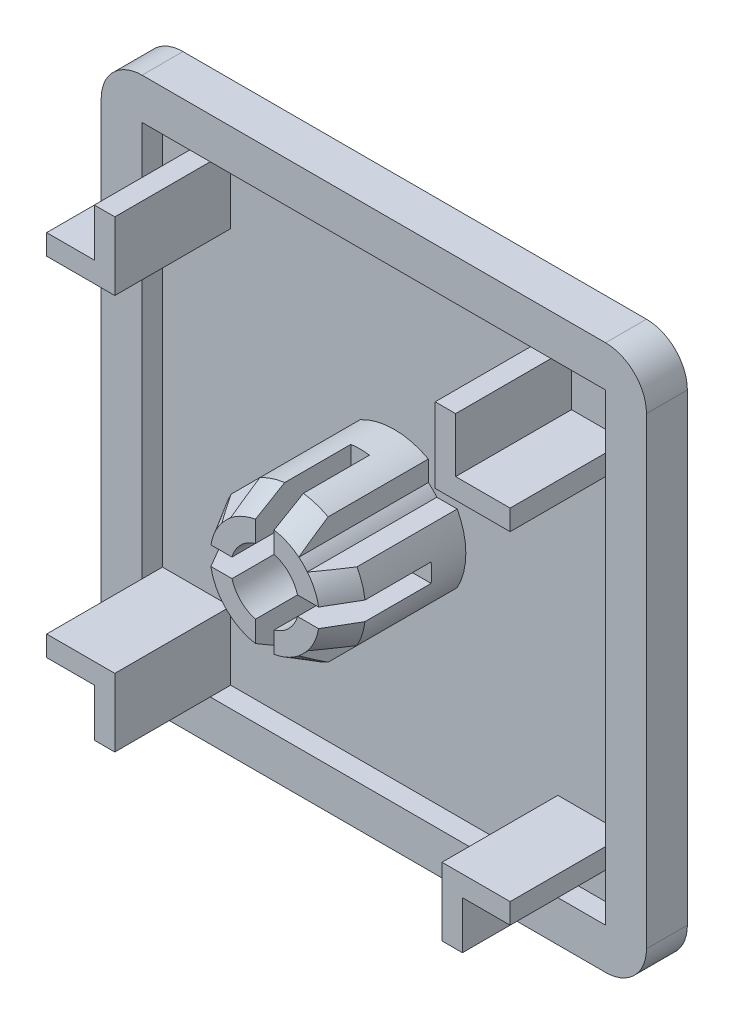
ISO-10303-21;
HEADER;
FILE_DESCRIPTION(('STEP AP214'),'2;1');
FILE_NAME('part.step','',(''),(''),'','','');
FILE_SCHEMA(('AUTOMOTIVE_DESIGN { 1 0 10303 214 1 1 1 1 }'));
ENDSEC;
DATA;
#1=APPLICATION_CONTEXT('core data for automotive mechanical design processes');
#2=APPLICATION_PROTOCOL_DEFINITION('international standard','automotive_design',2000,#1);
#3=PRODUCT_CONTEXT('',#1,'mechanical');
#4=PRODUCT('Part','Part','',(#3));
#5=PRODUCT_RELATED_PRODUCT_CATEGORY('part','',(#4));
#6=PRODUCT_DEFINITION_FORMATION('','',#4);
#7=PRODUCT_DEFINITION_CONTEXT('part definition',#1,'design');
#8=PRODUCT_DEFINITION('design','',#6,#7);
#9=PRODUCT_DEFINITION_SHAPE('','',#8);
#10=(LENGTH_UNIT() NAMED_UNIT(*) SI_UNIT(.MILLI.,.METRE.));
#11=(NAMED_UNIT(*) PLANE_ANGLE_UNIT() SI_UNIT($,.RADIAN.));
#12=(NAMED_UNIT(*) SI_UNIT($,.STERADIAN.) SOLID_ANGLE_UNIT());
#13=UNCERTAINTY_MEASURE_WITH_UNIT(LENGTH_MEASURE(1.E-05),#10,'distance_accuracy_value','');
#14=(GEOMETRIC_REPRESENTATION_CONTEXT(3) GLOBAL_UNCERTAINTY_ASSIGNED_CONTEXT((#13)) GLOBAL_UNIT_ASSIGNED_CONTEXT((#10,
#11,#12)) REPRESENTATION_CONTEXT('',''));
#15=CARTESIAN_POINT('',(0.,0.,0.));
#16=DIRECTION('',(0.,0.,1.));
#17=DIRECTION('',(1.,0.,0.));
#18=AXIS2_PLACEMENT_3D('',#15,#16,#17);
#19=CARTESIAN_POINT('',(0.,0.,8.));
#20=DIRECTION('',(0.,0.,-1.));
#21=DIRECTION('',(-1.,0.,0.));
#22=AXIS2_PLACEMENT_3D('',#19,#20,#21);
#23=CONICAL_SURFACE('',#22,4.0086969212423,0.523598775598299);
#24=CARTESIAN_POINT('',(0.,0.,5.85));
#25=DIRECTION('',(0.,0.,-1.));
#26=DIRECTION('',(-1.,0.,0.));
#27=AXIS2_PLACEMENT_3D('',#24,#25,#26);
#28=CIRCLE('',#27,5.25);
#29=CARTESIAN_POINT('',(-5.20512007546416,0.685,5.85));
#30=VERTEX_POINT('',#29);
#31=CARTESIAN_POINT('',(-4.61654632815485,2.5,5.85));
#32=VERTEX_POINT('',#31);
#33=EDGE_CURVE('E955',#30,#32,#28,.T.);
#34=ORIENTED_EDGE('',*,*,#33,.F.);
#35=CARTESIAN_POINT('',(-7.7694229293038,0.685,1.43403016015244));
#36=CARTESIAN_POINT('',(-7.54170440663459,0.685,1.82691912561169));
#37=CARTESIAN_POINT('',(-7.31393381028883,0.685,2.21977793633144));
#38=CARTESIAN_POINT('',(-6.85823921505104,0.685,3.00540592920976));
#39=CARTESIAN_POINT('',(-6.63031521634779,0.685,3.39817511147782));
#40=CARTESIAN_POINT('',(-6.17426620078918,0.685,4.18359170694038));
#41=CARTESIAN_POINT('',(-5.94614118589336,0.685,4.57623912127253));
#42=CARTESIAN_POINT('',(-5.48960584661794,0.685,5.36136880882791));
#43=CARTESIAN_POINT('',(-5.26119552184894,0.685,5.75385108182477));
#44=CARTESIAN_POINT('',(-4.80395524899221,0.685,6.53857883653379));
#45=CARTESIAN_POINT('',(-4.57512529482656,0.684999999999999,6.93082431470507));
#46=CARTESIAN_POINT('',(-4.11683008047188,0.684999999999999,7.71494262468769));
#47=CARTESIAN_POINT('',(-3.88736482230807,0.684999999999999,8.10681545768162));
#48=CARTESIAN_POINT('',(-3.5423638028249,0.684999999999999,8.69415676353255));
#49=CARTESIAN_POINT('',(-3.4272288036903,0.684999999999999,8.88986056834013));
#50=CARTESIAN_POINT('',(-3.19659346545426,0.684999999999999,9.28105238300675));
#51=CARTESIAN_POINT('',(-3.08109312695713,0.684999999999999,9.47654039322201));
#52=CARTESIAN_POINT('',(-2.84959654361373,0.684999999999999,9.86722590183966));
#53=CARTESIAN_POINT('',(-2.7336002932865,0.684999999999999,10.0624233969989));
#54=CARTESIAN_POINT('',(-2.50086058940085,0.684999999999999,10.4523737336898));
#55=CARTESIAN_POINT('',(-2.38411713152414,0.684999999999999,10.647126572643));
#56=CARTESIAN_POINT('',(-2.26687445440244,0.685,10.8415799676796));
#57=B_SPLINE_CURVE_WITH_KNOTS('',3,(#35,#36,#37,#38,#39,#40,#41,#42,#43,#44,#45,#46,#47,#48,#49,
#50,#51,#52,#53,#54,#55,#56),.UNSPECIFIED.,.F.,.F.,(4,2,2,2,2,2,2,2,2,2,4),(0.,1.362335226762,
2.72466878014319,4.08698919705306,5.44931147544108,6.81165364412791,8.17399147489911,
8.85516986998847,9.53634713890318,10.2175319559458,10.8987207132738),.UNSPECIFIED.);
#58=CARTESIAN_POINT('',(-3.94973746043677,0.685,8.));
#59=VERTEX_POINT('',#58);
#60=EDGE_CURVE('E637',#30,#59,#57,.T.);
#61=ORIENTED_EDGE('',*,*,#60,.T.);
#62=CARTESIAN_POINT('',(0.,0.,8.));
#63=DIRECTION('',(0.,0.,-1.));
#64=DIRECTION('',(-1.,0.,0.));
#65=AXIS2_PLACEMENT_3D('',#62,#63,#64);
#66=CIRCLE('',#65,4.0086969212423);
#67=CARTESIAN_POINT('',(-3.13363223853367,2.5,8.));
#68=VERTEX_POINT('',#67);
#69=EDGE_CURVE('E1032',#59,#68,#66,.T.);
#70=ORIENTED_EDGE('',*,*,#69,.T.);
#71=CARTESIAN_POINT('',(-1.20199647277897,2.5,10.1386453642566));
#72=CARTESIAN_POINT('',(-1.2454320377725,2.5,10.1060357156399));
#73=CARTESIAN_POINT('',(-1.28817761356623,2.5,10.0725299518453));
#74=CARTESIAN_POINT('',(-1.37240979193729,2.5,10.0039996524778));
#75=CARTESIAN_POINT('',(-1.41389684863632,2.5,9.9689756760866));
#76=CARTESIAN_POINT('',(-1.5365793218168,2.5,9.86210317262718));
#77=CARTESIAN_POINT('',(-1.61612151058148,2.5,9.78835775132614));
#78=CARTESIAN_POINT('',(-1.77137309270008,2.5,9.63751806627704));
#79=CARTESIAN_POINT('',(-1.8470950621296,2.5,9.56043658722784));
#80=CARTESIAN_POINT('',(-1.99572701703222,2.5,9.40355851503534));
#81=CARTESIAN_POINT('',(-2.06863580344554,2.5,9.32376079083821));
#82=CARTESIAN_POINT('',(-2.21171969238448,2.5,9.16258281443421));
#83=CARTESIAN_POINT('',(-2.28190815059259,2.5,9.08121436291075));
#84=CARTESIAN_POINT('',(-2.42038018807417,2.5,8.91689841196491));
#85=CARTESIAN_POINT('',(-2.48866404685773,2.5,8.83395114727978));
#86=CARTESIAN_POINT('',(-2.69130729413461,2.5,8.58304151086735));
#87=CARTESIAN_POINT('',(-2.82331228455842,2.5,8.4131789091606));
#88=CARTESIAN_POINT('',(-3.07774229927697,2.5,8.07681427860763));
#89=CARTESIAN_POINT('',(-3.20034000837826,2.5,7.91044160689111));
#90=CARTESIAN_POINT('',(-3.44236981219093,2.5,7.57550920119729));
#91=CARTESIAN_POINT('',(-3.56180307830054,2.5,7.40695031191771));
#92=CARTESIAN_POINT('',(-3.79858963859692,2.5,7.06769999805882));
#93=CARTESIAN_POINT('',(-3.91593638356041,2.5,6.89700401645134));
#94=CARTESIAN_POINT('',(-4.14873511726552,2.5,6.55429964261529));
#95=CARTESIAN_POINT('',(-4.26418689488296,2.5,6.38229110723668));
#96=CARTESIAN_POINT('',(-4.61180255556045,2.5,5.85944228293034));
#97=CARTESIAN_POINT('',(-4.84160003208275,2.5,5.50702982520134));
#98=CARTESIAN_POINT('',(-5.29702529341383,2.5,4.79953505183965));
#99=CARTESIAN_POINT('',(-5.52265307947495,2.5,4.44445273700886));
#100=CARTESIAN_POINT('',(-5.96952414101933,2.5,3.734699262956));
#101=CARTESIAN_POINT('',(-6.19078619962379,2.5,3.38003991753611));
#102=CARTESIAN_POINT('',(-6.52106293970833,2.5,2.84706763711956));
#103=CARTESIAN_POINT('',(-6.63088225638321,2.5,2.66925212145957));
#104=CARTESIAN_POINT('',(-6.85005070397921,2.5,2.31333266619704));
#105=CARTESIAN_POINT('',(-6.9593998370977,2.5,2.13522872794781));
#106=CARTESIAN_POINT('',(-7.06854746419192,2.5,1.95700131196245));
#107=B_SPLINE_CURVE_WITH_KNOTS('',3,(#71,#72,#73,#74,#75,#76,#77,#78,#79,#80,#81,#82,#83,#84,
#85,#86,#87,#88,#89,#90,#91,#92,#93,#94,#95,#96,#97,#98,#99,#100,#101,#102,#103,#104,#105,#106),
.UNSPECIFIED.,.F.,.F.,(4,2,2,2,2,2,2,2,2,2,2,2,2,2,2,2,2,4),(0.,0.162909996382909,
0.325760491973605,0.650987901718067,0.975063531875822,1.2992757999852,1.62161570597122,
1.94390805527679,2.58915925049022,3.2091118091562,3.82883157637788,4.45023881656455,
5.0717148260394,6.33380889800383,7.59590259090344,8.84994916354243,9.47693174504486,
10.1039113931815),.UNSPECIFIED.);
#108=EDGE_CURVE('E828',#68,#32,#107,.T.);
#109=ORIENTED_EDGE('',*,*,#108,.T.);
#110=EDGE_LOOP('',(#34,#61,#70,#109));
#111=FACE_BOUND('',#110,.T.);
#112=ADVANCED_FACE('F16',(#111),#23,.T.);
#113=CARTESIAN_POINT('',(-0.685,-5.20512007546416,5.85));
#114=VERTEX_POINT('',#113);
#115=CARTESIAN_POINT('',(-2.5,-4.61654632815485,5.85));
#116=VERTEX_POINT('',#115);
#117=EDGE_CURVE('E963',#114,#116,#28,.T.);
#118=ORIENTED_EDGE('',*,*,#117,.F.);
#119=CARTESIAN_POINT('',(-0.685,-7.7694229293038,1.43403016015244));
#120=CARTESIAN_POINT('',(-0.685,-7.54170440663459,1.82691912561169));
#121=CARTESIAN_POINT('',(-0.685,-7.31393381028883,2.21977793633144));
#122=CARTESIAN_POINT('',(-0.685,-6.85823921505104,3.00540592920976));
#123=CARTESIAN_POINT('',(-0.685,-6.63031521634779,3.39817511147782));
#124=CARTESIAN_POINT('',(-0.685,-6.17426620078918,4.18359170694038));
#125=CARTESIAN_POINT('',(-0.685,-5.94614118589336,4.57623912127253));
#126=CARTESIAN_POINT('',(-0.685,-5.48960584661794,5.36136880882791));
#127=CARTESIAN_POINT('',(-0.685,-5.26119552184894,5.75385108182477));
#128=CARTESIAN_POINT('',(-0.685,-4.80395524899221,6.53857883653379));
#129=CARTESIAN_POINT('',(-0.685,-4.57512529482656,6.93082431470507));
#130=CARTESIAN_POINT('',(-0.685,-4.11683008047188,7.71494262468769));
#131=CARTESIAN_POINT('',(-0.685,-3.88736482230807,8.10681545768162));
#132=CARTESIAN_POINT('',(-0.685,-3.5423638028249,8.69415676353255));
#133=CARTESIAN_POINT('',(-0.685,-3.4272288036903,8.88986056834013));
#134=CARTESIAN_POINT('',(-0.685,-3.19659346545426,9.28105238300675));
#135=CARTESIAN_POINT('',(-0.685,-3.08109312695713,9.47654039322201));
#136=CARTESIAN_POINT('',(-0.685,-2.84959654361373,9.86722590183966));
#137=CARTESIAN_POINT('',(-0.685,-2.7336002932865,10.0624233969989));
#138=CARTESIAN_POINT('',(-0.685,-2.50086058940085,10.4523737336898));
#139=CARTESIAN_POINT('',(-0.685,-2.38411713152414,10.647126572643));
#140=CARTESIAN_POINT('',(-0.685,-2.26687445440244,10.8415799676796));
#141=B_SPLINE_CURVE_WITH_KNOTS('',3,(#119,#120,#121,#122,#123,#124,#125,#126,#127,#128,#129,
#130,#131,#132,#133,#134,#135,#136,#137,#138,#139,#140),.UNSPECIFIED.,.F.,.F.,(4,2,2,2,2,2,2,2,
2,2,4),(0.,1.362335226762,2.72466878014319,4.08698919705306,5.44931147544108,6.81165364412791,
8.17399147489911,8.85516986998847,9.53634713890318,10.2175319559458,10.8987207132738),.UNSPECIFIED.);
#142=CARTESIAN_POINT('',(-0.685,-3.94973746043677,8.));
#143=VERTEX_POINT('',#142);
#144=EDGE_CURVE('E742',#114,#143,#141,.T.);
#145=ORIENTED_EDGE('',*,*,#144,.T.);
#146=CARTESIAN_POINT('',(-2.5,-3.13363223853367,8.));
#147=VERTEX_POINT('',#146);
#148=EDGE_CURVE('E1029',#143,#147,#66,.T.);
#149=ORIENTED_EDGE('',*,*,#148,.T.);
#150=CARTESIAN_POINT('',(-2.5,-1.20199647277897,10.1386453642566));
#151=CARTESIAN_POINT('',(-2.5,-1.2454320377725,10.1060357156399));
#152=CARTESIAN_POINT('',(-2.5,-1.28817761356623,10.0725299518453));
#153=CARTESIAN_POINT('',(-2.5,-1.3724097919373,10.0039996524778));
#154=CARTESIAN_POINT('',(-2.5,-1.41389684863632,9.9689756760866));
#155=CARTESIAN_POINT('',(-2.5,-1.5365793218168,9.86210317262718));
#156=CARTESIAN_POINT('',(-2.5,-1.61612151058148,9.78835775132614));
#157=CARTESIAN_POINT('',(-2.5,-1.77137309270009,9.63751806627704));
#158=CARTESIAN_POINT('',(-2.5,-1.8470950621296,9.56043658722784));
#159=CARTESIAN_POINT('',(-2.5,-1.99572701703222,9.40355851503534));
#160=CARTESIAN_POINT('',(-2.5,-2.06863580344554,9.32376079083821));
#161=CARTESIAN_POINT('',(-2.5,-2.21171969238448,9.16258281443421));
#162=CARTESIAN_POINT('',(-2.5,-2.28190815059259,9.08121436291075));
#163=CARTESIAN_POINT('',(-2.5,-2.42038018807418,8.91689841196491));
#164=CARTESIAN_POINT('',(-2.5,-2.48866404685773,8.83395114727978));
#165=CARTESIAN_POINT('',(-2.5,-2.69130729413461,8.58304151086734));
#166=CARTESIAN_POINT('',(-2.5,-2.82331228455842,8.4131789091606));
#167=CARTESIAN_POINT('',(-2.5,-3.07774229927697,8.07681427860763));
#168=CARTESIAN_POINT('',(-2.5,-3.20034000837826,7.91044160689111));
#169=CARTESIAN_POINT('',(-2.5,-3.44236981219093,7.57550920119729));
#170=CARTESIAN_POINT('',(-2.5,-3.56180307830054,7.40695031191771));
#171=CARTESIAN_POINT('',(-2.5,-3.79858963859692,7.06769999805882));
#172=CARTESIAN_POINT('',(-2.5,-3.91593638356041,6.89700401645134));
#173=CARTESIAN_POINT('',(-2.5,-4.14873511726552,6.55429964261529));
#174=CARTESIAN_POINT('',(-2.5,-4.26418689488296,6.38229110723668));
#175=CARTESIAN_POINT('',(-2.5,-4.61180255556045,5.85944228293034));
#176=CARTESIAN_POINT('',(-2.5,-4.84160003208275,5.50702982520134));
#177=CARTESIAN_POINT('',(-2.5,-5.29702529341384,4.79953505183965));
#178=CARTESIAN_POINT('',(-2.5,-5.52265307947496,4.44445273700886));
#179=CARTESIAN_POINT('',(-2.5,-5.96952414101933,3.734699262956));
#180=CARTESIAN_POINT('',(-2.5,-6.19078619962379,3.38003991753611));
#181=CARTESIAN_POINT('',(-2.5,-6.52106293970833,2.84706763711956));
#182=CARTESIAN_POINT('',(-2.5,-6.63088225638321,2.66925212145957));
#183=CARTESIAN_POINT('',(-2.5,-6.85005070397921,2.31333266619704));
#184=CARTESIAN_POINT('',(-2.5,-6.9593998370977,2.1352287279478));
#185=CARTESIAN_POINT('',(-2.5,-7.06854746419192,1.95700131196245));
#186=B_SPLINE_CURVE_WITH_KNOTS('',3,(#150,#151,#152,#153,#154,#155,#156,#157,#158,#159,#160,
#161,#162,#163,#164,#165,#166,#167,#168,#169,#170,#171,#172,#173,#174,#175,#176,#177,#178,#179,
#180,#181,#182,#183,#184,#185),.UNSPECIFIED.,.F.,.F.,(4,2,2,2,2,2,2,2,2,2,2,2,2,2,2,2,2,4),(0.,
0.162909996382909,0.325760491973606,0.650987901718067,0.975063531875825,1.2992757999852,
1.62161570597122,1.94390805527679,2.58915925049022,3.2091118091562,3.82883157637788,
4.45023881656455,5.0717148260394,6.33380889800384,7.59590259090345,8.84994916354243,
9.47693174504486,10.1039113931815),.UNSPECIFIED.);
#187=EDGE_CURVE('E565',#147,#116,#186,.T.);
#188=ORIENTED_EDGE('',*,*,#187,.T.);
#189=EDGE_LOOP('',(#118,#145,#149,#188));
#190=FACE_BOUND('',#189,.T.);
#191=ADVANCED_FACE('F946',(#190),#23,.T.);
#192=CARTESIAN_POINT('',(5.20512007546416,-0.685,5.85));
#193=VERTEX_POINT('',#192);
#194=CARTESIAN_POINT('',(4.61654632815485,-2.5,5.85));
#195=VERTEX_POINT('',#194);
#196=EDGE_CURVE('E973',#193,#195,#28,.T.);
#197=ORIENTED_EDGE('',*,*,#196,.F.);
#198=CARTESIAN_POINT('',(7.7694229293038,-0.685,1.43403016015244));
#199=CARTESIAN_POINT('',(7.54170440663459,-0.685,1.82691912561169));
#200=CARTESIAN_POINT('',(7.31393381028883,-0.685,2.21977793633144));
#201=CARTESIAN_POINT('',(6.85823921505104,-0.685,3.00540592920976));
#202=CARTESIAN_POINT('',(6.63031521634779,-0.685,3.39817511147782));
#203=CARTESIAN_POINT('',(6.17426620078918,-0.685,4.18359170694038));
#204=CARTESIAN_POINT('',(5.94614118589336,-0.685,4.57623912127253));
#205=CARTESIAN_POINT('',(5.48960584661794,-0.685,5.36136880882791));
#206=CARTESIAN_POINT('',(5.26119552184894,-0.685,5.75385108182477));
#207=CARTESIAN_POINT('',(4.80395524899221,-0.685,6.53857883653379));
#208=CARTESIAN_POINT('',(4.57512529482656,-0.685,6.93082431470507));
#209=CARTESIAN_POINT('',(4.11683008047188,-0.685,7.71494262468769));
#210=CARTESIAN_POINT('',(3.88736482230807,-0.685,8.10681545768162));
#211=CARTESIAN_POINT('',(3.5423638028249,-0.685,8.69415676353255));
#212=CARTESIAN_POINT('',(3.4272288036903,-0.685,8.88986056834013));
#213=CARTESIAN_POINT('',(3.19659346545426,-0.685,9.28105238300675));
#214=CARTESIAN_POINT('',(3.08109312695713,-0.685,9.47654039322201));
#215=CARTESIAN_POINT('',(2.84959654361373,-0.685,9.86722590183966));
#216=CARTESIAN_POINT('',(2.7336002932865,-0.685,10.0624233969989));
#217=CARTESIAN_POINT('',(2.50086058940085,-0.685,10.4523737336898));
#218=CARTESIAN_POINT('',(2.38411713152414,-0.685,10.647126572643));
#219=CARTESIAN_POINT('',(2.26687445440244,-0.685,10.8415799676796));
#220=B_SPLINE_CURVE_WITH_KNOTS('',3,(#198,#199,#200,#201,#202,#203,#204,#205,#206,#207,#208,
#209,#210,#211,#212,#213,#214,#215,#216,#217,#218,#219),.UNSPECIFIED.,.F.,.F.,(4,2,2,2,2,2,2,2,
2,2,4),(0.,1.362335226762,2.72466878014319,4.08698919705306,5.44931147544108,6.81165364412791,
8.17399147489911,8.85516986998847,9.53634713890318,10.2175319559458,10.8987207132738),.UNSPECIFIED.);
#221=CARTESIAN_POINT('',(3.94973746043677,-0.685,8.));
#222=VERTEX_POINT('',#221);
#223=EDGE_CURVE('E707',#193,#222,#220,.T.);
#224=ORIENTED_EDGE('',*,*,#223,.T.);
#225=CARTESIAN_POINT('',(3.13363223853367,-2.5,8.));
#226=VERTEX_POINT('',#225);
#227=EDGE_CURVE('E1026',#222,#226,#66,.T.);
#228=ORIENTED_EDGE('',*,*,#227,.T.);
#229=CARTESIAN_POINT('',(1.20199647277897,-2.5,10.1386453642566));
#230=CARTESIAN_POINT('',(1.2454320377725,-2.5,10.1060357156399));
#231=CARTESIAN_POINT('',(1.28817761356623,-2.5,10.0725299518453));
#232=CARTESIAN_POINT('',(1.3724097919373,-2.5,10.0039996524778));
#233=CARTESIAN_POINT('',(1.41389684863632,-2.5,9.9689756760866));
#234=CARTESIAN_POINT('',(1.5365793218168,-2.5,9.86210317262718));
#235=CARTESIAN_POINT('',(1.61612151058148,-2.5,9.78835775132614));
#236=CARTESIAN_POINT('',(1.77137309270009,-2.5,9.63751806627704));
#237=CARTESIAN_POINT('',(1.8470950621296,-2.5,9.56043658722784));
#238=CARTESIAN_POINT('',(1.99572701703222,-2.5,9.40355851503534));
#239=CARTESIAN_POINT('',(2.06863580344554,-2.5,9.32376079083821));
#240=CARTESIAN_POINT('',(2.21171969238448,-2.5,9.16258281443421));
#241=CARTESIAN_POINT('',(2.28190815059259,-2.5,9.08121436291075));
#242=CARTESIAN_POINT('',(2.42038018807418,-2.5,8.91689841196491));
#243=CARTESIAN_POINT('',(2.48866404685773,-2.5,8.83395114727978));
#244=CARTESIAN_POINT('',(2.69130729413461,-2.5,8.58304151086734));
#245=CARTESIAN_POINT('',(2.82331228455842,-2.5,8.4131789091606));
#246=CARTESIAN_POINT('',(3.07774229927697,-2.5,8.07681427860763));
#247=CARTESIAN_POINT('',(3.20034000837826,-2.5,7.91044160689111));
#248=CARTESIAN_POINT('',(3.44236981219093,-2.5,7.57550920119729));
#249=CARTESIAN_POINT('',(3.56180307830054,-2.5,7.40695031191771));
#250=CARTESIAN_POINT('',(3.79858963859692,-2.5,7.06769999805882));
#251=CARTESIAN_POINT('',(3.91593638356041,-2.5,6.89700401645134));
#252=CARTESIAN_POINT('',(4.14873511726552,-2.5,6.55429964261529));
#253=CARTESIAN_POINT('',(4.26418689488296,-2.5,6.38229110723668));
#254=CARTESIAN_POINT('',(4.61180255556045,-2.5,5.85944228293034));
#255=CARTESIAN_POINT('',(4.84160003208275,-2.5,5.50702982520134));
#256=CARTESIAN_POINT('',(5.29702529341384,-2.5,4.79953505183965));
#257=CARTESIAN_POINT('',(5.52265307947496,-2.5,4.44445273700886));
#258=CARTESIAN_POINT('',(5.96952414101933,-2.5,3.734699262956));
#259=CARTESIAN_POINT('',(6.19078619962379,-2.5,3.38003991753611));
#260=CARTESIAN_POINT('',(6.52106293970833,-2.5,2.84706763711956));
#261=CARTESIAN_POINT('',(6.63088225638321,-2.5,2.66925212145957));
#262=CARTESIAN_POINT('',(6.85005070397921,-2.5,2.31333266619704));
#263=CARTESIAN_POINT('',(6.9593998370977,-2.5,2.1352287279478));
#264=CARTESIAN_POINT('',(7.06854746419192,-2.5,1.95700131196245));
#265=B_SPLINE_CURVE_WITH_KNOTS('',3,(#229,#230,#231,#232,#233,#234,#235,#236,#237,#238,#239,
#240,#241,#242,#243,#244,#245,#246,#247,#248,#249,#250,#251,#252,#253,#254,#255,#256,#257,#258,
#259,#260,#261,#262,#263,#264),.UNSPECIFIED.,.F.,.F.,(4,2,2,2,2,2,2,2,2,2,2,2,2,2,2,2,2,4),(0.,
0.162909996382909,0.325760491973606,0.650987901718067,0.975063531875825,1.2992757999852,
1.62161570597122,1.94390805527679,2.58915925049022,3.2091118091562,3.82883157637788,
4.45023881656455,5.0717148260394,6.33380889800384,7.59590259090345,8.84994916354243,
9.47693174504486,10.1039113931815),.UNSPECIFIED.);
#266=EDGE_CURVE('E879',#226,#195,#265,.T.);
#267=ORIENTED_EDGE('',*,*,#266,.T.);
#268=EDGE_LOOP('',(#197,#224,#228,#267));
#269=FACE_BOUND('',#268,.T.);
#270=ADVANCED_FACE('F952',(#269),#23,.T.);
#271=CARTESIAN_POINT('',(0.685,5.20512007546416,5.85));
#272=VERTEX_POINT('',#271);
#273=CARTESIAN_POINT('',(2.5,4.61654632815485,5.85));
#274=VERTEX_POINT('',#273);
#275=EDGE_CURVE('E979',#272,#274,#28,.T.);
#276=ORIENTED_EDGE('',*,*,#275,.F.);
#277=CARTESIAN_POINT('',(0.685,7.7694229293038,1.43403016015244));
#278=CARTESIAN_POINT('',(0.685,7.54170440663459,1.82691912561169));
#279=CARTESIAN_POINT('',(0.685,7.31393381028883,2.21977793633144));
#280=CARTESIAN_POINT('',(0.685,6.85823921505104,3.00540592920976));
#281=CARTESIAN_POINT('',(0.685,6.63031521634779,3.39817511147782));
#282=CARTESIAN_POINT('',(0.685,6.17426620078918,4.18359170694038));
#283=CARTESIAN_POINT('',(0.685,5.94614118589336,4.57623912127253));
#284=CARTESIAN_POINT('',(0.685,5.48960584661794,5.36136880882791));
#285=CARTESIAN_POINT('',(0.685,5.26119552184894,5.75385108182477));
#286=CARTESIAN_POINT('',(0.685,4.80395524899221,6.53857883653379));
#287=CARTESIAN_POINT('',(0.685,4.57512529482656,6.93082431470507));
#288=CARTESIAN_POINT('',(0.684999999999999,4.11683008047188,7.71494262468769));
#289=CARTESIAN_POINT('',(0.684999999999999,3.88736482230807,8.10681545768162));
#290=CARTESIAN_POINT('',(0.684999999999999,3.5423638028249,8.69415676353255));
#291=CARTESIAN_POINT('',(0.684999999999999,3.4272288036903,8.88986056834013));
#292=CARTESIAN_POINT('',(0.684999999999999,3.19659346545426,9.28105238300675));
#293=CARTESIAN_POINT('',(0.684999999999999,3.08109312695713,9.47654039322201));
#294=CARTESIAN_POINT('',(0.684999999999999,2.84959654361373,9.86722590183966));
#295=CARTESIAN_POINT('',(0.684999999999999,2.7336002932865,10.0624233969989));
#296=CARTESIAN_POINT('',(0.684999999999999,2.50086058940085,10.4523737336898));
#297=CARTESIAN_POINT('',(0.685,2.38411713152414,10.647126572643));
#298=CARTESIAN_POINT('',(0.685,2.26687445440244,10.8415799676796));
#299=B_SPLINE_CURVE_WITH_KNOTS('',3,(#277,#278,#279,#280,#281,#282,#283,#284,#285,#286,#287,
#288,#289,#290,#291,#292,#293,#294,#295,#296,#297,#298),.UNSPECIFIED.,.F.,.F.,(4,2,2,2,2,2,2,2,
2,2,4),(0.,1.362335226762,2.72466878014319,4.08698919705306,5.44931147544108,6.81165364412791,
8.17399147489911,8.85516986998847,9.53634713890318,10.2175319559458,10.8987207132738),.UNSPECIFIED.);
#300=CARTESIAN_POINT('',(0.685,3.94973746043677,8.));
#301=VERTEX_POINT('',#300);
#302=EDGE_CURVE('E668',#272,#301,#299,.T.);
#303=ORIENTED_EDGE('',*,*,#302,.T.);
#304=CARTESIAN_POINT('',(2.5,3.13363223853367,8.));
#305=VERTEX_POINT('',#304);
#306=EDGE_CURVE('E967',#301,#305,#66,.T.);
#307=ORIENTED_EDGE('',*,*,#306,.T.);
#308=CARTESIAN_POINT('',(2.5,1.20199647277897,10.1386453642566));
#309=CARTESIAN_POINT('',(2.5,1.2454320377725,10.1060357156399));
#310=CARTESIAN_POINT('',(2.5,1.28817761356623,10.0725299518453));
#311=CARTESIAN_POINT('',(2.5,1.3724097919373,10.0039996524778));
#312=CARTESIAN_POINT('',(2.5,1.41389684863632,9.9689756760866));
#313=CARTESIAN_POINT('',(2.5,1.5365793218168,9.86210317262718));
#314=CARTESIAN_POINT('',(2.5,1.61612151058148,9.78835775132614));
#315=CARTESIAN_POINT('',(2.5,1.77137309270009,9.63751806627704));
#316=CARTESIAN_POINT('',(2.5,1.8470950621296,9.56043658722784));
#317=CARTESIAN_POINT('',(2.5,1.99572701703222,9.40355851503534));
#318=CARTESIAN_POINT('',(2.5,2.06863580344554,9.32376079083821));
#319=CARTESIAN_POINT('',(2.5,2.21171969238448,9.16258281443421));
#320=CARTESIAN_POINT('',(2.5,2.28190815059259,9.08121436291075));
#321=CARTESIAN_POINT('',(2.5,2.42038018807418,8.91689841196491));
#322=CARTESIAN_POINT('',(2.5,2.48866404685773,8.83395114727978));
#323=CARTESIAN_POINT('',(2.5,2.69130729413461,8.58304151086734));
#324=CARTESIAN_POINT('',(2.5,2.82331228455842,8.4131789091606));
#325=CARTESIAN_POINT('',(2.5,3.07774229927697,8.07681427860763));
#326=CARTESIAN_POINT('',(2.5,3.20034000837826,7.91044160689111));
#327=CARTESIAN_POINT('',(2.5,3.44236981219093,7.57550920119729));
#328=CARTESIAN_POINT('',(2.5,3.56180307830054,7.40695031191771));
#329=CARTESIAN_POINT('',(2.5,3.79858963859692,7.06769999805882));
#330=CARTESIAN_POINT('',(2.5,3.91593638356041,6.89700401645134));
#331=CARTESIAN_POINT('',(2.5,4.14873511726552,6.55429964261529));
#332=CARTESIAN_POINT('',(2.5,4.26418689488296,6.38229110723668));
#333=CARTESIAN_POINT('',(2.5,4.61180255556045,5.85944228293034));
#334=CARTESIAN_POINT('',(2.5,4.84160003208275,5.50702982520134));
#335=CARTESIAN_POINT('',(2.5,5.29702529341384,4.79953505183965));
#336=CARTESIAN_POINT('',(2.5,5.52265307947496,4.44445273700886));
#337=CARTESIAN_POINT('',(2.5,5.96952414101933,3.734699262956));
#338=CARTESIAN_POINT('',(2.5,6.19078619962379,3.38003991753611));
#339=CARTESIAN_POINT('',(2.5,6.52106293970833,2.84706763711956));
#340=CARTESIAN_POINT('',(2.5,6.63088225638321,2.66925212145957));
#341=CARTESIAN_POINT('',(2.5,6.85005070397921,2.31333266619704));
#342=CARTESIAN_POINT('',(2.5,6.9593998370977,2.1352287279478));
#343=CARTESIAN_POINT('',(2.5,7.06854746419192,1.95700131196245));
#344=B_SPLINE_CURVE_WITH_KNOTS('',3,(#308,#309,#310,#311,#312,#313,#314,#315,#316,#317,#318,
#319,#320,#321,#322,#323,#324,#325,#326,#327,#328,#329,#330,#331,#332,#333,#334,#335,#336,#337,
#338,#339,#340,#341,#342,#343),.UNSPECIFIED.,.F.,.F.,(4,2,2,2,2,2,2,2,2,2,2,2,2,2,2,2,2,4),(0.,
0.162909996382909,0.325760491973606,0.650987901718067,0.975063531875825,1.2992757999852,
1.62161570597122,1.94390805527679,2.58915925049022,3.2091118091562,3.82883157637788,
4.45023881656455,5.0717148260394,6.33380889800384,7.59590259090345,8.84994916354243,
9.47693174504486,10.1039113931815),.UNSPECIFIED.);
#345=EDGE_CURVE('E843',#305,#274,#344,.T.);
#346=ORIENTED_EDGE('',*,*,#345,.T.);
#347=EDGE_LOOP('',(#276,#303,#307,#346));
#348=FACE_BOUND('',#347,.T.);
#349=ADVANCED_FACE('F941',(#348),#23,.T.);
#350=CARTESIAN_POINT('',(4.0086969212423,0.,8.));
#351=DIRECTION('',(0.,0.,-1.));
#352=DIRECTION('',(-1.,0.,0.));
#353=AXIS2_PLACEMENT_3D('',#350,#351,#352);
#354=PLANE('',#353);
#355=ORIENTED_EDGE('',*,*,#148,.F.);
#356=DIRECTION('',(0.,1.,0.));
#357=VECTOR('',#356,1.);
#358=CARTESIAN_POINT('',(-0.685,0.,8.));
#359=LINE('',#358,#357);
#360=CARTESIAN_POINT('',(-0.685,-2.40432422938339,8.));
#361=VERTEX_POINT('',#360);
#362=EDGE_CURVE('E751',#143,#361,#359,.T.);
#363=ORIENTED_EDGE('',*,*,#362,.T.);
#364=CARTESIAN_POINT('',(0.,0.,8.));
#365=DIRECTION('',(0.,0.,-1.));
#366=DIRECTION('',(-1.,0.,0.));
#367=AXIS2_PLACEMENT_3D('',#364,#365,#366);
#368=CIRCLE('',#367,2.5);
#369=CARTESIAN_POINT('',(-2.40432422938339,-0.685,8.));
#370=VERTEX_POINT('',#369);
#371=EDGE_CURVE('E569',#361,#370,#368,.T.);
#372=ORIENTED_EDGE('',*,*,#371,.T.);
#373=DIRECTION('',(-1.,0.,0.));
#374=VECTOR('',#373,1.);
#375=CARTESIAN_POINT('',(4.0086969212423,-0.685,8.));
#376=LINE('',#375,#374);
#377=CARTESIAN_POINT('',(-3.94973746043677,-0.685,8.));
#378=VERTEX_POINT('',#377);
#379=EDGE_CURVE('E31',#370,#378,#376,.T.);
#380=ORIENTED_EDGE('',*,*,#379,.T.);
#381=CARTESIAN_POINT('',(-3.13363223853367,-2.5,8.));
#382=VERTEX_POINT('',#381);
#383=EDGE_CURVE('E969',#382,#378,#66,.T.);
#384=ORIENTED_EDGE('',*,*,#383,.F.);
#385=DIRECTION('',(1.,0.,0.));
#386=VECTOR('',#385,1.);
#387=CARTESIAN_POINT('',(4.0086969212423,-2.5,8.));
#388=LINE('',#387,#386);
#389=CARTESIAN_POINT('',(-3.1224989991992,-2.5,8.));
#390=VERTEX_POINT('',#389);
#391=EDGE_CURVE('E11',#382,#390,#388,.T.);
#392=ORIENTED_EDGE('',*,*,#391,.T.);
#393=CARTESIAN_POINT('',(0.,0.,8.));
#394=DIRECTION('',(0.,0.,-1.));
#395=DIRECTION('',(-1.,0.,0.));
#396=AXIS2_PLACEMENT_3D('',#393,#394,#395);
#397=CIRCLE('',#396,4.);
#398=CARTESIAN_POINT('',(-2.5,-3.1224989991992,8.));
#399=VERTEX_POINT('',#398);
#400=EDGE_CURVE('E24',#390,#399,#397,.F.);
#401=ORIENTED_EDGE('',*,*,#400,.T.);
#402=DIRECTION('',(0.,-1.,0.));
#403=VECTOR('',#402,1.);
#404=CARTESIAN_POINT('',(-2.5,0.,8.));
#405=LINE('',#404,#403);
#406=EDGE_CURVE('E1064',#399,#147,#405,.T.);
#407=ORIENTED_EDGE('',*,*,#406,.T.);
#408=EDGE_LOOP('',(#355,#363,#372,#380,#384,#392,#401,#407));
#409=FACE_BOUND('',#408,.T.);
#410=ADVANCED_FACE('F928',(#409),#354,.F.);
#411=CARTESIAN_POINT('',(2.40432422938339,-0.685,8.));
#412=VERTEX_POINT('',#411);
#413=CARTESIAN_POINT('',(0.685,-2.40432422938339,8.));
#414=VERTEX_POINT('',#413);
#415=EDGE_CURVE('E574',#412,#414,#368,.T.);
#416=ORIENTED_EDGE('',*,*,#415,.T.);
#417=DIRECTION('',(0.,-1.,0.));
#418=VECTOR('',#417,1.);
#419=CARTESIAN_POINT('',(0.685,0.,8.));
#420=LINE('',#419,#418);
#421=CARTESIAN_POINT('',(0.685,-3.94973746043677,8.));
#422=VERTEX_POINT('',#421);
#423=EDGE_CURVE('E39',#414,#422,#420,.T.);
#424=ORIENTED_EDGE('',*,*,#423,.T.);
#425=CARTESIAN_POINT('',(2.5,-3.13363223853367,8.));
#426=VERTEX_POINT('',#425);
#427=EDGE_CURVE('E1028',#426,#422,#66,.T.);
#428=ORIENTED_EDGE('',*,*,#427,.F.);
#429=DIRECTION('',(0.,1.,0.));
#430=VECTOR('',#429,1.);
#431=CARTESIAN_POINT('',(2.5,0.,8.));
#432=LINE('',#431,#430);
#433=CARTESIAN_POINT('',(2.5,-3.1224989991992,8.));
#434=VERTEX_POINT('',#433);
#435=EDGE_CURVE('E1067',#426,#434,#432,.T.);
#436=ORIENTED_EDGE('',*,*,#435,.T.);
#437=CARTESIAN_POINT('',(0.,0.,8.));
#438=DIRECTION('',(0.,0.,-1.));
#439=DIRECTION('',(-1.,0.,0.));
#440=AXIS2_PLACEMENT_3D('',#437,#438,#439);
#441=CIRCLE('',#440,4.);
#442=CARTESIAN_POINT('',(3.1224989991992,-2.5,8.));
#443=VERTEX_POINT('',#442);
#444=EDGE_CURVE('E1070',#434,#443,#441,.F.);
#445=ORIENTED_EDGE('',*,*,#444,.T.);
#446=DIRECTION('',(1.,0.,0.));
#447=VECTOR('',#446,1.);
#448=CARTESIAN_POINT('',(4.0086969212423,-2.5,8.));
#449=LINE('',#448,#447);
#450=EDGE_CURVE('E1075',#443,#226,#449,.T.);
#451=ORIENTED_EDGE('',*,*,#450,.T.);
#452=ORIENTED_EDGE('',*,*,#227,.F.);
#453=DIRECTION('',(-1.,0.,0.));
#454=VECTOR('',#453,1.);
#455=CARTESIAN_POINT('',(4.0086969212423,-0.685,8.));
#456=LINE('',#455,#454);
#457=EDGE_CURVE('E704',#222,#412,#456,.T.);
#458=ORIENTED_EDGE('',*,*,#457,.T.);
#459=EDGE_LOOP('',(#416,#424,#428,#436,#445,#451,#452,#458));
#460=FACE_BOUND('',#459,.T.);
#461=ADVANCED_FACE('F940',(#460),#354,.F.);
#462=CARTESIAN_POINT('',(0.685,2.40432422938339,8.));
#463=VERTEX_POINT('',#462);
#464=CARTESIAN_POINT('',(2.40432422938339,0.685,8.));
#465=VERTEX_POINT('',#464);
#466=EDGE_CURVE('E1040',#463,#465,#368,.T.);
#467=ORIENTED_EDGE('',*,*,#466,.T.);
#468=DIRECTION('',(1.,0.,0.));
#469=VECTOR('',#468,1.);
#470=CARTESIAN_POINT('',(4.0086969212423,0.685,8.));
#471=LINE('',#470,#469);
#472=CARTESIAN_POINT('',(3.94973746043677,0.685,8.));
#473=VERTEX_POINT('',#472);
#474=EDGE_CURVE('E699',#465,#473,#471,.T.);
#475=ORIENTED_EDGE('',*,*,#474,.T.);
#476=CARTESIAN_POINT('',(3.13363223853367,2.5,8.));
#477=VERTEX_POINT('',#476);
#478=EDGE_CURVE('E970',#477,#473,#66,.T.);
#479=ORIENTED_EDGE('',*,*,#478,.F.);
#480=DIRECTION('',(-1.,0.,0.));
#481=VECTOR('',#480,1.);
#482=CARTESIAN_POINT('',(4.0086969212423,2.5,8.));
#483=LINE('',#482,#481);
#484=CARTESIAN_POINT('',(3.1224989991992,2.5,8.));
#485=VERTEX_POINT('',#484);
#486=EDGE_CURVE('E1077',#477,#485,#483,.T.);
#487=ORIENTED_EDGE('',*,*,#486,.T.);
#488=CARTESIAN_POINT('',(0.,0.,8.));
#489=DIRECTION('',(0.,0.,-1.));
#490=DIRECTION('',(-1.,0.,0.));
#491=AXIS2_PLACEMENT_3D('',#488,#489,#490);
#492=CIRCLE('',#491,4.);
#493=CARTESIAN_POINT('',(2.5,3.1224989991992,8.));
#494=VERTEX_POINT('',#493);
#495=EDGE_CURVE('E1080',#485,#494,#492,.F.);
#496=ORIENTED_EDGE('',*,*,#495,.T.);
#497=DIRECTION('',(0.,1.,0.));
#498=VECTOR('',#497,1.);
#499=CARTESIAN_POINT('',(2.5,0.,8.));
#500=LINE('',#499,#498);
#501=EDGE_CURVE('E1083',#494,#305,#500,.T.);
#502=ORIENTED_EDGE('',*,*,#501,.T.);
#503=ORIENTED_EDGE('',*,*,#306,.F.);
#504=DIRECTION('',(0.,-1.,0.));
#505=VECTOR('',#504,1.);
#506=CARTESIAN_POINT('',(0.685,0.,8.));
#507=LINE('',#506,#505);
#508=EDGE_CURVE('E665',#301,#463,#507,.T.);
#509=ORIENTED_EDGE('',*,*,#508,.T.);
#510=EDGE_LOOP('',(#467,#475,#479,#487,#496,#502,#503,#509));
#511=FACE_BOUND('',#510,.T.);
#512=ADVANCED_FACE('F929',(#511),#354,.F.);
#513=CARTESIAN_POINT('',(0.,0.,8.));
#514=DIRECTION('',(0.,0.,-1.));
#515=DIRECTION('',(-1.,0.,0.));
#516=AXIS2_PLACEMENT_3D('',#513,#514,#515);
#517=CYLINDRICAL_SURFACE('',#516,2.5);
#518=ORIENTED_EDGE('',*,*,#371,.F.);
#519=DIRECTION('',(0.,0.,-1.));
#520=VECTOR('',#519,1.);
#521=CARTESIAN_POINT('',(-0.685,-2.40432422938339,8.));
#522=LINE('',#521,#520);
#523=CARTESIAN_POINT('',(-0.685,-2.40432422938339,1.));
#524=VERTEX_POINT('',#523);
#525=EDGE_CURVE('E557',#361,#524,#522,.T.);
#526=ORIENTED_EDGE('',*,*,#525,.T.);
#527=CARTESIAN_POINT('',(0.,0.,1.));
#528=DIRECTION('',(0.,0.,-1.));
#529=DIRECTION('',(-1.,0.,0.));
#530=AXIS2_PLACEMENT_3D('',#527,#528,#529);
#531=CIRCLE('',#530,2.5);
#532=CARTESIAN_POINT('',(-2.40432422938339,-0.685,1.));
#533=VERTEX_POINT('',#532);
#534=EDGE_CURVE('E549',#524,#533,#531,.T.);
#535=ORIENTED_EDGE('',*,*,#534,.T.);
#536=DIRECTION('',(0.,0.,-1.));
#537=VECTOR('',#536,1.);
#538=CARTESIAN_POINT('',(-2.40432422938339,-0.685,8.));
#539=LINE('',#538,#537);
#540=EDGE_CURVE('E535',#533,#370,#539,.F.);
#541=ORIENTED_EDGE('',*,*,#540,.T.);
#542=EDGE_LOOP('',(#518,#526,#535,#541));
#543=FACE_BOUND('',#542,.T.);
#544=ADVANCED_FACE('F556',(#543),#517,.F.);
#545=CARTESIAN_POINT('',(2.40432422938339,-0.685,1.));
#546=VERTEX_POINT('',#545);
#547=CARTESIAN_POINT('',(0.685,-2.40432422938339,1.));
#548=VERTEX_POINT('',#547);
#549=EDGE_CURVE('E558',#546,#548,#531,.T.);
#550=ORIENTED_EDGE('',*,*,#549,.T.);
#551=DIRECTION('',(0.,0.,-1.));
#552=VECTOR('',#551,1.);
#553=CARTESIAN_POINT('',(0.685,-2.40432422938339,8.));
#554=LINE('',#553,#552);
#555=EDGE_CURVE('E717',#548,#414,#554,.F.);
#556=ORIENTED_EDGE('',*,*,#555,.T.);
#557=ORIENTED_EDGE('',*,*,#415,.F.);
#558=DIRECTION('',(0.,0.,-1.));
#559=VECTOR('',#558,1.);
#560=CARTESIAN_POINT('',(2.40432422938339,-0.685,8.));
#561=LINE('',#560,#559);
#562=EDGE_CURVE('E701',#412,#546,#561,.T.);
#563=ORIENTED_EDGE('',*,*,#562,.T.);
#564=EDGE_LOOP('',(#550,#556,#557,#563));
#565=FACE_BOUND('',#564,.T.);
#566=ADVANCED_FACE('F1048',(#565),#517,.F.);
#567=CARTESIAN_POINT('',(0.685,2.40432422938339,1.));
#568=VERTEX_POINT('',#567);
#569=CARTESIAN_POINT('',(2.40432422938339,0.685,1.));
#570=VERTEX_POINT('',#569);
#571=EDGE_CURVE('E563',#568,#570,#531,.T.);
#572=ORIENTED_EDGE('',*,*,#571,.T.);
#573=DIRECTION('',(0.,0.,-1.));
#574=VECTOR('',#573,1.);
#575=CARTESIAN_POINT('',(2.40432422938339,0.685,8.));
#576=LINE('',#575,#574);
#577=EDGE_CURVE('E583',#570,#465,#576,.F.);
#578=ORIENTED_EDGE('',*,*,#577,.T.);
#579=ORIENTED_EDGE('',*,*,#466,.F.);
#580=DIRECTION('',(0.,0.,-1.));
#581=VECTOR('',#580,1.);
#582=CARTESIAN_POINT('',(0.685,2.40432422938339,8.));
#583=LINE('',#582,#581);
#584=EDGE_CURVE('E585',#463,#568,#583,.T.);
#585=ORIENTED_EDGE('',*,*,#584,.T.);
#586=EDGE_LOOP('',(#572,#578,#579,#585));
#587=FACE_BOUND('',#586,.T.);
#588=ADVANCED_FACE('F581',(#587),#517,.F.);
#589=CARTESIAN_POINT('',(0.,0.,8.));
#590=DIRECTION('',(0.,0.,-1.));
#591=DIRECTION('',(-1.,0.,0.));
#592=AXIS2_PLACEMENT_3D('',#589,#590,#591);
#593=CYLINDRICAL_SURFACE('',#592,5.25);
#594=CARTESIAN_POINT('',(0.,0.,1.));
#595=DIRECTION('',(0.,0.,1.));
#596=DIRECTION('',(1.,0.,0.));
#597=AXIS2_PLACEMENT_3D('',#594,#595,#596);
#598=CIRCLE('',#597,5.25);
#599=CARTESIAN_POINT('',(-5.20512007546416,0.685,1.));
#600=VERTEX_POINT('',#599);
#601=CARTESIAN_POINT('',(-5.20512007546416,-0.685,1.));
#602=VERTEX_POINT('',#601);
#603=EDGE_CURVE('E552',#600,#602,#598,.T.);
#604=ORIENTED_EDGE('',*,*,#603,.F.);
#605=DIRECTION('',(0.,0.,-1.));
#606=VECTOR('',#605,1.);
#607=CARTESIAN_POINT('',(-5.20512007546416,0.685,8.));
#608=LINE('',#607,#606);
#609=EDGE_CURVE('E645',#600,#30,#608,.F.);
#610=ORIENTED_EDGE('',*,*,#609,.T.);
#611=ORIENTED_EDGE('',*,*,#33,.T.);
#612=DIRECTION('',(0.,0.,-1.));
#613=VECTOR('',#612,1.);
#614=CARTESIAN_POINT('',(-4.61654632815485,2.5,8.5));
#615=LINE('',#614,#613);
#616=CARTESIAN_POINT('',(-4.61654632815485,2.5,-1.5));
#617=VERTEX_POINT('',#616);
#618=EDGE_CURVE('E792',#32,#617,#615,.T.);
#619=ORIENTED_EDGE('',*,*,#618,.T.);
#620=CARTESIAN_POINT('',(0.,0.,-1.5));
#621=DIRECTION('',(0.,0.,-1.));
#622=DIRECTION('',(-1.,0.,0.));
#623=AXIS2_PLACEMENT_3D('',#620,#621,#622);
#624=CIRCLE('',#623,5.25);
#625=CARTESIAN_POINT('',(-4.61654632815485,-2.5,-1.5));
#626=VERTEX_POINT('',#625);
#627=EDGE_CURVE('E989',#626,#617,#624,.T.);
#628=ORIENTED_EDGE('',*,*,#627,.F.);
#629=DIRECTION('',(0.,0.,-1.));
#630=VECTOR('',#629,1.);
#631=CARTESIAN_POINT('',(-4.61654632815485,-2.5,8.5));
#632=LINE('',#631,#630);
#633=CARTESIAN_POINT('',(-4.61654632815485,-2.5,5.85));
#634=VERTEX_POINT('',#633);
#635=EDGE_CURVE('E826',#634,#626,#632,.T.);
#636=ORIENTED_EDGE('',*,*,#635,.F.);
#637=CARTESIAN_POINT('',(-5.20512007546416,-0.685,5.85));
#638=VERTEX_POINT('',#637);
#639=EDGE_CURVE('E960',#634,#638,#28,.T.);
#640=ORIENTED_EDGE('',*,*,#639,.T.);
#641=DIRECTION('',(0.,0.,-1.));
#642=VECTOR('',#641,1.);
#643=CARTESIAN_POINT('',(-5.20512007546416,-0.685,8.));
#644=LINE('',#643,#642);
#645=EDGE_CURVE('E618',#638,#602,#644,.T.);
#646=ORIENTED_EDGE('',*,*,#645,.T.);
#647=EDGE_LOOP('',(#604,#610,#611,#619,#628,#636,#640,#646));
#648=FACE_BOUND('',#647,.T.);
#649=ADVANCED_FACE('F1741',(#648),#593,.T.);
#650=CARTESIAN_POINT('',(0.,0.,1.));
#651=DIRECTION('',(0.,0.,1.));
#652=DIRECTION('',(1.,0.,0.));
#653=AXIS2_PLACEMENT_3D('',#650,#651,#652);
#654=CIRCLE('',#653,5.25);
#655=CARTESIAN_POINT('',(-0.685,-5.20512007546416,1.));
#656=VERTEX_POINT('',#655);
#657=CARTESIAN_POINT('',(0.685,-5.20512007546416,1.));
#658=VERTEX_POINT('',#657);
#659=EDGE_CURVE('E757',#656,#658,#654,.T.);
#660=ORIENTED_EDGE('',*,*,#659,.F.);
#661=DIRECTION('',(0.,0.,-1.));
#662=VECTOR('',#661,1.);
#663=CARTESIAN_POINT('',(-0.685,-5.20512007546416,8.));
#664=LINE('',#663,#662);
#665=EDGE_CURVE('E750',#656,#114,#664,.F.);
#666=ORIENTED_EDGE('',*,*,#665,.T.);
#667=ORIENTED_EDGE('',*,*,#117,.T.);
#668=DIRECTION('',(0.,0.,-1.));
#669=VECTOR('',#668,1.);
#670=CARTESIAN_POINT('',(-2.5,-4.61654632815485,8.5));
#671=LINE('',#670,#669);
#672=CARTESIAN_POINT('',(-2.5,-4.61654632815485,-1.5));
#673=VERTEX_POINT('',#672);
#674=EDGE_CURVE('E819',#116,#673,#671,.T.);
#675=ORIENTED_EDGE('',*,*,#674,.T.);
#676=CARTESIAN_POINT('',(2.5,-4.61654632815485,-1.5));
#677=VERTEX_POINT('',#676);
#678=EDGE_CURVE('E993',#677,#673,#624,.T.);
#679=ORIENTED_EDGE('',*,*,#678,.F.);
#680=DIRECTION('',(0.,0.,-1.));
#681=VECTOR('',#680,1.);
#682=CARTESIAN_POINT('',(2.5,-4.61654632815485,8.5));
#683=LINE('',#682,#681);
#684=CARTESIAN_POINT('',(2.5,-4.61654632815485,5.85));
#685=VERTEX_POINT('',#684);
#686=EDGE_CURVE('E817',#685,#677,#683,.T.);
#687=ORIENTED_EDGE('',*,*,#686,.F.);
#688=CARTESIAN_POINT('',(0.685,-5.20512007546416,5.85));
#689=VERTEX_POINT('',#688);
#690=EDGE_CURVE('E972',#685,#689,#28,.T.);
#691=ORIENTED_EDGE('',*,*,#690,.T.);
#692=DIRECTION('',(0.,0.,-1.));
#693=VECTOR('',#692,1.);
#694=CARTESIAN_POINT('',(0.685,-5.20512007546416,8.));
#695=LINE('',#694,#693);
#696=EDGE_CURVE('E727',#689,#658,#695,.T.);
#697=ORIENTED_EDGE('',*,*,#696,.T.);
#698=EDGE_LOOP('',(#660,#666,#667,#675,#679,#687,#691,#697));
#699=FACE_BOUND('',#698,.T.);
#700=ADVANCED_FACE('F1057',(#699),#593,.T.);
#701=CARTESIAN_POINT('',(0.,0.,1.));
#702=DIRECTION('',(0.,0.,1.));
#703=DIRECTION('',(1.,0.,0.));
#704=AXIS2_PLACEMENT_3D('',#701,#702,#703);
#705=CIRCLE('',#704,5.25);
#706=CARTESIAN_POINT('',(5.20512007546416,-0.685,1.));
#707=VERTEX_POINT('',#706);
#708=CARTESIAN_POINT('',(5.20512007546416,0.685,1.));
#709=VERTEX_POINT('',#708);
#710=EDGE_CURVE('E594',#707,#709,#705,.T.);
#711=ORIENTED_EDGE('',*,*,#710,.F.);
#712=DIRECTION('',(0.,0.,-1.));
#713=VECTOR('',#712,1.);
#714=CARTESIAN_POINT('',(5.20512007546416,-0.685,8.));
#715=LINE('',#714,#713);
#716=EDGE_CURVE('E714',#707,#193,#715,.F.);
#717=ORIENTED_EDGE('',*,*,#716,.T.);
#718=ORIENTED_EDGE('',*,*,#196,.T.);
#719=DIRECTION('',(0.,0.,-1.));
#720=VECTOR('',#719,1.);
#721=CARTESIAN_POINT('',(4.61654632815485,-2.5,8.5));
#722=LINE('',#721,#720);
#723=CARTESIAN_POINT('',(4.61654632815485,-2.5,-1.5));
#724=VERTEX_POINT('',#723);
#725=EDGE_CURVE('E810',#195,#724,#722,.T.);
#726=ORIENTED_EDGE('',*,*,#725,.T.);
#727=CARTESIAN_POINT('',(4.61654632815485,2.5,-1.5));
#728=VERTEX_POINT('',#727);
#729=EDGE_CURVE('E1000',#728,#724,#624,.T.);
#730=ORIENTED_EDGE('',*,*,#729,.F.);
#731=DIRECTION('',(0.,0.,-1.));
#732=VECTOR('',#731,1.);
#733=CARTESIAN_POINT('',(4.61654632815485,2.5,8.5));
#734=LINE('',#733,#732);
#735=CARTESIAN_POINT('',(4.61654632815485,2.5,5.85));
#736=VERTEX_POINT('',#735);
#737=EDGE_CURVE('E808',#736,#728,#734,.T.);
#738=ORIENTED_EDGE('',*,*,#737,.F.);
#739=CARTESIAN_POINT('',(5.20512007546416,0.685,5.85));
#740=VERTEX_POINT('',#739);
#741=EDGE_CURVE('E978',#736,#740,#28,.T.);
#742=ORIENTED_EDGE('',*,*,#741,.T.);
#743=DIRECTION('',(0.,0.,-1.));
#744=VECTOR('',#743,1.);
#745=CARTESIAN_POINT('',(5.20512007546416,0.685,8.));
#746=LINE('',#745,#744);
#747=EDGE_CURVE('E698',#740,#709,#746,.T.);
#748=ORIENTED_EDGE('',*,*,#747,.T.);
#749=EDGE_LOOP('',(#711,#717,#718,#726,#730,#738,#742,#748));
#750=FACE_BOUND('',#749,.T.);
#751=ADVANCED_FACE('F1019',(#750),#593,.T.);
#752=ORIENTED_EDGE('',*,*,#383,.T.);
#753=CARTESIAN_POINT('',(-2.26687445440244,-0.685,10.8415799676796));
#754=CARTESIAN_POINT('',(-2.33482154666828,-0.685,10.728914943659));
#755=CARTESIAN_POINT('',(-2.40258884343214,-0.685,10.6161417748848));
#756=CARTESIAN_POINT('',(-2.53782958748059,-0.685,10.3904196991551));
#757=CARTESIAN_POINT('',(-2.60530303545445,-0.685,10.2774707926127));
#758=CARTESIAN_POINT('',(-2.80738081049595,-0.685,9.93842198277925));
#759=CARTESIAN_POINT('',(-2.94164345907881,-0.685,9.7121185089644));
#760=CARTESIAN_POINT('',(-3.20956550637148,-0.685,9.25915889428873));
#761=CARTESIAN_POINT('',(-3.34322491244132,-0.684999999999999,9.0325027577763));
#762=CARTESIAN_POINT('',(-3.61012212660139,-0.685,8.57894191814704));
#763=CARTESIAN_POINT('',(-3.74335993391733,-0.685,8.35203721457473));
#764=CARTESIAN_POINT('',(-4.06963666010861,-0.685,7.79553306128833));
#765=CARTESIAN_POINT('',(-4.26250726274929,-0.684999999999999,7.46583495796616));
#766=CARTESIAN_POINT('',(-4.64782677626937,-0.684999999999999,6.80619058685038));
#767=CARTESIAN_POINT('',(-4.84027568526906,-0.685,6.47624431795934));
#768=CARTESIAN_POINT('',(-5.26119812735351,-0.685,5.75384712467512));
#769=CARTESIAN_POINT('',(-5.4896106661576,-0.684999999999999,5.36136066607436));
#770=CARTESIAN_POINT('',(-5.946150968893,-0.684999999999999,4.57622215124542));
#771=CARTESIAN_POINT('',(-6.17427873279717,-0.684999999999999,4.18357009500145));
#772=CARTESIAN_POINT('',(-6.63032811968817,-0.684999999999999,3.39815291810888));
#773=CARTESIAN_POINT('',(-6.85824974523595,-0.684999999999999,3.00538779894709));
#774=CARTESIAN_POINT('',(-7.31393923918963,-0.684999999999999,2.21976855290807));
#775=CARTESIAN_POINT('',(-7.54170710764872,-0.684999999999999,1.8269144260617));
#776=CARTESIAN_POINT('',(-7.7694229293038,-0.685,1.43403016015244));
#777=B_SPLINE_CURVE_WITH_KNOTS('',3,(#753,#754,#755,#756,#757,#758,#759,#760,#761,#762,#763,
#764,#765,#766,#767,#768,#769,#770,#771,#772,#773,#774,#775,#776),.UNSPECIFIED.,.F.,.F.,(4,2,2,
2,2,2,2,2,2,2,2,4),(0.,0.39470434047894,0.789407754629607,1.57880940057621,2.36820138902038,
3.15759482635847,4.30349970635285,5.44940968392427,6.81174615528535,8.17408275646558,
9.53640219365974,10.8987211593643),.UNSPECIFIED.);
#778=EDGE_CURVE('E609',#378,#638,#777,.T.);
#779=ORIENTED_EDGE('',*,*,#778,.T.);
#780=ORIENTED_EDGE('',*,*,#639,.F.);
#781=CARTESIAN_POINT('',(-7.06854746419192,-2.5,1.95700131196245));
#782=CARTESIAN_POINT('',(-6.95882208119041,-2.5,2.13617212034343));
#783=CARTESIAN_POINT('',(-6.84889307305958,-2.5,2.31521815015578));
#784=CARTESIAN_POINT('',(-6.62855989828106,-2.5,2.67301788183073));
#785=CARTESIAN_POINT('',(-6.51815573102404,-2.5,2.85177158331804));
#786=CARTESIAN_POINT('',(-6.18626415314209,-2.5,3.38731134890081));
#787=CARTESIAN_POINT('',(-5.96396388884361,-2.5,3.74359489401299));
#788=CARTESIAN_POINT('',(-5.51717958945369,-2.5,4.4530799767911));
#789=CARTESIAN_POINT('',(-5.29270570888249,-2.5,4.80628790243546));
#790=CARTESIAN_POINT('',(-4.83948184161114,-2.5,5.51027691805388));
#791=CARTESIAN_POINT('',(-4.6107292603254,-2.5,5.86105634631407));
#792=CARTESIAN_POINT('',(-4.26226038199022,-2.5,6.38518891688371));
#793=CARTESIAN_POINT('',(-4.14485635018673,-2.5,6.56007818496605));
#794=CARTESIAN_POINT('',(-3.90808030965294,-2.5,6.90849663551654));
#795=CARTESIAN_POINT('',(-3.78870849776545,-2.5,7.08202595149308));
#796=CARTESIAN_POINT('',(-3.54763658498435,-2.5,7.42706048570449));
#797=CARTESIAN_POINT('',(-3.42594042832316,-2.5,7.59856845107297));
#798=CARTESIAN_POINT('',(-3.17922719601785,-2.5,7.93928153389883));
#799=CARTESIAN_POINT('',(-3.05420891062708,-2.5,8.10848577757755));
#800=CARTESIAN_POINT('',(-2.79908706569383,-2.5,8.44451031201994));
#801=CARTESIAN_POINT('',(-2.668959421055,-2.5,8.6113124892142));
#802=CARTESIAN_POINT('',(-2.46920216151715,-2.5,8.85767712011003));
#803=CARTESIAN_POINT('',(-2.40189104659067,-2.5,8.93911820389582));
#804=CARTESIAN_POINT('',(-2.26539795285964,-2.5,9.10044267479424));
#805=CARTESIAN_POINT('',(-2.19621570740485,-2.5,9.18032583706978));
#806=CARTESIAN_POINT('',(-2.05520623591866,-2.5,9.33854450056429));
#807=CARTESIAN_POINT('',(-1.98336626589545,-2.5,9.41686869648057));
#808=CARTESIAN_POINT('',(-1.83693529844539,-2.5,9.57085236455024));
#809=CARTESIAN_POINT('',(-1.76234543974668,-2.5,9.64651291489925));
#810=CARTESIAN_POINT('',(-1.60945785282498,-2.5,9.7945827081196));
#811=CARTESIAN_POINT('',(-1.53114806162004,-2.5,9.86697964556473));
#812=CARTESIAN_POINT('',(-1.41041456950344,-2.5,9.97193099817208));
#813=CARTESIAN_POINT('',(-1.36959527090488,-2.5,10.0063304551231));
#814=CARTESIAN_POINT('',(-1.28673876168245,-2.5,10.0736576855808));
#815=CARTESIAN_POINT('',(-1.24470112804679,-2.5,10.1065849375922));
#816=CARTESIAN_POINT('',(-1.20199647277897,-2.5,10.1386453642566));
#817=B_SPLINE_CURVE_WITH_KNOTS('',3,(#781,#782,#783,#784,#785,#786,#787,#788,#789,#790,#791,
#792,#793,#794,#795,#796,#797,#798,#799,#800,#801,#802,#803,#804,#805,#806,#807,#808,#809,#810,
#811,#812,#813,#814,#815,#816),.UNSPECIFIED.,.F.,.F.,(4,2,2,2,2,2,2,2,2,2,2,2,2,2,2,2,2,4),(0.,
0.630298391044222,1.26059759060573,2.52042657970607,3.77591777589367,5.03219670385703,
5.66411188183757,6.29596422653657,6.92682583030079,7.55792039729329,8.19246863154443,
8.50941859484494,8.8264139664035,9.1452017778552,9.46385903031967,9.78363149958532,
9.94374416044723,10.1039130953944),.UNSPECIFIED.);
#818=EDGE_CURVE('E559',#634,#382,#817,.T.);
#819=ORIENTED_EDGE('',*,*,#818,.T.);
#820=EDGE_LOOP('',(#752,#779,#780,#819));
#821=FACE_BOUND('',#820,.T.);
#822=ADVANCED_FACE('F1729',(#821),#23,.T.);
#823=ORIENTED_EDGE('',*,*,#427,.T.);
#824=CARTESIAN_POINT('',(0.685,-2.26687445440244,10.8415799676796));
#825=CARTESIAN_POINT('',(0.685,-2.33482154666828,10.728914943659));
#826=CARTESIAN_POINT('',(0.685,-2.40258884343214,10.6161417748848));
#827=CARTESIAN_POINT('',(0.685,-2.53782958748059,10.3904196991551));
#828=CARTESIAN_POINT('',(0.685,-2.60530303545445,10.2774707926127));
#829=CARTESIAN_POINT('',(0.685,-2.80738081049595,9.93842198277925));
#830=CARTESIAN_POINT('',(0.685,-2.94164345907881,9.7121185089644));
#831=CARTESIAN_POINT('',(0.685,-3.20956550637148,9.25915889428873));
#832=CARTESIAN_POINT('',(0.685,-3.34322491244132,9.0325027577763));
#833=CARTESIAN_POINT('',(0.685,-3.61012212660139,8.57894191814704));
#834=CARTESIAN_POINT('',(0.685,-3.74335993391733,8.35203721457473));
#835=CARTESIAN_POINT('',(0.685,-4.06963666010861,7.79553306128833));
#836=CARTESIAN_POINT('',(0.685,-4.26250726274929,7.46583495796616));
#837=CARTESIAN_POINT('',(0.685,-4.64782677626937,6.80619058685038));
#838=CARTESIAN_POINT('',(0.685,-4.84027568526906,6.47624431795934));
#839=CARTESIAN_POINT('',(0.685,-5.26119812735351,5.75384712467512));
#840=CARTESIAN_POINT('',(0.685,-5.4896106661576,5.36136066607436));
#841=CARTESIAN_POINT('',(0.685,-5.946150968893,4.57622215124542));
#842=CARTESIAN_POINT('',(0.685,-6.17427873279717,4.18357009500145));
#843=CARTESIAN_POINT('',(0.685,-6.63032811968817,3.39815291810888));
#844=CARTESIAN_POINT('',(0.685,-6.85824974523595,3.00538779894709));
#845=CARTESIAN_POINT('',(0.685,-7.31393923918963,2.21976855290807));
#846=CARTESIAN_POINT('',(0.685,-7.54170710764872,1.8269144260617));
#847=CARTESIAN_POINT('',(0.685,-7.7694229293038,1.43403016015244));
#848=B_SPLINE_CURVE_WITH_KNOTS('',3,(#824,#825,#826,#827,#828,#829,#830,#831,#832,#833,#834,
#835,#836,#837,#838,#839,#840,#841,#842,#843,#844,#845,#846,#847),.UNSPECIFIED.,.F.,.F.,(4,2,2,
2,2,2,2,2,2,2,2,4),(0.,0.394704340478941,0.789407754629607,1.57880940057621,2.36820138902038,
3.15759482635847,4.30349970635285,5.44940968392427,6.81174615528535,8.17408275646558,
9.53640219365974,10.8987211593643),.UNSPECIFIED.);
#849=EDGE_CURVE('E720',#422,#689,#848,.T.);
#850=ORIENTED_EDGE('',*,*,#849,.T.);
#851=ORIENTED_EDGE('',*,*,#690,.F.);
#852=CARTESIAN_POINT('',(2.5,-7.06854746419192,1.95700131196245));
#853=CARTESIAN_POINT('',(2.5,-6.95882208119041,2.13617212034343));
#854=CARTESIAN_POINT('',(2.5,-6.84889307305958,2.31521815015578));
#855=CARTESIAN_POINT('',(2.5,-6.62855989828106,2.67301788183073));
#856=CARTESIAN_POINT('',(2.5,-6.51815573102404,2.85177158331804));
#857=CARTESIAN_POINT('',(2.5,-6.18626415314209,3.38731134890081));
#858=CARTESIAN_POINT('',(2.5,-5.96396388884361,3.74359489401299));
#859=CARTESIAN_POINT('',(2.5,-5.51717958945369,4.4530799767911));
#860=CARTESIAN_POINT('',(2.5,-5.29270570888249,4.80628790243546));
#861=CARTESIAN_POINT('',(2.5,-4.83948184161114,5.51027691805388));
#862=CARTESIAN_POINT('',(2.5,-4.6107292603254,5.86105634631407));
#863=CARTESIAN_POINT('',(2.5,-4.26226038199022,6.38518891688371));
#864=CARTESIAN_POINT('',(2.5,-4.14485635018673,6.56007818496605));
#865=CARTESIAN_POINT('',(2.5,-3.90808030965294,6.90849663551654));
#866=CARTESIAN_POINT('',(2.5,-3.78870849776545,7.08202595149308));
#867=CARTESIAN_POINT('',(2.5,-3.54763658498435,7.42706048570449));
#868=CARTESIAN_POINT('',(2.5,-3.42594042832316,7.59856845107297));
#869=CARTESIAN_POINT('',(2.5,-3.17922719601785,7.93928153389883));
#870=CARTESIAN_POINT('',(2.5,-3.05420891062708,8.10848577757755));
#871=CARTESIAN_POINT('',(2.5,-2.79908706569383,8.44451031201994));
#872=CARTESIAN_POINT('',(2.5,-2.668959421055,8.6113124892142));
#873=CARTESIAN_POINT('',(2.5,-2.46920216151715,8.85767712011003));
#874=CARTESIAN_POINT('',(2.5,-2.40189104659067,8.93911820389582));
#875=CARTESIAN_POINT('',(2.5,-2.26539795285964,9.10044267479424));
#876=CARTESIAN_POINT('',(2.5,-2.19621570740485,9.18032583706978));
#877=CARTESIAN_POINT('',(2.5,-2.05520623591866,9.33854450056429));
#878=CARTESIAN_POINT('',(2.5,-1.98336626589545,9.41686869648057));
#879=CARTESIAN_POINT('',(2.5,-1.83693529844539,9.57085236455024));
#880=CARTESIAN_POINT('',(2.5,-1.76234543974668,9.64651291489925));
#881=CARTESIAN_POINT('',(2.5,-1.60945785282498,9.7945827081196));
#882=CARTESIAN_POINT('',(2.5,-1.53114806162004,9.86697964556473));
#883=CARTESIAN_POINT('',(2.5,-1.41041456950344,9.97193099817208));
#884=CARTESIAN_POINT('',(2.5,-1.36959527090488,10.0063304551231));
#885=CARTESIAN_POINT('',(2.5,-1.28673876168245,10.0736576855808));
#886=CARTESIAN_POINT('',(2.5,-1.24470112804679,10.1065849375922));
#887=CARTESIAN_POINT('',(2.5,-1.20199647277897,10.1386453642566));
#888=B_SPLINE_CURVE_WITH_KNOTS('',3,(#852,#853,#854,#855,#856,#857,#858,#859,#860,#861,#862,
#863,#864,#865,#866,#867,#868,#869,#870,#871,#872,#873,#874,#875,#876,#877,#878,#879,#880,#881,
#882,#883,#884,#885,#886,#887),.UNSPECIFIED.,.F.,.F.,(4,2,2,2,2,2,2,2,2,2,2,2,2,2,2,2,2,4),(0.,
0.630298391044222,1.26059759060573,2.52042657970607,3.77591777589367,5.03219670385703,
5.66411188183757,6.29596422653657,6.92682583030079,7.55792039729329,8.19246863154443,
8.50941859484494,8.8264139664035,9.1452017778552,9.46385903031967,9.78363149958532,
9.94374416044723,10.1039130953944),.UNSPECIFIED.);
#889=EDGE_CURVE('E886',#685,#426,#888,.T.);
#890=ORIENTED_EDGE('',*,*,#889,.T.);
#891=EDGE_LOOP('',(#823,#850,#851,#890));
#892=FACE_BOUND('',#891,.T.);
#893=ADVANCED_FACE('F1723',(#892),#23,.T.);
#894=ORIENTED_EDGE('',*,*,#478,.T.);
#895=CARTESIAN_POINT('',(2.26687445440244,0.685,10.8415799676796));
#896=CARTESIAN_POINT('',(2.33482154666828,0.685,10.728914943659));
#897=CARTESIAN_POINT('',(2.40258884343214,0.685,10.6161417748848));
#898=CARTESIAN_POINT('',(2.53782958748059,0.685,10.3904196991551));
#899=CARTESIAN_POINT('',(2.60530303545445,0.685,10.2774707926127));
#900=CARTESIAN_POINT('',(2.80738081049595,0.685,9.93842198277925));
#901=CARTESIAN_POINT('',(2.94164345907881,0.685,9.7121185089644));
#902=CARTESIAN_POINT('',(3.20956550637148,0.685,9.25915889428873));
#903=CARTESIAN_POINT('',(3.34322491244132,0.685,9.0325027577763));
#904=CARTESIAN_POINT('',(3.61012212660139,0.685,8.57894191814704));
#905=CARTESIAN_POINT('',(3.74335993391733,0.685,8.35203721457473));
#906=CARTESIAN_POINT('',(4.06963666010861,0.685,7.79553306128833));
#907=CARTESIAN_POINT('',(4.26250726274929,0.685,7.46583495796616));
#908=CARTESIAN_POINT('',(4.64782677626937,0.685,6.80619058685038));
#909=CARTESIAN_POINT('',(4.84027568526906,0.685,6.47624431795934));
#910=CARTESIAN_POINT('',(5.26119812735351,0.685,5.75384712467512));
#911=CARTESIAN_POINT('',(5.4896106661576,0.685,5.36136066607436));
#912=CARTESIAN_POINT('',(5.946150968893,0.685,4.57622215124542));
#913=CARTESIAN_POINT('',(6.17427873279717,0.685,4.18357009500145));
#914=CARTESIAN_POINT('',(6.63032811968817,0.685,3.39815291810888));
#915=CARTESIAN_POINT('',(6.85824974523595,0.685,3.00538779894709));
#916=CARTESIAN_POINT('',(7.31393923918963,0.685,2.21976855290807));
#917=CARTESIAN_POINT('',(7.54170710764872,0.685,1.8269144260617));
#918=CARTESIAN_POINT('',(7.7694229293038,0.685,1.43403016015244));
#919=B_SPLINE_CURVE_WITH_KNOTS('',3,(#895,#896,#897,#898,#899,#900,#901,#902,#903,#904,#905,
#906,#907,#908,#909,#910,#911,#912,#913,#914,#915,#916,#917,#918),.UNSPECIFIED.,.F.,.F.,(4,2,2,
2,2,2,2,2,2,2,2,4),(0.,0.394704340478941,0.789407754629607,1.57880940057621,2.36820138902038,
3.15759482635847,4.30349970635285,5.44940968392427,6.81174615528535,8.17408275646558,
9.53640219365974,10.8987211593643),.UNSPECIFIED.);
#920=EDGE_CURVE('E690',#473,#740,#919,.T.);
#921=ORIENTED_EDGE('',*,*,#920,.T.);
#922=ORIENTED_EDGE('',*,*,#741,.F.);
#923=CARTESIAN_POINT('',(7.06854746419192,2.5,1.95700131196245));
#924=CARTESIAN_POINT('',(6.95882208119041,2.5,2.13617212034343));
#925=CARTESIAN_POINT('',(6.84889307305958,2.5,2.31521815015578));
#926=CARTESIAN_POINT('',(6.62855989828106,2.5,2.67301788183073));
#927=CARTESIAN_POINT('',(6.51815573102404,2.5,2.85177158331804));
#928=CARTESIAN_POINT('',(6.18626415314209,2.5,3.38731134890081));
#929=CARTESIAN_POINT('',(5.96396388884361,2.5,3.74359489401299));
#930=CARTESIAN_POINT('',(5.51717958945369,2.5,4.4530799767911));
#931=CARTESIAN_POINT('',(5.29270570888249,2.5,4.80628790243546));
#932=CARTESIAN_POINT('',(4.83948184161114,2.5,5.51027691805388));
#933=CARTESIAN_POINT('',(4.6107292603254,2.5,5.86105634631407));
#934=CARTESIAN_POINT('',(4.26226038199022,2.5,6.38518891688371));
#935=CARTESIAN_POINT('',(4.14485635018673,2.5,6.56007818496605));
#936=CARTESIAN_POINT('',(3.90808030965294,2.5,6.90849663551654));
#937=CARTESIAN_POINT('',(3.78870849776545,2.5,7.08202595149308));
#938=CARTESIAN_POINT('',(3.54763658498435,2.5,7.42706048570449));
#939=CARTESIAN_POINT('',(3.42594042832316,2.5,7.59856845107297));
#940=CARTESIAN_POINT('',(3.17922719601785,2.5,7.93928153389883));
#941=CARTESIAN_POINT('',(3.05420891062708,2.5,8.10848577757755));
#942=CARTESIAN_POINT('',(2.79908706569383,2.5,8.44451031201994));
#943=CARTESIAN_POINT('',(2.668959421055,2.5,8.6113124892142));
#944=CARTESIAN_POINT('',(2.46920216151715,2.5,8.85767712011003));
#945=CARTESIAN_POINT('',(2.40189104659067,2.5,8.93911820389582));
#946=CARTESIAN_POINT('',(2.26539795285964,2.5,9.10044267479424));
#947=CARTESIAN_POINT('',(2.19621570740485,2.5,9.18032583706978));
#948=CARTESIAN_POINT('',(2.05520623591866,2.5,9.33854450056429));
#949=CARTESIAN_POINT('',(1.98336626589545,2.5,9.41686869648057));
#950=CARTESIAN_POINT('',(1.83693529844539,2.5,9.57085236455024));
#951=CARTESIAN_POINT('',(1.76234543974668,2.5,9.64651291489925));
#952=CARTESIAN_POINT('',(1.60945785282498,2.5,9.7945827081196));
#953=CARTESIAN_POINT('',(1.53114806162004,2.5,9.86697964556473));
#954=CARTESIAN_POINT('',(1.41041456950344,2.5,9.97193099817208));
#955=CARTESIAN_POINT('',(1.36959527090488,2.5,10.0063304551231));
#956=CARTESIAN_POINT('',(1.28673876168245,2.5,10.0736576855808));
#957=CARTESIAN_POINT('',(1.24470112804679,2.5,10.1065849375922));
#958=CARTESIAN_POINT('',(1.20199647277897,2.5,10.1386453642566));
#959=B_SPLINE_CURVE_WITH_KNOTS('',3,(#923,#924,#925,#926,#927,#928,#929,#930,#931,#932,#933,
#934,#935,#936,#937,#938,#939,#940,#941,#942,#943,#944,#945,#946,#947,#948,#949,#950,#951,#952,
#953,#954,#955,#956,#957,#958),.UNSPECIFIED.,.F.,.F.,(4,2,2,2,2,2,2,2,2,2,2,2,2,2,2,2,2,4),(0.,
0.630298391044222,1.26059759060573,2.52042657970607,3.77591777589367,5.03219670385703,
5.66411188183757,6.29596422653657,6.92682583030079,7.55792039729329,8.19246863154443,
8.50941859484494,8.8264139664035,9.1452017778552,9.46385903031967,9.78363149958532,
9.94374416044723,10.1039130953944),.UNSPECIFIED.);
#960=EDGE_CURVE('E872',#736,#477,#959,.T.);
#961=ORIENTED_EDGE('',*,*,#960,.T.);
#962=EDGE_LOOP('',(#894,#921,#922,#961));
#963=FACE_BOUND('',#962,.T.);
#964=ADVANCED_FACE('F937',(#963),#23,.T.);
#965=CARTESIAN_POINT('',(0.,0.,-1.5));
#966=DIRECTION('',(0.,0.,1.));
#967=DIRECTION('',(1.,0.,0.));
#968=AXIS2_PLACEMENT_3D('',#965,#966,#967);
#969=PLANE('',#968);
#970=DIRECTION('',(1.,0.,0.));
#971=VECTOR('',#970,1.);
#972=CARTESIAN_POINT('',(13.5,-13.5,-1.5));
#973=LINE('',#972,#971);
#974=CARTESIAN_POINT('',(13.5,-13.5,-1.5));
#975=VERTEX_POINT('',#974);
#976=CARTESIAN_POINT('',(17.,-13.5,-1.5));
#977=VERTEX_POINT('',#976);
#978=EDGE_CURVE('E1393',#975,#977,#973,.T.);
#979=ORIENTED_EDGE('',*,*,#978,.F.);
#980=DIRECTION('',(0.,1.,0.));
#981=VECTOR('',#980,1.);
#982=CARTESIAN_POINT('',(13.5,-17.,-1.5));
#983=LINE('',#982,#981);
#984=CARTESIAN_POINT('',(13.5,-17.,-1.5));
#985=VERTEX_POINT('',#984);
#986=EDGE_CURVE('E1008',#985,#975,#983,.T.);
#987=ORIENTED_EDGE('',*,*,#986,.F.);
#988=DIRECTION('',(1.,0.,0.));
#989=VECTOR('',#988,1.);
#990=CARTESIAN_POINT('',(-17.,-17.,-1.5));
#991=LINE('',#990,#989);
#992=CARTESIAN_POINT('',(17.,-17.,-1.5));
#993=VERTEX_POINT('',#992);
#994=EDGE_CURVE('E1221',#985,#993,#991,.T.);
#995=ORIENTED_EDGE('',*,*,#994,.T.);
#996=DIRECTION('',(0.,1.,0.));
#997=VECTOR('',#996,1.);
#998=CARTESIAN_POINT('',(17.,-17.,-1.5));
#999=LINE('',#998,#997);
#1000=EDGE_CURVE('E1212',#993,#977,#999,.T.);
#1001=ORIENTED_EDGE('',*,*,#1000,.T.);
#1002=EDGE_LOOP('',(#979,#987,#995,#1001));
#1003=FACE_BOUND('',#1002,.T.);
#1004=ADVANCED_FACE('F1446',(#1003),#969,.T.);
#1005=ORIENTED_EDGE('',*,*,#627,.T.);
#1006=DIRECTION('',(-1.,0.,0.));
#1007=VECTOR('',#1006,1.);
#1008=CARTESIAN_POINT('',(-3.1224989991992,2.5,-1.5));
#1009=LINE('',#1008,#1007);
#1010=CARTESIAN_POINT('',(-3.1224989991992,2.5,-1.5));
#1011=VERTEX_POINT('',#1010);
#1012=EDGE_CURVE('E790',#1011,#617,#1009,.T.);
#1013=ORIENTED_EDGE('',*,*,#1012,.F.);
#1014=CARTESIAN_POINT('',(0.,0.,-1.5));
#1015=DIRECTION('',(0.,0.,1.));
#1016=DIRECTION('',(1.,0.,0.));
#1017=AXIS2_PLACEMENT_3D('',#1014,#1015,#1016);
#1018=CIRCLE('',#1017,4.);
#1019=CARTESIAN_POINT('',(-2.5,3.1224989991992,-1.5));
#1020=VERTEX_POINT('',#1019);
#1021=EDGE_CURVE('E787',#1020,#1011,#1018,.T.);
#1022=ORIENTED_EDGE('',*,*,#1021,.F.);
#1023=DIRECTION('',(0.,-1.,0.));
#1024=VECTOR('',#1023,1.);
#1025=CARTESIAN_POINT('',(-2.5,4.61654632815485,-1.5));
#1026=LINE('',#1025,#1024);
#1027=CARTESIAN_POINT('',(-2.5,4.61654632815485,-1.5));
#1028=VERTEX_POINT('',#1027);
#1029=EDGE_CURVE('E784',#1028,#1020,#1026,.T.);
#1030=ORIENTED_EDGE('',*,*,#1029,.F.);
#1031=CARTESIAN_POINT('',(2.5,4.61654632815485,-1.5));
#1032=VERTEX_POINT('',#1031);
#1033=EDGE_CURVE('E994',#1028,#1032,#624,.T.);
#1034=ORIENTED_EDGE('',*,*,#1033,.T.);
#1035=DIRECTION('',(0.,1.,0.));
#1036=VECTOR('',#1035,1.);
#1037=CARTESIAN_POINT('',(2.5,3.1224989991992,-1.5));
#1038=LINE('',#1037,#1036);
#1039=CARTESIAN_POINT('',(2.5,3.1224989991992,-1.5));
#1040=VERTEX_POINT('',#1039);
#1041=EDGE_CURVE('E782',#1040,#1032,#1038,.T.);
#1042=ORIENTED_EDGE('',*,*,#1041,.F.);
#1043=CARTESIAN_POINT('',(0.,0.,-1.5));
#1044=DIRECTION('',(0.,0.,1.));
#1045=DIRECTION('',(1.,0.,0.));
#1046=AXIS2_PLACEMENT_3D('',#1043,#1044,#1045);
#1047=CIRCLE('',#1046,4.);
#1048=CARTESIAN_POINT('',(3.1224989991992,2.5,-1.5));
#1049=VERTEX_POINT('',#1048);
#1050=EDGE_CURVE('E779',#1049,#1040,#1047,.T.);
#1051=ORIENTED_EDGE('',*,*,#1050,.F.);
#1052=DIRECTION('',(-1.,0.,0.));
#1053=VECTOR('',#1052,1.);
#1054=CARTESIAN_POINT('',(4.61654632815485,2.5,-1.5));
#1055=LINE('',#1054,#1053);
#1056=EDGE_CURVE('E776',#728,#1049,#1055,.T.);
#1057=ORIENTED_EDGE('',*,*,#1056,.F.);
#1058=ORIENTED_EDGE('',*,*,#729,.T.);
#1059=DIRECTION('',(1.,0.,0.));
#1060=VECTOR('',#1059,1.);
#1061=CARTESIAN_POINT('',(3.1224989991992,-2.5,-1.5));
#1062=LINE('',#1061,#1060);
#1063=CARTESIAN_POINT('',(3.1224989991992,-2.5,-1.5));
#1064=VERTEX_POINT('',#1063);
#1065=EDGE_CURVE('E774',#1064,#724,#1062,.T.);
#1066=ORIENTED_EDGE('',*,*,#1065,.F.);
#1067=CARTESIAN_POINT('',(0.,0.,-1.5));
#1068=DIRECTION('',(0.,0.,1.));
#1069=DIRECTION('',(1.,0.,0.));
#1070=AXIS2_PLACEMENT_3D('',#1067,#1068,#1069);
#1071=CIRCLE('',#1070,4.);
#1072=CARTESIAN_POINT('',(2.5,-3.1224989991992,-1.5));
#1073=VERTEX_POINT('',#1072);
#1074=EDGE_CURVE('E771',#1073,#1064,#1071,.T.);
#1075=ORIENTED_EDGE('',*,*,#1074,.F.);
#1076=DIRECTION('',(0.,1.,0.));
#1077=VECTOR('',#1076,1.);
#1078=CARTESIAN_POINT('',(2.5,-4.61654632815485,-1.5));
#1079=LINE('',#1078,#1077);
#1080=EDGE_CURVE('E768',#677,#1073,#1079,.T.);
#1081=ORIENTED_EDGE('',*,*,#1080,.F.);
#1082=ORIENTED_EDGE('',*,*,#678,.T.);
#1083=DIRECTION('',(0.,-1.,0.));
#1084=VECTOR('',#1083,1.);
#1085=CARTESIAN_POINT('',(-2.5,-3.1224989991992,-1.5));
#1086=LINE('',#1085,#1084);
#1087=CARTESIAN_POINT('',(-2.5,-3.1224989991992,-1.5));
#1088=VERTEX_POINT('',#1087);
#1089=EDGE_CURVE('E766',#1088,#673,#1086,.T.);
#1090=ORIENTED_EDGE('',*,*,#1089,.F.);
#1091=CARTESIAN_POINT('',(0.,0.,-1.5));
#1092=DIRECTION('',(0.,0.,1.));
#1093=DIRECTION('',(1.,0.,0.));
#1094=AXIS2_PLACEMENT_3D('',#1091,#1092,#1093);
#1095=CIRCLE('',#1094,4.);
#1096=CARTESIAN_POINT('',(-3.1224989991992,-2.5,-1.5));
#1097=VERTEX_POINT('',#1096);
#1098=EDGE_CURVE('E763',#1097,#1088,#1095,.T.);
#1099=ORIENTED_EDGE('',*,*,#1098,.F.);
#1100=DIRECTION('',(1.,0.,0.));
#1101=VECTOR('',#1100,1.);
#1102=CARTESIAN_POINT('',(-4.61654632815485,-2.5,-1.5));
#1103=LINE('',#1102,#1101);
#1104=EDGE_CURVE('E760',#626,#1097,#1103,.T.);
#1105=ORIENTED_EDGE('',*,*,#1104,.F.);
#1106=EDGE_LOOP('',(#1005,#1013,#1022,#1030,#1034,#1042,#1051,#1057,#1058,#1066,#1075,#1081,
#1082,#1090,#1099,#1105));
#1107=FACE_BOUND('',#1106,.T.);
#1108=CARTESIAN_POINT('',(-12.,-17.,-1.5));
#1109=VERTEX_POINT('',#1108);
#1110=CARTESIAN_POINT('',(12.,-17.,-1.5));
#1111=VERTEX_POINT('',#1110);
#1112=EDGE_CURVE('E1220',#1109,#1111,#991,.T.);
#1113=ORIENTED_EDGE('',*,*,#1112,.T.);
#1114=DIRECTION('',(0.,-1.,0.));
#1115=VECTOR('',#1114,1.);
#1116=CARTESIAN_POINT('',(12.,-12.,-1.5));
#1117=LINE('',#1116,#1115);
#1118=CARTESIAN_POINT('',(12.,-12.,-1.5));
#1119=VERTEX_POINT('',#1118);
#1120=EDGE_CURVE('E1003',#1119,#1111,#1117,.T.);
#1121=ORIENTED_EDGE('',*,*,#1120,.F.);
#1122=DIRECTION('',(-1.,0.,0.));
#1123=VECTOR('',#1122,1.);
#1124=CARTESIAN_POINT('',(17.,-12.,-1.5));
#1125=LINE('',#1124,#1123);
#1126=CARTESIAN_POINT('',(17.,-12.,-1.5));
#1127=VERTEX_POINT('',#1126);
#1128=EDGE_CURVE('E1389',#1127,#1119,#1125,.T.);
#1129=ORIENTED_EDGE('',*,*,#1128,.F.);
#1130=CARTESIAN_POINT('',(17.,11.5,-1.5));
#1131=VERTEX_POINT('',#1130);
#1132=EDGE_CURVE('E1215',#1127,#1131,#999,.T.);
#1133=ORIENTED_EDGE('',*,*,#1132,.T.);
#1134=DIRECTION('',(1.,0.,0.));
#1135=VECTOR('',#1134,1.);
#1136=CARTESIAN_POINT('',(11.5,11.5,-1.5));
#1137=LINE('',#1136,#1135);
#1138=CARTESIAN_POINT('',(11.5,11.5,-1.5));
#1139=VERTEX_POINT('',#1138);
#1140=EDGE_CURVE('E1303',#1139,#1131,#1137,.T.);
#1141=ORIENTED_EDGE('',*,*,#1140,.F.);
#1142=DIRECTION('',(0.,-1.,0.));
#1143=VECTOR('',#1142,1.);
#1144=CARTESIAN_POINT('',(11.5,17.,-1.5));
#1145=LINE('',#1144,#1143);
#1146=CARTESIAN_POINT('',(11.5,17.,-1.5));
#1147=VERTEX_POINT('',#1146);
#1148=EDGE_CURVE('E1306',#1147,#1139,#1145,.T.);
#1149=ORIENTED_EDGE('',*,*,#1148,.F.);
#1150=DIRECTION('',(-1.,0.,0.));
#1151=VECTOR('',#1150,1.);
#1152=CARTESIAN_POINT('',(17.,17.,-1.5));
#1153=LINE('',#1152,#1151);
#1154=CARTESIAN_POINT('',(-12.,17.,-1.5));
#1155=VERTEX_POINT('',#1154);
#1156=EDGE_CURVE('E1210',#1147,#1155,#1153,.T.);
#1157=ORIENTED_EDGE('',*,*,#1156,.T.);
#1158=DIRECTION('',(0.,1.,0.));
#1159=VECTOR('',#1158,1.);
#1160=CARTESIAN_POINT('',(-12.,12.,-1.5));
#1161=LINE('',#1160,#1159);
#1162=CARTESIAN_POINT('',(-12.,12.,-1.5));
#1163=VERTEX_POINT('',#1162);
#1164=EDGE_CURVE('E1259',#1163,#1155,#1161,.T.);
#1165=ORIENTED_EDGE('',*,*,#1164,.F.);
#1166=DIRECTION('',(1.,0.,0.));
#1167=VECTOR('',#1166,1.);
#1168=CARTESIAN_POINT('',(-17.,12.,-1.5));
#1169=LINE('',#1168,#1167);
#1170=CARTESIAN_POINT('',(-17.,12.,-1.5));
#1171=VERTEX_POINT('',#1170);
#1172=EDGE_CURVE('E1262',#1171,#1163,#1169,.T.);
#1173=ORIENTED_EDGE('',*,*,#1172,.F.);
#1174=DIRECTION('',(0.,-1.,0.));
#1175=VECTOR('',#1174,1.);
#1176=CARTESIAN_POINT('',(-17.,17.,-1.5));
#1177=LINE('',#1176,#1175);
#1178=CARTESIAN_POINT('',(-17.,-12.,-1.5));
#1179=VERTEX_POINT('',#1178);
#1180=EDGE_CURVE('E1225',#1171,#1179,#1177,.T.);
#1181=ORIENTED_EDGE('',*,*,#1180,.T.);
#1182=DIRECTION('',(-1.,0.,0.));
#1183=VECTOR('',#1182,1.);
#1184=CARTESIAN_POINT('',(-12.,-12.,-1.5));
#1185=LINE('',#1184,#1183);
#1186=CARTESIAN_POINT('',(-12.,-12.,-1.5));
#1187=VERTEX_POINT('',#1186);
#1188=EDGE_CURVE('E1352',#1187,#1179,#1185,.T.);
#1189=ORIENTED_EDGE('',*,*,#1188,.F.);
#1190=DIRECTION('',(0.,1.,0.));
#1191=VECTOR('',#1190,1.);
#1192=CARTESIAN_POINT('',(-12.,-17.,-1.5));
#1193=LINE('',#1192,#1191);
#1194=EDGE_CURVE('E1342',#1109,#1187,#1193,.T.);
#1195=ORIENTED_EDGE('',*,*,#1194,.F.);
#1196=EDGE_LOOP('',(#1113,#1121,#1129,#1133,#1141,#1149,#1157,#1165,#1173,#1181,#1189,#1195));
#1197=FACE_BOUND('',#1196,.T.);
#1198=ADVANCED_FACE('F1014',(#1107,#1197),#969,.T.);
#1199=CARTESIAN_POINT('',(-17.,-17.,-1.5));
#1200=DIRECTION('',(0.,-1.,0.));
#1201=DIRECTION('',(0.,0.,-1.));
#1202=AXIS2_PLACEMENT_3D('',#1199,#1200,#1201);
#1203=PLANE('',#1202);
#1204=DIRECTION('',(0.,0.,-1.));
#1205=VECTOR('',#1204,1.);
#1206=CARTESIAN_POINT('',(12.,-17.,7.));
#1207=LINE('',#1206,#1205);
#1208=CARTESIAN_POINT('',(12.,-17.,0.));
#1209=VERTEX_POINT('',#1208);
#1210=EDGE_CURVE('E1369',#1209,#1111,#1207,.T.);
#1211=ORIENTED_EDGE('',*,*,#1210,.T.);
#1212=ORIENTED_EDGE('',*,*,#1112,.F.);
#1213=DIRECTION('',(0.,0.,-1.));
#1214=VECTOR('',#1213,1.);
#1215=CARTESIAN_POINT('',(-12.,-17.,-1.5));
#1216=LINE('',#1215,#1214);
#1217=CARTESIAN_POINT('',(-12.,-17.,0.));
#1218=VERTEX_POINT('',#1217);
#1219=EDGE_CURVE('E1098',#1218,#1109,#1216,.T.);
#1220=ORIENTED_EDGE('',*,*,#1219,.F.);
#1221=DIRECTION('',(1.,0.,0.));
#1222=VECTOR('',#1221,1.);
#1223=CARTESIAN_POINT('',(-17.,-17.,0.));
#1224=LINE('',#1223,#1222);
#1225=EDGE_CURVE('E1554',#1218,#1209,#1224,.T.);
#1226=ORIENTED_EDGE('',*,*,#1225,.T.);
#1227=EDGE_LOOP('',(#1211,#1212,#1220,#1226));
#1228=FACE_BOUND('',#1227,.T.);
#1229=ADVANCED_FACE('F1557',(#1228),#1203,.F.);
#1230=DIRECTION('',(0.,0.,-1.));
#1231=VECTOR('',#1230,1.);
#1232=CARTESIAN_POINT('',(13.5,-17.,7.));
#1233=LINE('',#1232,#1231);
#1234=CARTESIAN_POINT('',(13.5,-17.,0.));
#1235=VERTEX_POINT('',#1234);
#1236=EDGE_CURVE('E1373',#1235,#985,#1233,.T.);
#1237=ORIENTED_EDGE('',*,*,#1236,.F.);
#1238=CARTESIAN_POINT('',(17.,-17.,0.));
#1239=VERTEX_POINT('',#1238);
#1240=EDGE_CURVE('E1202',#1235,#1239,#1224,.T.);
#1241=ORIENTED_EDGE('',*,*,#1240,.T.);
#1242=DIRECTION('',(0.,0.,1.));
#1243=VECTOR('',#1242,1.);
#1244=CARTESIAN_POINT('',(17.,-17.,-1.5));
#1245=LINE('',#1244,#1243);
#1246=EDGE_CURVE('E1175',#993,#1239,#1245,.T.);
#1247=ORIENTED_EDGE('',*,*,#1246,.F.);
#1248=ORIENTED_EDGE('',*,*,#994,.F.);
#1249=EDGE_LOOP('',(#1237,#1241,#1247,#1248));
#1250=FACE_BOUND('',#1249,.T.);
#1251=ADVANCED_FACE('F1449',(#1250),#1203,.F.);
#1252=CARTESIAN_POINT('',(17.,-17.,-1.5));
#1253=DIRECTION('',(1.,0.,0.));
#1254=DIRECTION('',(0.,0.,-1.));
#1255=AXIS2_PLACEMENT_3D('',#1252,#1253,#1254);
#1256=PLANE('',#1255);
#1257=DIRECTION('',(0.,0.,-1.));
#1258=VECTOR('',#1257,1.);
#1259=CARTESIAN_POINT('',(17.,-13.5,7.));
#1260=LINE('',#1259,#1258);
#1261=CARTESIAN_POINT('',(17.,-13.5,0.));
#1262=VERTEX_POINT('',#1261);
#1263=EDGE_CURVE('E1380',#1262,#977,#1260,.T.);
#1264=ORIENTED_EDGE('',*,*,#1263,.T.);
#1265=ORIENTED_EDGE('',*,*,#1000,.F.);
#1266=ORIENTED_EDGE('',*,*,#1246,.T.);
#1267=DIRECTION('',(0.,1.,0.));
#1268=VECTOR('',#1267,1.);
#1269=CARTESIAN_POINT('',(17.,-17.,0.));
#1270=LINE('',#1269,#1268);
#1271=EDGE_CURVE('E1191',#1239,#1262,#1270,.T.);
#1272=ORIENTED_EDGE('',*,*,#1271,.T.);
#1273=EDGE_LOOP('',(#1264,#1265,#1266,#1272));
#1274=FACE_BOUND('',#1273,.T.);
#1275=ADVANCED_FACE('F1453',(#1274),#1256,.F.);
#1276=DIRECTION('',(0.,0.,-1.));
#1277=VECTOR('',#1276,1.);
#1278=CARTESIAN_POINT('',(17.,-12.,7.));
#1279=LINE('',#1278,#1277);
#1280=CARTESIAN_POINT('',(17.,-12.,0.));
#1281=VERTEX_POINT('',#1280);
#1282=EDGE_CURVE('E1384',#1281,#1127,#1279,.T.);
#1283=ORIENTED_EDGE('',*,*,#1282,.F.);
#1284=CARTESIAN_POINT('',(17.,11.5,0.));
#1285=VERTEX_POINT('',#1284);
#1286=EDGE_CURVE('E1195',#1281,#1285,#1270,.T.);
#1287=ORIENTED_EDGE('',*,*,#1286,.T.);
#1288=DIRECTION('',(0.,0.,1.));
#1289=VECTOR('',#1288,1.);
#1290=CARTESIAN_POINT('',(17.,11.5,-1.5));
#1291=LINE('',#1290,#1289);
#1292=EDGE_CURVE('E1101',#1131,#1285,#1291,.T.);
#1293=ORIENTED_EDGE('',*,*,#1292,.F.);
#1294=ORIENTED_EDGE('',*,*,#1132,.F.);
#1295=EDGE_LOOP('',(#1283,#1287,#1293,#1294));
#1296=FACE_BOUND('',#1295,.T.);
#1297=ADVANCED_FACE('F1483',(#1296),#1256,.F.);
#1298=DIRECTION('',(0.,-1.,0.));
#1299=VECTOR('',#1298,1.);
#1300=CARTESIAN_POINT('',(-13.5,-13.5,-1.5));
#1301=LINE('',#1300,#1299);
#1302=CARTESIAN_POINT('',(-13.5,-13.5,-1.5));
#1303=VERTEX_POINT('',#1302);
#1304=CARTESIAN_POINT('',(-13.5,-17.,-1.5));
#1305=VERTEX_POINT('',#1304);
#1306=EDGE_CURVE('E1346',#1303,#1305,#1301,.T.);
#1307=ORIENTED_EDGE('',*,*,#1306,.F.);
#1308=DIRECTION('',(1.,0.,0.));
#1309=VECTOR('',#1308,1.);
#1310=CARTESIAN_POINT('',(-17.,-13.5,-1.5));
#1311=LINE('',#1310,#1309);
#1312=CARTESIAN_POINT('',(-17.,-13.5,-1.5));
#1313=VERTEX_POINT('',#1312);
#1314=EDGE_CURVE('E1349',#1313,#1303,#1311,.T.);
#1315=ORIENTED_EDGE('',*,*,#1314,.F.);
#1316=CARTESIAN_POINT('',(-17.,-17.,-1.5));
#1317=VERTEX_POINT('',#1316);
#1318=EDGE_CURVE('E1187',#1313,#1317,#1177,.T.);
#1319=ORIENTED_EDGE('',*,*,#1318,.T.);
#1320=EDGE_CURVE('E1217',#1317,#1305,#991,.T.);
#1321=ORIENTED_EDGE('',*,*,#1320,.T.);
#1322=EDGE_LOOP('',(#1307,#1315,#1319,#1321));
#1323=FACE_BOUND('',#1322,.T.);
#1324=ADVANCED_FACE('F1573',(#1323),#969,.T.);
#1325=CARTESIAN_POINT('',(-17.,17.,-1.5));
#1326=DIRECTION('',(-1.,0.,0.));
#1327=DIRECTION('',(0.,0.,1.));
#1328=AXIS2_PLACEMENT_3D('',#1325,#1326,#1327);
#1329=PLANE('',#1328);
#1330=DIRECTION('',(0.,0.,-1.));
#1331=VECTOR('',#1330,1.);
#1332=CARTESIAN_POINT('',(-17.,-12.,7.));
#1333=LINE('',#1332,#1331);
#1334=CARTESIAN_POINT('',(-17.,-12.,0.));
#1335=VERTEX_POINT('',#1334);
#1336=EDGE_CURVE('E1324',#1335,#1179,#1333,.T.);
#1337=ORIENTED_EDGE('',*,*,#1336,.T.);
#1338=ORIENTED_EDGE('',*,*,#1180,.F.);
#1339=DIRECTION('',(0.,0.,-1.));
#1340=VECTOR('',#1339,1.);
#1341=CARTESIAN_POINT('',(-17.,12.,7.));
#1342=LINE('',#1341,#1340);
#1343=CARTESIAN_POINT('',(-17.,12.,0.));
#1344=VERTEX_POINT('',#1343);
#1345=EDGE_CURVE('E1235',#1344,#1171,#1342,.T.);
#1346=ORIENTED_EDGE('',*,*,#1345,.F.);
#1347=DIRECTION('',(0.,-1.,0.));
#1348=VECTOR('',#1347,1.);
#1349=CARTESIAN_POINT('',(-17.,17.,0.));
#1350=LINE('',#1349,#1348);
#1351=EDGE_CURVE('E1206',#1344,#1335,#1350,.T.);
#1352=ORIENTED_EDGE('',*,*,#1351,.T.);
#1353=EDGE_LOOP('',(#1337,#1338,#1346,#1352));
#1354=FACE_BOUND('',#1353,.T.);
#1355=ADVANCED_FACE('F1637',(#1354),#1329,.F.);
#1356=DIRECTION('',(0.,0.,-1.));
#1357=VECTOR('',#1356,1.);
#1358=CARTESIAN_POINT('',(-17.,-13.5,7.));
#1359=LINE('',#1358,#1357);
#1360=CARTESIAN_POINT('',(-17.,-13.5,0.));
#1361=VERTEX_POINT('',#1360);
#1362=EDGE_CURVE('E1328',#1361,#1313,#1359,.T.);
#1363=ORIENTED_EDGE('',*,*,#1362,.F.);
#1364=CARTESIAN_POINT('',(-17.,-17.,0.));
#1365=VERTEX_POINT('',#1364);
#1366=EDGE_CURVE('E1207',#1361,#1365,#1350,.T.);
#1367=ORIENTED_EDGE('',*,*,#1366,.T.);
#1368=DIRECTION('',(0.,0.,1.));
#1369=VECTOR('',#1368,1.);
#1370=CARTESIAN_POINT('',(-17.,-17.,-1.5));
#1371=LINE('',#1370,#1369);
#1372=EDGE_CURVE('E1172',#1317,#1365,#1371,.T.);
#1373=ORIENTED_EDGE('',*,*,#1372,.F.);
#1374=ORIENTED_EDGE('',*,*,#1318,.F.);
#1375=EDGE_LOOP('',(#1363,#1367,#1373,#1374));
#1376=FACE_BOUND('',#1375,.T.);
#1377=ADVANCED_FACE('F1544',(#1376),#1329,.F.);
#1378=DIRECTION('',(0.,0.,1.));
#1379=VECTOR('',#1378,1.);
#1380=CARTESIAN_POINT('',(-13.5,-17.,-1.5));
#1381=LINE('',#1380,#1379);
#1382=CARTESIAN_POINT('',(-13.5,-17.,0.));
#1383=VERTEX_POINT('',#1382);
#1384=EDGE_CURVE('E1095',#1305,#1383,#1381,.T.);
#1385=ORIENTED_EDGE('',*,*,#1384,.F.);
#1386=ORIENTED_EDGE('',*,*,#1320,.F.);
#1387=ORIENTED_EDGE('',*,*,#1372,.T.);
#1388=EDGE_CURVE('E1197',#1365,#1383,#1224,.T.);
#1389=ORIENTED_EDGE('',*,*,#1388,.T.);
#1390=EDGE_LOOP('',(#1385,#1386,#1387,#1389));
#1391=FACE_BOUND('',#1390,.T.);
#1392=ADVANCED_FACE('F1550',(#1391),#1203,.F.);
#1393=CARTESIAN_POINT('',(17.,17.,-1.5));
#1394=DIRECTION('',(0.,1.,0.));
#1395=DIRECTION('',(0.,0.,1.));
#1396=AXIS2_PLACEMENT_3D('',#1393,#1394,#1395);
#1397=PLANE('',#1396);
#1398=DIRECTION('',(0.,0.,-1.));
#1399=VECTOR('',#1398,1.);
#1400=CARTESIAN_POINT('',(11.5,17.,7.));
#1401=LINE('',#1400,#1399);
#1402=CARTESIAN_POINT('',(11.5,17.,0.));
#1403=VERTEX_POINT('',#1402);
#1404=EDGE_CURVE('E1279',#1403,#1147,#1401,.T.);
#1405=ORIENTED_EDGE('',*,*,#1404,.F.);
#1406=DIRECTION('',(-1.,0.,0.));
#1407=VECTOR('',#1406,1.);
#1408=CARTESIAN_POINT('',(17.,17.,0.));
#1409=LINE('',#1408,#1407);
#1410=CARTESIAN_POINT('',(-12.,17.,0.));
#1411=VERTEX_POINT('',#1410);
#1412=EDGE_CURVE('E1189',#1403,#1411,#1409,.T.);
#1413=ORIENTED_EDGE('',*,*,#1412,.T.);
#1414=DIRECTION('',(0.,0.,-1.));
#1415=VECTOR('',#1414,1.);
#1416=CARTESIAN_POINT('',(-12.,17.,7.));
#1417=LINE('',#1416,#1415);
#1418=EDGE_CURVE('E1242',#1411,#1155,#1417,.T.);
#1419=ORIENTED_EDGE('',*,*,#1418,.T.);
#1420=ORIENTED_EDGE('',*,*,#1156,.F.);
#1421=EDGE_LOOP('',(#1405,#1413,#1419,#1420));
#1422=FACE_BOUND('',#1421,.T.);
#1423=ADVANCED_FACE('F1507',(#1422),#1397,.F.);
#1424=DIRECTION('',(0.,0.,-1.));
#1425=VECTOR('',#1424,1.);
#1426=CARTESIAN_POINT('',(13.,17.,7.));
#1427=LINE('',#1426,#1425);
#1428=CARTESIAN_POINT('',(13.,17.,0.));
#1429=VERTEX_POINT('',#1428);
#1430=CARTESIAN_POINT('',(13.,17.,-1.5));
#1431=VERTEX_POINT('',#1430);
#1432=EDGE_CURVE('E1295',#1429,#1431,#1427,.T.);
#1433=ORIENTED_EDGE('',*,*,#1432,.T.);
#1434=CARTESIAN_POINT('',(17.,17.,-1.5));
#1435=VERTEX_POINT('',#1434);
#1436=EDGE_CURVE('E1176',#1435,#1431,#1153,.T.);
#1437=ORIENTED_EDGE('',*,*,#1436,.F.);
#1438=DIRECTION('',(0.,0.,1.));
#1439=VECTOR('',#1438,1.);
#1440=CARTESIAN_POINT('',(17.,17.,-1.5));
#1441=LINE('',#1440,#1439);
#1442=CARTESIAN_POINT('',(17.,17.,0.));
#1443=VERTEX_POINT('',#1442);
#1444=EDGE_CURVE('E1179',#1435,#1443,#1441,.T.);
#1445=ORIENTED_EDGE('',*,*,#1444,.T.);
#1446=EDGE_CURVE('E1184',#1443,#1429,#1409,.T.);
#1447=ORIENTED_EDGE('',*,*,#1446,.T.);
#1448=EDGE_LOOP('',(#1433,#1437,#1445,#1447));
#1449=FACE_BOUND('',#1448,.T.);
#1450=ADVANCED_FACE('F1491',(#1449),#1397,.F.);
#1451=DIRECTION('',(0.,1.,0.));
#1452=VECTOR('',#1451,1.);
#1453=CARTESIAN_POINT('',(13.,13.,-1.5));
#1454=LINE('',#1453,#1452);
#1455=CARTESIAN_POINT('',(13.,13.,-1.5));
#1456=VERTEX_POINT('',#1455);
#1457=EDGE_CURVE('E1296',#1456,#1431,#1454,.T.);
#1458=ORIENTED_EDGE('',*,*,#1457,.F.);
#1459=DIRECTION('',(-1.,0.,0.));
#1460=VECTOR('',#1459,1.);
#1461=CARTESIAN_POINT('',(17.,13.,-1.5));
#1462=LINE('',#1461,#1460);
#1463=CARTESIAN_POINT('',(17.,13.,-1.5));
#1464=VERTEX_POINT('',#1463);
#1465=EDGE_CURVE('E1300',#1464,#1456,#1462,.T.);
#1466=ORIENTED_EDGE('',*,*,#1465,.F.);
#1467=EDGE_CURVE('E1216',#1464,#1435,#999,.T.);
#1468=ORIENTED_EDGE('',*,*,#1467,.T.);
#1469=ORIENTED_EDGE('',*,*,#1436,.T.);
#1470=EDGE_LOOP('',(#1458,#1466,#1468,#1469));
#1471=FACE_BOUND('',#1470,.T.);
#1472=ADVANCED_FACE('F1486',(#1471),#969,.T.);
#1473=DIRECTION('',(0.,0.,-1.));
#1474=VECTOR('',#1473,1.);
#1475=CARTESIAN_POINT('',(17.,13.,-1.5));
#1476=LINE('',#1475,#1474);
#1477=CARTESIAN_POINT('',(17.,13.,0.));
#1478=VERTEX_POINT('',#1477);
#1479=EDGE_CURVE('E1104',#1478,#1464,#1476,.T.);
#1480=ORIENTED_EDGE('',*,*,#1479,.F.);
#1481=EDGE_CURVE('E1200',#1478,#1443,#1270,.T.);
#1482=ORIENTED_EDGE('',*,*,#1481,.T.);
#1483=ORIENTED_EDGE('',*,*,#1444,.F.);
#1484=ORIENTED_EDGE('',*,*,#1467,.F.);
#1485=EDGE_LOOP('',(#1480,#1482,#1483,#1484));
#1486=FACE_BOUND('',#1485,.T.);
#1487=ADVANCED_FACE('F1488',(#1486),#1256,.F.);
#1488=DIRECTION('',(0.,0.,-1.));
#1489=VECTOR('',#1488,1.);
#1490=CARTESIAN_POINT('',(-17.,13.5,7.));
#1491=LINE('',#1490,#1489);
#1492=CARTESIAN_POINT('',(-17.,13.5,0.));
#1493=VERTEX_POINT('',#1492);
#1494=CARTESIAN_POINT('',(-17.,13.5,-1.5));
#1495=VERTEX_POINT('',#1494);
#1496=EDGE_CURVE('E1252',#1493,#1495,#1491,.T.);
#1497=ORIENTED_EDGE('',*,*,#1496,.T.);
#1498=CARTESIAN_POINT('',(-17.,17.,-1.5));
#1499=VERTEX_POINT('',#1498);
#1500=EDGE_CURVE('E1222',#1499,#1495,#1177,.T.);
#1501=ORIENTED_EDGE('',*,*,#1500,.F.);
#1502=DIRECTION('',(0.,0.,1.));
#1503=VECTOR('',#1502,1.);
#1504=CARTESIAN_POINT('',(-17.,17.,-1.5));
#1505=LINE('',#1504,#1503);
#1506=CARTESIAN_POINT('',(-17.,17.,0.));
#1507=VERTEX_POINT('',#1506);
#1508=EDGE_CURVE('E1149',#1499,#1507,#1505,.T.);
#1509=ORIENTED_EDGE('',*,*,#1508,.T.);
#1510=EDGE_CURVE('E1203',#1507,#1493,#1350,.T.);
#1511=ORIENTED_EDGE('',*,*,#1510,.T.);
#1512=EDGE_LOOP('',(#1497,#1501,#1509,#1511));
#1513=FACE_BOUND('',#1512,.T.);
#1514=ADVANCED_FACE('F1523',(#1513),#1329,.F.);
#1515=DIRECTION('',(0.,0.,-1.));
#1516=VECTOR('',#1515,1.);
#1517=CARTESIAN_POINT('',(-13.5,17.,7.));
#1518=LINE('',#1517,#1516);
#1519=CARTESIAN_POINT('',(-13.5,17.,0.));
#1520=VERTEX_POINT('',#1519);
#1521=CARTESIAN_POINT('',(-13.5,17.,-1.5));
#1522=VERTEX_POINT('',#1521);
#1523=EDGE_CURVE('E1246',#1520,#1522,#1518,.T.);
#1524=ORIENTED_EDGE('',*,*,#1523,.F.);
#1525=EDGE_CURVE('E1190',#1520,#1507,#1409,.T.);
#1526=ORIENTED_EDGE('',*,*,#1525,.T.);
#1527=ORIENTED_EDGE('',*,*,#1508,.F.);
#1528=EDGE_CURVE('E1211',#1522,#1499,#1153,.T.);
#1529=ORIENTED_EDGE('',*,*,#1528,.F.);
#1530=EDGE_LOOP('',(#1524,#1526,#1527,#1529));
#1531=FACE_BOUND('',#1530,.T.);
#1532=ADVANCED_FACE('F1519',(#1531),#1397,.F.);
#1533=DIRECTION('',(-1.,0.,0.));
#1534=VECTOR('',#1533,1.);
#1535=CARTESIAN_POINT('',(-13.5,13.5,-1.5));
#1536=LINE('',#1535,#1534);
#1537=CARTESIAN_POINT('',(-13.5,13.5,-1.5));
#1538=VERTEX_POINT('',#1537);
#1539=EDGE_CURVE('E1253',#1538,#1495,#1536,.T.);
#1540=ORIENTED_EDGE('',*,*,#1539,.F.);
#1541=DIRECTION('',(0.,-1.,0.));
#1542=VECTOR('',#1541,1.);
#1543=CARTESIAN_POINT('',(-13.5,17.,-1.5));
#1544=LINE('',#1543,#1542);
#1545=EDGE_CURVE('E1256',#1522,#1538,#1544,.T.);
#1546=ORIENTED_EDGE('',*,*,#1545,.F.);
#1547=ORIENTED_EDGE('',*,*,#1528,.T.);
#1548=ORIENTED_EDGE('',*,*,#1500,.T.);
#1549=EDGE_LOOP('',(#1540,#1546,#1547,#1548));
#1550=FACE_BOUND('',#1549,.T.);
#1551=ADVANCED_FACE('F1515',(#1550),#969,.T.);
#1552=CARTESIAN_POINT('',(-17.,17.,-3.));
#1553=DIRECTION('',(0.,0.,1.));
#1554=DIRECTION('',(1.,0.,0.));
#1555=AXIS2_PLACEMENT_3D('',#1552,#1553,#1554);
#1556=CYLINDRICAL_SURFACE('',#1555,3.);
#1557=CARTESIAN_POINT('',(-17.,17.,0.));
#1558=DIRECTION('',(0.,0.,1.));
#1559=DIRECTION('',(1.,0.,0.));
#1560=AXIS2_PLACEMENT_3D('',#1557,#1558,#1559);
#1561=CIRCLE('',#1560,3.);
#1562=CARTESIAN_POINT('',(-17.,20.,0.));
#1563=VERTEX_POINT('',#1562);
#1564=CARTESIAN_POINT('',(-20.,17.,0.));
#1565=VERTEX_POINT('',#1564);
#1566=EDGE_CURVE('E1146',#1563,#1565,#1561,.T.);
#1567=ORIENTED_EDGE('',*,*,#1566,.F.);
#1568=DIRECTION('',(0.,0.,1.));
#1569=VECTOR('',#1568,1.);
#1570=CARTESIAN_POINT('',(-17.,20.,-3.));
#1571=LINE('',#1570,#1569);
#1572=CARTESIAN_POINT('',(-17.,20.,-3.));
#1573=VERTEX_POINT('',#1572);
#1574=EDGE_CURVE('E1107',#1573,#1563,#1571,.T.);
#1575=ORIENTED_EDGE('',*,*,#1574,.F.);
#1576=CARTESIAN_POINT('',(-17.,17.,-3.));
#1577=DIRECTION('',(0.,0.,1.));
#1578=DIRECTION('',(1.,0.,0.));
#1579=AXIS2_PLACEMENT_3D('',#1576,#1577,#1578);
#1580=CIRCLE('',#1579,3.);
#1581=CARTESIAN_POINT('',(-20.,17.,-3.));
#1582=VERTEX_POINT('',#1581);
#1583=EDGE_CURVE('E1127',#1573,#1582,#1580,.T.);
#1584=ORIENTED_EDGE('',*,*,#1583,.T.);
#1585=DIRECTION('',(0.,0.,1.));
#1586=VECTOR('',#1585,1.);
#1587=CARTESIAN_POINT('',(-20.,17.,-3.));
#1588=LINE('',#1587,#1586);
#1589=EDGE_CURVE('E1108',#1582,#1565,#1588,.T.);
#1590=ORIENTED_EDGE('',*,*,#1589,.T.);
#1591=EDGE_LOOP('',(#1567,#1575,#1584,#1590));
#1592=FACE_BOUND('',#1591,.T.);
#1593=ADVANCED_FACE('F18',(#1592),#1556,.T.);
#1594=CARTESIAN_POINT('',(17.,20.,-3.));
#1595=DIRECTION('',(0.,1.,0.));
#1596=DIRECTION('',(0.,0.,1.));
#1597=AXIS2_PLACEMENT_3D('',#1594,#1595,#1596);
#1598=PLANE('',#1597);
#1599=DIRECTION('',(-1.,0.,0.));
#1600=VECTOR('',#1599,1.);
#1601=CARTESIAN_POINT('',(17.,20.,0.));
#1602=LINE('',#1601,#1600);
#1603=CARTESIAN_POINT('',(17.,20.,0.));
#1604=VERTEX_POINT('',#1603);
#1605=EDGE_CURVE('E1124',#1604,#1563,#1602,.T.);
#1606=ORIENTED_EDGE('',*,*,#1605,.F.);
#1607=DIRECTION('',(0.,0.,1.));
#1608=VECTOR('',#1607,1.);
#1609=CARTESIAN_POINT('',(17.,20.,-3.));
#1610=LINE('',#1609,#1608);
#1611=CARTESIAN_POINT('',(17.,20.,-3.));
#1612=VERTEX_POINT('',#1611);
#1613=EDGE_CURVE('E1121',#1612,#1604,#1610,.T.);
#1614=ORIENTED_EDGE('',*,*,#1613,.F.);
#1615=DIRECTION('',(-1.,0.,0.));
#1616=VECTOR('',#1615,1.);
#1617=CARTESIAN_POINT('',(17.,20.,-3.));
#1618=LINE('',#1617,#1616);
#1619=EDGE_CURVE('E1111',#1612,#1573,#1618,.T.);
#1620=ORIENTED_EDGE('',*,*,#1619,.T.);
#1621=ORIENTED_EDGE('',*,*,#1574,.T.);
#1622=EDGE_LOOP('',(#1606,#1614,#1620,#1621));
#1623=FACE_BOUND('',#1622,.T.);
#1624=ADVANCED_FACE('F1653',(#1623),#1598,.T.);
#1625=CARTESIAN_POINT('',(17.,17.,-3.));
#1626=DIRECTION('',(0.,0.,1.));
#1627=DIRECTION('',(1.,0.,0.));
#1628=AXIS2_PLACEMENT_3D('',#1625,#1626,#1627);
#1629=CYLINDRICAL_SURFACE('',#1628,3.);
#1630=CARTESIAN_POINT('',(17.,17.,0.));
#1631=DIRECTION('',(0.,0.,1.));
#1632=DIRECTION('',(1.,0.,0.));
#1633=AXIS2_PLACEMENT_3D('',#1630,#1631,#1632);
#1634=CIRCLE('',#1633,3.);
#1635=CARTESIAN_POINT('',(20.,17.,0.));
#1636=VERTEX_POINT('',#1635);
#1637=EDGE_CURVE('E1128',#1636,#1604,#1634,.T.);
#1638=ORIENTED_EDGE('',*,*,#1637,.F.);
#1639=DIRECTION('',(0.,0.,1.));
#1640=VECTOR('',#1639,1.);
#1641=CARTESIAN_POINT('',(20.,17.,-3.));
#1642=LINE('',#1641,#1640);
#1643=CARTESIAN_POINT('',(20.,17.,-3.));
#1644=VERTEX_POINT('',#1643);
#1645=EDGE_CURVE('E1119',#1644,#1636,#1642,.T.);
#1646=ORIENTED_EDGE('',*,*,#1645,.F.);
#1647=CARTESIAN_POINT('',(17.,17.,-3.));
#1648=DIRECTION('',(0.,0.,1.));
#1649=DIRECTION('',(1.,0.,0.));
#1650=AXIS2_PLACEMENT_3D('',#1647,#1648,#1649);
#1651=CIRCLE('',#1650,3.);
#1652=EDGE_CURVE('E1152',#1644,#1612,#1651,.T.);
#1653=ORIENTED_EDGE('',*,*,#1652,.T.);
#1654=ORIENTED_EDGE('',*,*,#1613,.T.);
#1655=EDGE_LOOP('',(#1638,#1646,#1653,#1654));
#1656=FACE_BOUND('',#1655,.T.);
#1657=ADVANCED_FACE('F1656',(#1656),#1629,.T.);
#1658=CARTESIAN_POINT('',(20.,-17.,-3.));
#1659=DIRECTION('',(1.,0.,0.));
#1660=DIRECTION('',(0.,0.,-1.));
#1661=AXIS2_PLACEMENT_3D('',#1658,#1659,#1660);
#1662=PLANE('',#1661);
#1663=DIRECTION('',(0.,1.,0.));
#1664=VECTOR('',#1663,1.);
#1665=CARTESIAN_POINT('',(20.,-17.,0.));
#1666=LINE('',#1665,#1664);
#1667=CARTESIAN_POINT('',(20.,-17.,0.));
#1668=VERTEX_POINT('',#1667);
#1669=EDGE_CURVE('E1131',#1668,#1636,#1666,.T.);
#1670=ORIENTED_EDGE('',*,*,#1669,.F.);
#1671=DIRECTION('',(0.,0.,1.));
#1672=VECTOR('',#1671,1.);
#1673=CARTESIAN_POINT('',(20.,-17.,-3.));
#1674=LINE('',#1673,#1672);
#1675=CARTESIAN_POINT('',(20.,-17.,-3.));
#1676=VERTEX_POINT('',#1675);
#1677=EDGE_CURVE('E1117',#1676,#1668,#1674,.T.);
#1678=ORIENTED_EDGE('',*,*,#1677,.F.);
#1679=DIRECTION('',(0.,1.,0.));
#1680=VECTOR('',#1679,1.);
#1681=CARTESIAN_POINT('',(20.,-17.,-3.));
#1682=LINE('',#1681,#1680);
#1683=EDGE_CURVE('E1155',#1676,#1644,#1682,.T.);
#1684=ORIENTED_EDGE('',*,*,#1683,.T.);
#1685=ORIENTED_EDGE('',*,*,#1645,.T.);
#1686=EDGE_LOOP('',(#1670,#1678,#1684,#1685));
#1687=FACE_BOUND('',#1686,.T.);
#1688=ADVANCED_FACE('F1660',(#1687),#1662,.T.);
#1689=CARTESIAN_POINT('',(17.,-17.,-3.));
#1690=DIRECTION('',(0.,0.,1.));
#1691=DIRECTION('',(1.,0.,0.));
#1692=AXIS2_PLACEMENT_3D('',#1689,#1690,#1691);
#1693=CYLINDRICAL_SURFACE('',#1692,3.);
#1694=CARTESIAN_POINT('',(17.,-17.,0.));
#1695=DIRECTION('',(0.,0.,1.));
#1696=DIRECTION('',(1.,0.,0.));
#1697=AXIS2_PLACEMENT_3D('',#1694,#1695,#1696);
#1698=CIRCLE('',#1697,3.);
#1699=CARTESIAN_POINT('',(17.,-20.,0.));
#1700=VERTEX_POINT('',#1699);
#1701=EDGE_CURVE('E1134',#1700,#1668,#1698,.T.);
#1702=ORIENTED_EDGE('',*,*,#1701,.F.);
#1703=DIRECTION('',(0.,0.,1.));
#1704=VECTOR('',#1703,1.);
#1705=CARTESIAN_POINT('',(17.,-20.,-3.));
#1706=LINE('',#1705,#1704);
#1707=CARTESIAN_POINT('',(17.,-20.,-3.));
#1708=VERTEX_POINT('',#1707);
#1709=EDGE_CURVE('E1115',#1708,#1700,#1706,.T.);
#1710=ORIENTED_EDGE('',*,*,#1709,.F.);
#1711=CARTESIAN_POINT('',(17.,-17.,-3.));
#1712=DIRECTION('',(0.,0.,1.));
#1713=DIRECTION('',(1.,0.,0.));
#1714=AXIS2_PLACEMENT_3D('',#1711,#1712,#1713);
#1715=CIRCLE('',#1714,3.);
#1716=EDGE_CURVE('E1158',#1708,#1676,#1715,.T.);
#1717=ORIENTED_EDGE('',*,*,#1716,.T.);
#1718=ORIENTED_EDGE('',*,*,#1677,.T.);
#1719=EDGE_LOOP('',(#1702,#1710,#1717,#1718));
#1720=FACE_BOUND('',#1719,.T.);
#1721=ADVANCED_FACE('F1664',(#1720),#1693,.T.);
#1722=CARTESIAN_POINT('',(-17.,-20.,-3.));
#1723=DIRECTION('',(0.,-1.,0.));
#1724=DIRECTION('',(0.,0.,-1.));
#1725=AXIS2_PLACEMENT_3D('',#1722,#1723,#1724);
#1726=PLANE('',#1725);
#1727=DIRECTION('',(1.,0.,0.));
#1728=VECTOR('',#1727,1.);
#1729=CARTESIAN_POINT('',(-17.,-20.,0.));
#1730=LINE('',#1729,#1728);
#1731=CARTESIAN_POINT('',(-17.,-20.,0.));
#1732=VERTEX_POINT('',#1731);
#1733=EDGE_CURVE('E1137',#1732,#1700,#1730,.T.);
#1734=ORIENTED_EDGE('',*,*,#1733,.F.);
#1735=DIRECTION('',(0.,0.,1.));
#1736=VECTOR('',#1735,1.);
#1737=CARTESIAN_POINT('',(-17.,-20.,-3.));
#1738=LINE('',#1737,#1736);
#1739=CARTESIAN_POINT('',(-17.,-20.,-3.));
#1740=VERTEX_POINT('',#1739);
#1741=EDGE_CURVE('E1113',#1740,#1732,#1738,.T.);
#1742=ORIENTED_EDGE('',*,*,#1741,.F.);
#1743=DIRECTION('',(1.,0.,0.));
#1744=VECTOR('',#1743,1.);
#1745=CARTESIAN_POINT('',(-17.,-20.,-3.));
#1746=LINE('',#1745,#1744);
#1747=EDGE_CURVE('E1161',#1740,#1708,#1746,.T.);
#1748=ORIENTED_EDGE('',*,*,#1747,.T.);
#1749=ORIENTED_EDGE('',*,*,#1709,.T.);
#1750=EDGE_LOOP('',(#1734,#1742,#1748,#1749));
#1751=FACE_BOUND('',#1750,.T.);
#1752=ADVANCED_FACE('F1668',(#1751),#1726,.T.);
#1753=CARTESIAN_POINT('',(-17.,-17.,-3.));
#1754=DIRECTION('',(0.,0.,1.));
#1755=DIRECTION('',(1.,0.,0.));
#1756=AXIS2_PLACEMENT_3D('',#1753,#1754,#1755);
#1757=CYLINDRICAL_SURFACE('',#1756,3.);
#1758=CARTESIAN_POINT('',(-17.,-17.,0.));
#1759=DIRECTION('',(0.,0.,1.));
#1760=DIRECTION('',(1.,0.,0.));
#1761=AXIS2_PLACEMENT_3D('',#1758,#1759,#1760);
#1762=CIRCLE('',#1761,3.);
#1763=CARTESIAN_POINT('',(-20.,-17.,0.));
#1764=VERTEX_POINT('',#1763);
#1765=EDGE_CURVE('E1140',#1764,#1732,#1762,.T.);
#1766=ORIENTED_EDGE('',*,*,#1765,.F.);
#1767=DIRECTION('',(0.,0.,1.));
#1768=VECTOR('',#1767,1.);
#1769=CARTESIAN_POINT('',(-20.,-17.,-3.));
#1770=LINE('',#1769,#1768);
#1771=CARTESIAN_POINT('',(-20.,-17.,-3.));
#1772=VERTEX_POINT('',#1771);
#1773=EDGE_CURVE('E1110',#1772,#1764,#1770,.T.);
#1774=ORIENTED_EDGE('',*,*,#1773,.F.);
#1775=CARTESIAN_POINT('',(-17.,-17.,-3.));
#1776=DIRECTION('',(0.,0.,1.));
#1777=DIRECTION('',(1.,0.,0.));
#1778=AXIS2_PLACEMENT_3D('',#1775,#1776,#1777);
#1779=CIRCLE('',#1778,3.);
#1780=EDGE_CURVE('E1164',#1772,#1740,#1779,.T.);
#1781=ORIENTED_EDGE('',*,*,#1780,.T.);
#1782=ORIENTED_EDGE('',*,*,#1741,.T.);
#1783=EDGE_LOOP('',(#1766,#1774,#1781,#1782));
#1784=FACE_BOUND('',#1783,.T.);
#1785=ADVANCED_FACE('F1672',(#1784),#1757,.T.);
#1786=CARTESIAN_POINT('',(-20.,17.,-3.));
#1787=DIRECTION('',(-1.,0.,0.));
#1788=DIRECTION('',(0.,0.,1.));
#1789=AXIS2_PLACEMENT_3D('',#1786,#1787,#1788);
#1790=PLANE('',#1789);
#1791=DIRECTION('',(0.,-1.,0.));
#1792=VECTOR('',#1791,1.);
#1793=CARTESIAN_POINT('',(-20.,17.,0.));
#1794=LINE('',#1793,#1792);
#1795=EDGE_CURVE('E1143',#1565,#1764,#1794,.T.);
#1796=ORIENTED_EDGE('',*,*,#1795,.F.);
#1797=ORIENTED_EDGE('',*,*,#1589,.F.);
#1798=DIRECTION('',(0.,-1.,0.));
#1799=VECTOR('',#1798,1.);
#1800=CARTESIAN_POINT('',(-20.,17.,-3.));
#1801=LINE('',#1800,#1799);
#1802=EDGE_CURVE('E1167',#1582,#1772,#1801,.T.);
#1803=ORIENTED_EDGE('',*,*,#1802,.T.);
#1804=ORIENTED_EDGE('',*,*,#1773,.T.);
#1805=EDGE_LOOP('',(#1796,#1797,#1803,#1804));
#1806=FACE_BOUND('',#1805,.T.);
#1807=ADVANCED_FACE('F1649',(#1806),#1790,.T.);
#1808=CARTESIAN_POINT('',(-17.,17.,-3.));
#1809=DIRECTION('',(0.,0.,1.));
#1810=DIRECTION('',(1.,0.,0.));
#1811=AXIS2_PLACEMENT_3D('',#1808,#1809,#1810);
#1812=PLANE('',#1811);
#1813=ORIENTED_EDGE('',*,*,#1583,.F.);
#1814=ORIENTED_EDGE('',*,*,#1619,.F.);
#1815=ORIENTED_EDGE('',*,*,#1652,.F.);
#1816=ORIENTED_EDGE('',*,*,#1683,.F.);
#1817=ORIENTED_EDGE('',*,*,#1716,.F.);
#1818=ORIENTED_EDGE('',*,*,#1747,.F.);
#1819=ORIENTED_EDGE('',*,*,#1780,.F.);
#1820=ORIENTED_EDGE('',*,*,#1802,.F.);
#1821=EDGE_LOOP('',(#1813,#1814,#1815,#1816,#1817,#1818,#1819,#1820));
#1822=FACE_BOUND('',#1821,.T.);
#1823=ADVANCED_FACE('F1646',(#1822),#1812,.F.);
#1824=CARTESIAN_POINT('',(-17.,17.,0.));
#1825=DIRECTION('',(0.,0.,1.));
#1826=DIRECTION('',(1.,0.,0.));
#1827=AXIS2_PLACEMENT_3D('',#1824,#1825,#1826);
#1828=PLANE('',#1827);
#1829=ORIENTED_EDGE('',*,*,#1510,.F.);
#1830=ORIENTED_EDGE('',*,*,#1525,.F.);
#1831=DIRECTION('',(1.,0.,0.));
#1832=VECTOR('',#1831,1.);
#1833=CARTESIAN_POINT('',(-17.,17.,0.));
#1834=LINE('',#1833,#1832);
#1835=EDGE_CURVE('E1229',#1520,#1411,#1834,.T.);
#1836=ORIENTED_EDGE('',*,*,#1835,.T.);
#1837=ORIENTED_EDGE('',*,*,#1412,.F.);
#1838=EDGE_CURVE('E1188',#1429,#1403,#1409,.T.);
#1839=ORIENTED_EDGE('',*,*,#1838,.F.);
#1840=ORIENTED_EDGE('',*,*,#1446,.F.);
#1841=ORIENTED_EDGE('',*,*,#1481,.F.);
#1842=EDGE_CURVE('E1196',#1285,#1478,#1270,.T.);
#1843=ORIENTED_EDGE('',*,*,#1842,.F.);
#1844=ORIENTED_EDGE('',*,*,#1286,.F.);
#1845=EDGE_CURVE('E1194',#1262,#1281,#1270,.T.);
#1846=ORIENTED_EDGE('',*,*,#1845,.F.);
#1847=ORIENTED_EDGE('',*,*,#1271,.F.);
#1848=ORIENTED_EDGE('',*,*,#1240,.F.);
#1849=EDGE_CURVE('E1420',#1209,#1235,#1224,.T.);
#1850=ORIENTED_EDGE('',*,*,#1849,.F.);
#1851=ORIENTED_EDGE('',*,*,#1225,.F.);
#1852=EDGE_CURVE('E1201',#1383,#1218,#1224,.T.);
#1853=ORIENTED_EDGE('',*,*,#1852,.F.);
#1854=ORIENTED_EDGE('',*,*,#1388,.F.);
#1855=ORIENTED_EDGE('',*,*,#1366,.F.);
#1856=EDGE_CURVE('E1536',#1335,#1361,#1350,.T.);
#1857=ORIENTED_EDGE('',*,*,#1856,.F.);
#1858=ORIENTED_EDGE('',*,*,#1351,.F.);
#1859=DIRECTION('',(0.,1.,0.));
#1860=VECTOR('',#1859,1.);
#1861=CARTESIAN_POINT('',(-17.,17.,0.));
#1862=LINE('',#1861,#1860);
#1863=EDGE_CURVE('E1226',#1344,#1493,#1862,.T.);
#1864=ORIENTED_EDGE('',*,*,#1863,.T.);
#1865=EDGE_LOOP('',(#1829,#1830,#1836,#1837,#1839,#1840,#1841,#1843,#1844,#1846,#1847,#1848,
#1850,#1851,#1853,#1854,#1855,#1857,#1858,#1864));
#1866=FACE_BOUND('',#1865,.T.);
#1867=ORIENTED_EDGE('',*,*,#1566,.T.);
#1868=ORIENTED_EDGE('',*,*,#1795,.T.);
#1869=ORIENTED_EDGE('',*,*,#1765,.T.);
#1870=ORIENTED_EDGE('',*,*,#1733,.T.);
#1871=ORIENTED_EDGE('',*,*,#1701,.T.);
#1872=ORIENTED_EDGE('',*,*,#1669,.T.);
#1873=ORIENTED_EDGE('',*,*,#1637,.T.);
#1874=ORIENTED_EDGE('',*,*,#1605,.T.);
#1875=EDGE_LOOP('',(#1867,#1868,#1869,#1870,#1871,#1872,#1873,#1874));
#1876=FACE_BOUND('',#1875,.T.);
#1877=ADVANCED_FACE('F1456',(#1866,#1876),#1828,.T.);
#1878=CARTESIAN_POINT('',(-17.,13.5,7.));
#1879=DIRECTION('',(1.,0.,0.));
#1880=DIRECTION('',(0.,0.,-1.));
#1881=AXIS2_PLACEMENT_3D('',#1878,#1879,#1880);
#1882=PLANE('',#1881);
#1883=ORIENTED_EDGE('',*,*,#1863,.F.);
#1884=CARTESIAN_POINT('',(-17.,12.,7.));
#1885=VERTEX_POINT('',#1884);
#1886=EDGE_CURVE('E1232',#1885,#1344,#1342,.T.);
#1887=ORIENTED_EDGE('',*,*,#1886,.F.);
#1888=DIRECTION('',(0.,-1.,0.));
#1889=VECTOR('',#1888,1.);
#1890=CARTESIAN_POINT('',(-17.,13.5,7.));
#1891=LINE('',#1890,#1889);
#1892=CARTESIAN_POINT('',(-17.,13.5,7.));
#1893=VERTEX_POINT('',#1892);
#1894=EDGE_CURVE('E1255',#1893,#1885,#1891,.T.);
#1895=ORIENTED_EDGE('',*,*,#1894,.F.);
#1896=EDGE_CURVE('E1249',#1893,#1493,#1491,.T.);
#1897=ORIENTED_EDGE('',*,*,#1896,.T.);
#1898=EDGE_LOOP('',(#1883,#1887,#1895,#1897));
#1899=FACE_BOUND('',#1898,.T.);
#1900=ADVANCED_FACE('F1530',(#1899),#1882,.F.);
#1901=CARTESIAN_POINT('',(-17.,12.,7.));
#1902=DIRECTION('',(0.,1.,0.));
#1903=DIRECTION('',(0.,0.,1.));
#1904=AXIS2_PLACEMENT_3D('',#1901,#1902,#1903);
#1905=PLANE('',#1904);
#1906=ORIENTED_EDGE('',*,*,#1172,.T.);
#1907=DIRECTION('',(0.,0.,-1.));
#1908=VECTOR('',#1907,1.);
#1909=CARTESIAN_POINT('',(-12.,12.,7.));
#1910=LINE('',#1909,#1908);
#1911=CARTESIAN_POINT('',(-12.,12.,7.));
#1912=VERTEX_POINT('',#1911);
#1913=EDGE_CURVE('E1236',#1912,#1163,#1910,.T.);
#1914=ORIENTED_EDGE('',*,*,#1913,.F.);
#1915=DIRECTION('',(1.,0.,0.));
#1916=VECTOR('',#1915,1.);
#1917=CARTESIAN_POINT('',(-17.,12.,7.));
#1918=LINE('',#1917,#1916);
#1919=EDGE_CURVE('E1273',#1885,#1912,#1918,.T.);
#1920=ORIENTED_EDGE('',*,*,#1919,.F.);
#1921=ORIENTED_EDGE('',*,*,#1886,.T.);
#1922=ORIENTED_EDGE('',*,*,#1345,.T.);
#1923=EDGE_LOOP('',(#1906,#1914,#1920,#1921,#1922));
#1924=FACE_BOUND('',#1923,.T.);
#1925=ADVANCED_FACE('F1628',(#1924),#1905,.F.);
#1926=CARTESIAN_POINT('',(-12.,12.,7.));
#1927=DIRECTION('',(-1.,0.,0.));
#1928=DIRECTION('',(0.,0.,1.));
#1929=AXIS2_PLACEMENT_3D('',#1926,#1927,#1928);
#1930=PLANE('',#1929);
#1931=ORIENTED_EDGE('',*,*,#1164,.T.);
#1932=ORIENTED_EDGE('',*,*,#1418,.F.);
#1933=CARTESIAN_POINT('',(-12.,17.,7.));
#1934=VERTEX_POINT('',#1933);
#1935=EDGE_CURVE('E1239',#1934,#1411,#1417,.T.);
#1936=ORIENTED_EDGE('',*,*,#1935,.F.);
#1937=DIRECTION('',(0.,1.,0.));
#1938=VECTOR('',#1937,1.);
#1939=CARTESIAN_POINT('',(-12.,12.,7.));
#1940=LINE('',#1939,#1938);
#1941=EDGE_CURVE('E1271',#1912,#1934,#1940,.T.);
#1942=ORIENTED_EDGE('',*,*,#1941,.F.);
#1943=ORIENTED_EDGE('',*,*,#1913,.T.);
#1944=EDGE_LOOP('',(#1931,#1932,#1936,#1942,#1943));
#1945=FACE_BOUND('',#1944,.T.);
#1946=ADVANCED_FACE('F1624',(#1945),#1930,.F.);
#1947=CARTESIAN_POINT('',(-12.,17.,7.));
#1948=DIRECTION('',(0.,-1.,0.));
#1949=DIRECTION('',(0.,0.,-1.));
#1950=AXIS2_PLACEMENT_3D('',#1947,#1948,#1949);
#1951=PLANE('',#1950);
#1952=ORIENTED_EDGE('',*,*,#1835,.F.);
#1953=CARTESIAN_POINT('',(-13.5,17.,7.));
#1954=VERTEX_POINT('',#1953);
#1955=EDGE_CURVE('E1243',#1954,#1520,#1518,.T.);
#1956=ORIENTED_EDGE('',*,*,#1955,.F.);
#1957=DIRECTION('',(-1.,0.,0.));
#1958=VECTOR('',#1957,1.);
#1959=CARTESIAN_POINT('',(-12.,17.,7.));
#1960=LINE('',#1959,#1958);
#1961=EDGE_CURVE('E1269',#1934,#1954,#1960,.T.);
#1962=ORIENTED_EDGE('',*,*,#1961,.F.);
#1963=ORIENTED_EDGE('',*,*,#1935,.T.);
#1964=EDGE_LOOP('',(#1952,#1956,#1962,#1963));
#1965=FACE_BOUND('',#1964,.T.);
#1966=ADVANCED_FACE('F1620',(#1965),#1951,.F.);
#1967=CARTESIAN_POINT('',(-13.5,17.,7.));
#1968=DIRECTION('',(1.,0.,0.));
#1969=DIRECTION('',(0.,0.,-1.));
#1970=AXIS2_PLACEMENT_3D('',#1967,#1968,#1969);
#1971=PLANE('',#1970);
#1972=ORIENTED_EDGE('',*,*,#1545,.T.);
#1973=DIRECTION('',(0.,0.,-1.));
#1974=VECTOR('',#1973,1.);
#1975=CARTESIAN_POINT('',(-13.5,13.5,7.));
#1976=LINE('',#1975,#1974);
#1977=CARTESIAN_POINT('',(-13.5,13.5,7.));
#1978=VERTEX_POINT('',#1977);
#1979=EDGE_CURVE('E1247',#1978,#1538,#1976,.T.);
#1980=ORIENTED_EDGE('',*,*,#1979,.F.);
#1981=DIRECTION('',(0.,-1.,0.));
#1982=VECTOR('',#1981,1.);
#1983=CARTESIAN_POINT('',(-13.5,17.,7.));
#1984=LINE('',#1983,#1982);
#1985=EDGE_CURVE('E1267',#1954,#1978,#1984,.T.);
#1986=ORIENTED_EDGE('',*,*,#1985,.F.);
#1987=ORIENTED_EDGE('',*,*,#1955,.T.);
#1988=ORIENTED_EDGE('',*,*,#1523,.T.);
#1989=EDGE_LOOP('',(#1972,#1980,#1986,#1987,#1988));
#1990=FACE_BOUND('',#1989,.T.);
#1991=ADVANCED_FACE('F1617',(#1990),#1971,.F.);
#1992=CARTESIAN_POINT('',(-13.5,13.5,7.));
#1993=DIRECTION('',(0.,-1.,0.));
#1994=DIRECTION('',(0.,0.,-1.));
#1995=AXIS2_PLACEMENT_3D('',#1992,#1993,#1994);
#1996=PLANE('',#1995);
#1997=ORIENTED_EDGE('',*,*,#1539,.T.);
#1998=ORIENTED_EDGE('',*,*,#1496,.F.);
#1999=ORIENTED_EDGE('',*,*,#1896,.F.);
#2000=DIRECTION('',(-1.,0.,0.));
#2001=VECTOR('',#2000,1.);
#2002=CARTESIAN_POINT('',(-13.5,13.5,7.));
#2003=LINE('',#2002,#2001);
#2004=EDGE_CURVE('E1265',#1978,#1893,#2003,.T.);
#2005=ORIENTED_EDGE('',*,*,#2004,.F.);
#2006=ORIENTED_EDGE('',*,*,#1979,.T.);
#2007=EDGE_LOOP('',(#1997,#1998,#1999,#2005,#2006));
#2008=FACE_BOUND('',#2007,.T.);
#2009=ADVANCED_FACE('F1526',(#2008),#1996,.F.);
#2010=CARTESIAN_POINT('',(0.,0.,7.));
#2011=DIRECTION('',(0.,0.,1.));
#2012=DIRECTION('',(1.,0.,0.));
#2013=AXIS2_PLACEMENT_3D('',#2010,#2011,#2012);
#2014=PLANE('',#2013);
#2015=ORIENTED_EDGE('',*,*,#1894,.T.);
#2016=ORIENTED_EDGE('',*,*,#1919,.T.);
#2017=ORIENTED_EDGE('',*,*,#1941,.T.);
#2018=ORIENTED_EDGE('',*,*,#1961,.T.);
#2019=ORIENTED_EDGE('',*,*,#1985,.T.);
#2020=ORIENTED_EDGE('',*,*,#2004,.T.);
#2021=EDGE_LOOP('',(#2015,#2016,#2017,#2018,#2019,#2020));
#2022=FACE_BOUND('',#2021,.T.);
#2023=ADVANCED_FACE('F1611',(#2022),#2014,.T.);
#2024=CARTESIAN_POINT('',(13.,17.,7.));
#2025=DIRECTION('',(0.,-1.,0.));
#2026=DIRECTION('',(0.,0.,-1.));
#2027=AXIS2_PLACEMENT_3D('',#2024,#2025,#2026);
#2028=PLANE('',#2027);
#2029=ORIENTED_EDGE('',*,*,#1838,.T.);
#2030=CARTESIAN_POINT('',(11.5,17.,7.));
#2031=VERTEX_POINT('',#2030);
#2032=EDGE_CURVE('E1264',#2031,#1403,#1401,.T.);
#2033=ORIENTED_EDGE('',*,*,#2032,.F.);
#2034=DIRECTION('',(-1.,0.,0.));
#2035=VECTOR('',#2034,1.);
#2036=CARTESIAN_POINT('',(13.,17.,7.));
#2037=LINE('',#2036,#2035);
#2038=CARTESIAN_POINT('',(13.,17.,7.));
#2039=VERTEX_POINT('',#2038);
#2040=EDGE_CURVE('E1299',#2039,#2031,#2037,.T.);
#2041=ORIENTED_EDGE('',*,*,#2040,.F.);
#2042=EDGE_CURVE('E1292',#2039,#1429,#1427,.T.);
#2043=ORIENTED_EDGE('',*,*,#2042,.T.);
#2044=EDGE_LOOP('',(#2029,#2033,#2041,#2043));
#2045=FACE_BOUND('',#2044,.T.);
#2046=ADVANCED_FACE('F1498',(#2045),#2028,.F.);
#2047=CARTESIAN_POINT('',(11.5,17.,7.));
#2048=DIRECTION('',(1.,0.,0.));
#2049=DIRECTION('',(0.,0.,-1.));
#2050=AXIS2_PLACEMENT_3D('',#2047,#2048,#2049);
#2051=PLANE('',#2050);
#2052=ORIENTED_EDGE('',*,*,#1148,.T.);
#2053=DIRECTION('',(0.,0.,-1.));
#2054=VECTOR('',#2053,1.);
#2055=CARTESIAN_POINT('',(11.5,11.5,7.));
#2056=LINE('',#2055,#2054);
#2057=CARTESIAN_POINT('',(11.5,11.5,7.));
#2058=VERTEX_POINT('',#2057);
#2059=EDGE_CURVE('E1280',#2058,#1139,#2056,.T.);
#2060=ORIENTED_EDGE('',*,*,#2059,.F.);
#2061=DIRECTION('',(0.,-1.,0.));
#2062=VECTOR('',#2061,1.);
#2063=CARTESIAN_POINT('',(11.5,17.,7.));
#2064=LINE('',#2063,#2062);
#2065=EDGE_CURVE('E1318',#2031,#2058,#2064,.T.);
#2066=ORIENTED_EDGE('',*,*,#2065,.F.);
#2067=ORIENTED_EDGE('',*,*,#2032,.T.);
#2068=ORIENTED_EDGE('',*,*,#1404,.T.);
#2069=EDGE_LOOP('',(#2052,#2060,#2066,#2067,#2068));
#2070=FACE_BOUND('',#2069,.T.);
#2071=ADVANCED_FACE('F1502',(#2070),#2051,.F.);
#2072=CARTESIAN_POINT('',(11.5,11.5,7.));
#2073=DIRECTION('',(0.,1.,0.));
#2074=DIRECTION('',(0.,0.,1.));
#2075=AXIS2_PLACEMENT_3D('',#2072,#2073,#2074);
#2076=PLANE('',#2075);
#2077=ORIENTED_EDGE('',*,*,#1140,.T.);
#2078=ORIENTED_EDGE('',*,*,#1292,.T.);
#2079=DIRECTION('',(0.,0.,-1.));
#2080=VECTOR('',#2079,1.);
#2081=CARTESIAN_POINT('',(17.,11.5,7.));
#2082=LINE('',#2081,#2080);
#2083=CARTESIAN_POINT('',(17.,11.5,7.));
#2084=VERTEX_POINT('',#2083);
#2085=EDGE_CURVE('E1283',#2084,#1285,#2082,.T.);
#2086=ORIENTED_EDGE('',*,*,#2085,.F.);
#2087=DIRECTION('',(1.,0.,0.));
#2088=VECTOR('',#2087,1.);
#2089=CARTESIAN_POINT('',(11.5,11.5,7.));
#2090=LINE('',#2089,#2088);
#2091=EDGE_CURVE('E1316',#2058,#2084,#2090,.T.);
#2092=ORIENTED_EDGE('',*,*,#2091,.F.);
#2093=ORIENTED_EDGE('',*,*,#2059,.T.);
#2094=EDGE_LOOP('',(#2077,#2078,#2086,#2092,#2093));
#2095=FACE_BOUND('',#2094,.T.);
#2096=ADVANCED_FACE('F1480',(#2095),#2076,.F.);
#2097=CARTESIAN_POINT('',(17.,11.5,7.));
#2098=DIRECTION('',(-1.,0.,0.));
#2099=DIRECTION('',(0.,0.,1.));
#2100=AXIS2_PLACEMENT_3D('',#2097,#2098,#2099);
#2101=PLANE('',#2100);
#2102=ORIENTED_EDGE('',*,*,#1842,.T.);
#2103=DIRECTION('',(0.,0.,-1.));
#2104=VECTOR('',#2103,1.);
#2105=CARTESIAN_POINT('',(17.,13.,7.));
#2106=LINE('',#2105,#2104);
#2107=CARTESIAN_POINT('',(17.,13.,7.));
#2108=VERTEX_POINT('',#2107);
#2109=EDGE_CURVE('E1286',#2108,#1478,#2106,.T.);
#2110=ORIENTED_EDGE('',*,*,#2109,.F.);
#2111=DIRECTION('',(0.,1.,0.));
#2112=VECTOR('',#2111,1.);
#2113=CARTESIAN_POINT('',(17.,11.5,7.));
#2114=LINE('',#2113,#2112);
#2115=EDGE_CURVE('E1314',#2084,#2108,#2114,.T.);
#2116=ORIENTED_EDGE('',*,*,#2115,.F.);
#2117=ORIENTED_EDGE('',*,*,#2085,.T.);
#2118=EDGE_LOOP('',(#2102,#2110,#2116,#2117));
#2119=FACE_BOUND('',#2118,.T.);
#2120=ADVANCED_FACE('F1466',(#2119),#2101,.F.);
#2121=CARTESIAN_POINT('',(17.,13.,7.));
#2122=DIRECTION('',(0.,-1.,0.));
#2123=DIRECTION('',(0.,0.,-1.));
#2124=AXIS2_PLACEMENT_3D('',#2121,#2122,#2123);
#2125=PLANE('',#2124);
#2126=ORIENTED_EDGE('',*,*,#1465,.T.);
#2127=DIRECTION('',(0.,0.,-1.));
#2128=VECTOR('',#2127,1.);
#2129=CARTESIAN_POINT('',(13.,13.,7.));
#2130=LINE('',#2129,#2128);
#2131=CARTESIAN_POINT('',(13.,13.,7.));
#2132=VERTEX_POINT('',#2131);
#2133=EDGE_CURVE('E1289',#2132,#1456,#2130,.T.);
#2134=ORIENTED_EDGE('',*,*,#2133,.F.);
#2135=DIRECTION('',(-1.,0.,0.));
#2136=VECTOR('',#2135,1.);
#2137=CARTESIAN_POINT('',(17.,13.,7.));
#2138=LINE('',#2137,#2136);
#2139=EDGE_CURVE('E1312',#2108,#2132,#2138,.T.);
#2140=ORIENTED_EDGE('',*,*,#2139,.F.);
#2141=ORIENTED_EDGE('',*,*,#2109,.T.);
#2142=ORIENTED_EDGE('',*,*,#1479,.T.);
#2143=EDGE_LOOP('',(#2126,#2134,#2140,#2141,#2142));
#2144=FACE_BOUND('',#2143,.T.);
#2145=ADVANCED_FACE('F1471',(#2144),#2125,.F.);
#2146=CARTESIAN_POINT('',(13.,13.,7.));
#2147=DIRECTION('',(-1.,0.,0.));
#2148=DIRECTION('',(0.,0.,1.));
#2149=AXIS2_PLACEMENT_3D('',#2146,#2147,#2148);
#2150=PLANE('',#2149);
#2151=ORIENTED_EDGE('',*,*,#1457,.T.);
#2152=ORIENTED_EDGE('',*,*,#1432,.F.);
#2153=ORIENTED_EDGE('',*,*,#2042,.F.);
#2154=DIRECTION('',(0.,1.,0.));
#2155=VECTOR('',#2154,1.);
#2156=CARTESIAN_POINT('',(13.,13.,7.));
#2157=LINE('',#2156,#2155);
#2158=EDGE_CURVE('E1310',#2132,#2039,#2157,.T.);
#2159=ORIENTED_EDGE('',*,*,#2158,.F.);
#2160=ORIENTED_EDGE('',*,*,#2133,.T.);
#2161=EDGE_LOOP('',(#2151,#2152,#2153,#2159,#2160));
#2162=FACE_BOUND('',#2161,.T.);
#2163=ADVANCED_FACE('F1494',(#2162),#2150,.F.);
#2164=CARTESIAN_POINT('',(0.,0.,7.));
#2165=DIRECTION('',(0.,0.,1.));
#2166=DIRECTION('',(1.,0.,0.));
#2167=AXIS2_PLACEMENT_3D('',#2164,#2165,#2166);
#2168=PLANE('',#2167);
#2169=ORIENTED_EDGE('',*,*,#2040,.T.);
#2170=ORIENTED_EDGE('',*,*,#2065,.T.);
#2171=ORIENTED_EDGE('',*,*,#2091,.T.);
#2172=ORIENTED_EDGE('',*,*,#2115,.T.);
#2173=ORIENTED_EDGE('',*,*,#2139,.T.);
#2174=ORIENTED_EDGE('',*,*,#2158,.T.);
#2175=EDGE_LOOP('',(#2169,#2170,#2171,#2172,#2173,#2174));
#2176=FACE_BOUND('',#2175,.T.);
#2177=ADVANCED_FACE('F1475',(#2176),#2168,.T.);
#2178=CARTESIAN_POINT('',(-12.,-12.,7.));
#2179=DIRECTION('',(0.,-1.,0.));
#2180=DIRECTION('',(0.,0.,-1.));
#2181=AXIS2_PLACEMENT_3D('',#2178,#2179,#2180);
#2182=PLANE('',#2181);
#2183=ORIENTED_EDGE('',*,*,#1188,.T.);
#2184=ORIENTED_EDGE('',*,*,#1336,.F.);
#2185=CARTESIAN_POINT('',(-17.,-12.,7.));
#2186=VERTEX_POINT('',#2185);
#2187=EDGE_CURVE('E1309',#2186,#1335,#1333,.T.);
#2188=ORIENTED_EDGE('',*,*,#2187,.F.);
#2189=DIRECTION('',(-1.,0.,0.));
#2190=VECTOR('',#2189,1.);
#2191=CARTESIAN_POINT('',(-12.,-12.,7.));
#2192=LINE('',#2191,#2190);
#2193=CARTESIAN_POINT('',(-12.,-12.,7.));
#2194=VERTEX_POINT('',#2193);
#2195=EDGE_CURVE('E1345',#2194,#2186,#2192,.T.);
#2196=ORIENTED_EDGE('',*,*,#2195,.F.);
#2197=DIRECTION('',(0.,0.,-1.));
#2198=VECTOR('',#2197,1.);
#2199=CARTESIAN_POINT('',(-12.,-12.,7.));
#2200=LINE('',#2199,#2198);
#2201=EDGE_CURVE('E1338',#2194,#1187,#2200,.T.);
#2202=ORIENTED_EDGE('',*,*,#2201,.T.);
#2203=EDGE_LOOP('',(#2183,#2184,#2188,#2196,#2202));
#2204=FACE_BOUND('',#2203,.T.);
#2205=ADVANCED_FACE('F1578',(#2204),#2182,.F.);
#2206=CARTESIAN_POINT('',(-17.,-12.,7.));
#2207=DIRECTION('',(1.,0.,0.));
#2208=DIRECTION('',(0.,0.,-1.));
#2209=AXIS2_PLACEMENT_3D('',#2206,#2207,#2208);
#2210=PLANE('',#2209);
#2211=ORIENTED_EDGE('',*,*,#1856,.T.);
#2212=CARTESIAN_POINT('',(-17.,-13.5,7.));
#2213=VERTEX_POINT('',#2212);
#2214=EDGE_CURVE('E1325',#2213,#1361,#1359,.T.);
#2215=ORIENTED_EDGE('',*,*,#2214,.F.);
#2216=DIRECTION('',(0.,-1.,0.));
#2217=VECTOR('',#2216,1.);
#2218=CARTESIAN_POINT('',(-17.,-12.,7.));
#2219=LINE('',#2218,#2217);
#2220=EDGE_CURVE('E1363',#2186,#2213,#2219,.T.);
#2221=ORIENTED_EDGE('',*,*,#2220,.F.);
#2222=ORIENTED_EDGE('',*,*,#2187,.T.);
#2223=EDGE_LOOP('',(#2211,#2215,#2221,#2222));
#2224=FACE_BOUND('',#2223,.T.);
#2225=ADVANCED_FACE('F1581',(#2224),#2210,.F.);
#2226=CARTESIAN_POINT('',(-17.,-13.5,7.));
#2227=DIRECTION('',(0.,1.,0.));
#2228=DIRECTION('',(0.,0.,1.));
#2229=AXIS2_PLACEMENT_3D('',#2226,#2227,#2228);
#2230=PLANE('',#2229);
#2231=ORIENTED_EDGE('',*,*,#1314,.T.);
#2232=DIRECTION('',(0.,0.,-1.));
#2233=VECTOR('',#2232,1.);
#2234=CARTESIAN_POINT('',(-13.5,-13.5,7.));
#2235=LINE('',#2234,#2233);
#2236=CARTESIAN_POINT('',(-13.5,-13.5,7.));
#2237=VERTEX_POINT('',#2236);
#2238=EDGE_CURVE('E1329',#2237,#1303,#2235,.T.);
#2239=ORIENTED_EDGE('',*,*,#2238,.F.);
#2240=DIRECTION('',(1.,0.,0.));
#2241=VECTOR('',#2240,1.);
#2242=CARTESIAN_POINT('',(-17.,-13.5,7.));
#2243=LINE('',#2242,#2241);
#2244=EDGE_CURVE('E1361',#2213,#2237,#2243,.T.);
#2245=ORIENTED_EDGE('',*,*,#2244,.F.);
#2246=ORIENTED_EDGE('',*,*,#2214,.T.);
#2247=ORIENTED_EDGE('',*,*,#1362,.T.);
#2248=EDGE_LOOP('',(#2231,#2239,#2245,#2246,#2247));
#2249=FACE_BOUND('',#2248,.T.);
#2250=ADVANCED_FACE('F1583',(#2249),#2230,.F.);
#2251=CARTESIAN_POINT('',(-13.5,-13.5,7.));
#2252=DIRECTION('',(1.,0.,0.));
#2253=DIRECTION('',(0.,0.,-1.));
#2254=AXIS2_PLACEMENT_3D('',#2251,#2252,#2253);
#2255=PLANE('',#2254);
#2256=ORIENTED_EDGE('',*,*,#1306,.T.);
#2257=ORIENTED_EDGE('',*,*,#1384,.T.);
#2258=DIRECTION('',(0.,0.,-1.));
#2259=VECTOR('',#2258,1.);
#2260=CARTESIAN_POINT('',(-13.5,-17.,7.));
#2261=LINE('',#2260,#2259);
#2262=CARTESIAN_POINT('',(-13.5,-17.,7.));
#2263=VERTEX_POINT('',#2262);
#2264=EDGE_CURVE('E1332',#2263,#1383,#2261,.T.);
#2265=ORIENTED_EDGE('',*,*,#2264,.F.);
#2266=DIRECTION('',(0.,-1.,0.));
#2267=VECTOR('',#2266,1.);
#2268=CARTESIAN_POINT('',(-13.5,-13.5,7.));
#2269=LINE('',#2268,#2267);
#2270=EDGE_CURVE('E1359',#2237,#2263,#2269,.T.);
#2271=ORIENTED_EDGE('',*,*,#2270,.F.);
#2272=ORIENTED_EDGE('',*,*,#2238,.T.);
#2273=EDGE_LOOP('',(#2256,#2257,#2265,#2271,#2272));
#2274=FACE_BOUND('',#2273,.T.);
#2275=ADVANCED_FACE('F1571',(#2274),#2255,.F.);
#2276=CARTESIAN_POINT('',(-13.5,-17.,7.));
#2277=DIRECTION('',(0.,1.,0.));
#2278=DIRECTION('',(0.,0.,1.));
#2279=AXIS2_PLACEMENT_3D('',#2276,#2277,#2278);
#2280=PLANE('',#2279);
#2281=ORIENTED_EDGE('',*,*,#1852,.T.);
#2282=DIRECTION('',(0.,0.,-1.));
#2283=VECTOR('',#2282,1.);
#2284=CARTESIAN_POINT('',(-12.,-17.,7.));
#2285=LINE('',#2284,#2283);
#2286=CARTESIAN_POINT('',(-12.,-17.,7.));
#2287=VERTEX_POINT('',#2286);
#2288=EDGE_CURVE('E1335',#2287,#1218,#2285,.T.);
#2289=ORIENTED_EDGE('',*,*,#2288,.F.);
#2290=DIRECTION('',(1.,0.,0.));
#2291=VECTOR('',#2290,1.);
#2292=CARTESIAN_POINT('',(-13.5,-17.,7.));
#2293=LINE('',#2292,#2291);
#2294=EDGE_CURVE('E1357',#2263,#2287,#2293,.T.);
#2295=ORIENTED_EDGE('',*,*,#2294,.F.);
#2296=ORIENTED_EDGE('',*,*,#2264,.T.);
#2297=EDGE_LOOP('',(#2281,#2289,#2295,#2296));
#2298=FACE_BOUND('',#2297,.T.);
#2299=ADVANCED_FACE('F1563',(#2298),#2280,.F.);
#2300=CARTESIAN_POINT('',(-12.,-17.,7.));
#2301=DIRECTION('',(-1.,0.,0.));
#2302=DIRECTION('',(0.,0.,1.));
#2303=AXIS2_PLACEMENT_3D('',#2300,#2301,#2302);
#2304=PLANE('',#2303);
#2305=ORIENTED_EDGE('',*,*,#1194,.T.);
#2306=ORIENTED_EDGE('',*,*,#2201,.F.);
#2307=DIRECTION('',(0.,1.,0.));
#2308=VECTOR('',#2307,1.);
#2309=CARTESIAN_POINT('',(-12.,-17.,7.));
#2310=LINE('',#2309,#2308);
#2311=EDGE_CURVE('E1341',#2287,#2194,#2310,.T.);
#2312=ORIENTED_EDGE('',*,*,#2311,.F.);
#2313=ORIENTED_EDGE('',*,*,#2288,.T.);
#2314=ORIENTED_EDGE('',*,*,#1219,.T.);
#2315=EDGE_LOOP('',(#2305,#2306,#2312,#2313,#2314));
#2316=FACE_BOUND('',#2315,.T.);
#2317=ADVANCED_FACE('F1559',(#2316),#2304,.F.);
#2318=CARTESIAN_POINT('',(0.,0.,7.));
#2319=DIRECTION('',(0.,0.,1.));
#2320=DIRECTION('',(1.,0.,0.));
#2321=AXIS2_PLACEMENT_3D('',#2318,#2319,#2320);
#2322=PLANE('',#2321);
#2323=ORIENTED_EDGE('',*,*,#2195,.T.);
#2324=ORIENTED_EDGE('',*,*,#2220,.T.);
#2325=ORIENTED_EDGE('',*,*,#2244,.T.);
#2326=ORIENTED_EDGE('',*,*,#2270,.T.);
#2327=ORIENTED_EDGE('',*,*,#2294,.T.);
#2328=ORIENTED_EDGE('',*,*,#2311,.T.);
#2329=EDGE_LOOP('',(#2323,#2324,#2325,#2326,#2327,#2328));
#2330=FACE_BOUND('',#2329,.T.);
#2331=ADVANCED_FACE('F1566',(#2330),#2322,.T.);
#2332=CARTESIAN_POINT('',(12.,-12.,7.));
#2333=DIRECTION('',(1.,0.,0.));
#2334=DIRECTION('',(0.,0.,-1.));
#2335=AXIS2_PLACEMENT_3D('',#2332,#2333,#2334);
#2336=PLANE('',#2335);
#2337=ORIENTED_EDGE('',*,*,#1120,.T.);
#2338=ORIENTED_EDGE('',*,*,#1210,.F.);
#2339=CARTESIAN_POINT('',(12.,-17.,7.));
#2340=VERTEX_POINT('',#2339);
#2341=EDGE_CURVE('E1355',#2340,#1209,#1207,.T.);
#2342=ORIENTED_EDGE('',*,*,#2341,.F.);
#2343=DIRECTION('',(0.,-1.,0.));
#2344=VECTOR('',#2343,1.);
#2345=CARTESIAN_POINT('',(12.,-12.,7.));
#2346=LINE('',#2345,#2344);
#2347=CARTESIAN_POINT('',(12.,-12.,7.));
#2348=VERTEX_POINT('',#2347);
#2349=EDGE_CURVE('E1392',#2348,#2340,#2346,.T.);
#2350=ORIENTED_EDGE('',*,*,#2349,.F.);
#2351=DIRECTION('',(0.,0.,-1.));
#2352=VECTOR('',#2351,1.);
#2353=CARTESIAN_POINT('',(12.,-12.,7.));
#2354=LINE('',#2353,#2352);
#2355=EDGE_CURVE('E1385',#2348,#1119,#2354,.T.);
#2356=ORIENTED_EDGE('',*,*,#2355,.T.);
#2357=EDGE_LOOP('',(#2337,#2338,#2342,#2350,#2356));
#2358=FACE_BOUND('',#2357,.T.);
#2359=ADVANCED_FACE('F1416',(#2358),#2336,.F.);
#2360=CARTESIAN_POINT('',(12.,-17.,7.));
#2361=DIRECTION('',(0.,1.,0.));
#2362=DIRECTION('',(0.,0.,1.));
#2363=AXIS2_PLACEMENT_3D('',#2360,#2361,#2362);
#2364=PLANE('',#2363);
#2365=ORIENTED_EDGE('',*,*,#1849,.T.);
#2366=CARTESIAN_POINT('',(13.5,-17.,7.));
#2367=VERTEX_POINT('',#2366);
#2368=EDGE_CURVE('E1370',#2367,#1235,#1233,.T.);
#2369=ORIENTED_EDGE('',*,*,#2368,.F.);
#2370=DIRECTION('',(1.,0.,0.));
#2371=VECTOR('',#2370,1.);
#2372=CARTESIAN_POINT('',(12.,-17.,7.));
#2373=LINE('',#2372,#2371);
#2374=EDGE_CURVE('E1405',#2340,#2367,#2373,.T.);
#2375=ORIENTED_EDGE('',*,*,#2374,.F.);
#2376=ORIENTED_EDGE('',*,*,#2341,.T.);
#2377=EDGE_LOOP('',(#2365,#2369,#2375,#2376));
#2378=FACE_BOUND('',#2377,.T.);
#2379=ADVANCED_FACE('F1419',(#2378),#2364,.F.);
#2380=CARTESIAN_POINT('',(13.5,-17.,7.));
#2381=DIRECTION('',(-1.,0.,0.));
#2382=DIRECTION('',(0.,0.,1.));
#2383=AXIS2_PLACEMENT_3D('',#2380,#2381,#2382);
#2384=PLANE('',#2383);
#2385=ORIENTED_EDGE('',*,*,#986,.T.);
#2386=DIRECTION('',(0.,0.,-1.));
#2387=VECTOR('',#2386,1.);
#2388=CARTESIAN_POINT('',(13.5,-13.5,7.));
#2389=LINE('',#2388,#2387);
#2390=CARTESIAN_POINT('',(13.5,-13.5,7.));
#2391=VERTEX_POINT('',#2390);
#2392=EDGE_CURVE('E1374',#2391,#975,#2389,.T.);
#2393=ORIENTED_EDGE('',*,*,#2392,.F.);
#2394=DIRECTION('',(0.,1.,0.));
#2395=VECTOR('',#2394,1.);
#2396=CARTESIAN_POINT('',(13.5,-17.,7.));
#2397=LINE('',#2396,#2395);
#2398=EDGE_CURVE('E1403',#2367,#2391,#2397,.T.);
#2399=ORIENTED_EDGE('',*,*,#2398,.F.);
#2400=ORIENTED_EDGE('',*,*,#2368,.T.);
#2401=ORIENTED_EDGE('',*,*,#1236,.T.);
#2402=EDGE_LOOP('',(#2385,#2393,#2399,#2400,#2401));
#2403=FACE_BOUND('',#2402,.T.);
#2404=ADVANCED_FACE('F1425',(#2403),#2384,.F.);
#2405=CARTESIAN_POINT('',(13.5,-13.5,7.));
#2406=DIRECTION('',(0.,1.,0.));
#2407=DIRECTION('',(0.,0.,1.));
#2408=AXIS2_PLACEMENT_3D('',#2405,#2406,#2407);
#2409=PLANE('',#2408);
#2410=ORIENTED_EDGE('',*,*,#978,.T.);
#2411=ORIENTED_EDGE('',*,*,#1263,.F.);
#2412=CARTESIAN_POINT('',(17.,-13.5,7.));
#2413=VERTEX_POINT('',#2412);
#2414=EDGE_CURVE('E1377',#2413,#1262,#1260,.T.);
#2415=ORIENTED_EDGE('',*,*,#2414,.F.);
#2416=DIRECTION('',(1.,0.,0.));
#2417=VECTOR('',#2416,1.);
#2418=CARTESIAN_POINT('',(13.5,-13.5,7.));
#2419=LINE('',#2418,#2417);
#2420=EDGE_CURVE('E1401',#2391,#2413,#2419,.T.);
#2421=ORIENTED_EDGE('',*,*,#2420,.F.);
#2422=ORIENTED_EDGE('',*,*,#2392,.T.);
#2423=EDGE_LOOP('',(#2410,#2411,#2415,#2421,#2422));
#2424=FACE_BOUND('',#2423,.T.);
#2425=ADVANCED_FACE('F1432',(#2424),#2409,.F.);
#2426=CARTESIAN_POINT('',(17.,-13.5,7.));
#2427=DIRECTION('',(-1.,0.,0.));
#2428=DIRECTION('',(0.,0.,1.));
#2429=AXIS2_PLACEMENT_3D('',#2426,#2427,#2428);
#2430=PLANE('',#2429);
#2431=ORIENTED_EDGE('',*,*,#1845,.T.);
#2432=CARTESIAN_POINT('',(17.,-12.,7.));
#2433=VERTEX_POINT('',#2432);
#2434=EDGE_CURVE('E1381',#2433,#1281,#1279,.T.);
#2435=ORIENTED_EDGE('',*,*,#2434,.F.);
#2436=DIRECTION('',(0.,1.,0.));
#2437=VECTOR('',#2436,1.);
#2438=CARTESIAN_POINT('',(17.,-13.5,7.));
#2439=LINE('',#2438,#2437);
#2440=EDGE_CURVE('E1399',#2413,#2433,#2439,.T.);
#2441=ORIENTED_EDGE('',*,*,#2440,.F.);
#2442=ORIENTED_EDGE('',*,*,#2414,.T.);
#2443=EDGE_LOOP('',(#2431,#2435,#2441,#2442));
#2444=FACE_BOUND('',#2443,.T.);
#2445=ADVANCED_FACE('F1435',(#2444),#2430,.F.);
#2446=CARTESIAN_POINT('',(17.,-12.,7.));
#2447=DIRECTION('',(0.,-1.,0.));
#2448=DIRECTION('',(0.,0.,-1.));
#2449=AXIS2_PLACEMENT_3D('',#2446,#2447,#2448);
#2450=PLANE('',#2449);
#2451=ORIENTED_EDGE('',*,*,#1128,.T.);
#2452=ORIENTED_EDGE('',*,*,#2355,.F.);
#2453=DIRECTION('',(-1.,0.,0.));
#2454=VECTOR('',#2453,1.);
#2455=CARTESIAN_POINT('',(17.,-12.,7.));
#2456=LINE('',#2455,#2454);
#2457=EDGE_CURVE('E1388',#2433,#2348,#2456,.T.);
#2458=ORIENTED_EDGE('',*,*,#2457,.F.);
#2459=ORIENTED_EDGE('',*,*,#2434,.T.);
#2460=ORIENTED_EDGE('',*,*,#1282,.T.);
#2461=EDGE_LOOP('',(#2451,#2452,#2458,#2459,#2460));
#2462=FACE_BOUND('',#2461,.T.);
#2463=ADVANCED_FACE('F1438',(#2462),#2450,.F.);
#2464=CARTESIAN_POINT('',(0.,0.,7.));
#2465=DIRECTION('',(0.,0.,1.));
#2466=DIRECTION('',(1.,0.,0.));
#2467=AXIS2_PLACEMENT_3D('',#2464,#2465,#2466);
#2468=PLANE('',#2467);
#2469=ORIENTED_EDGE('',*,*,#2349,.T.);
#2470=ORIENTED_EDGE('',*,*,#2374,.T.);
#2471=ORIENTED_EDGE('',*,*,#2398,.T.);
#2472=ORIENTED_EDGE('',*,*,#2420,.T.);
#2473=ORIENTED_EDGE('',*,*,#2440,.T.);
#2474=ORIENTED_EDGE('',*,*,#2457,.T.);
#2475=EDGE_LOOP('',(#2469,#2470,#2471,#2472,#2473,#2474));
#2476=FACE_BOUND('',#2475,.T.);
#2477=ADVANCED_FACE('F1410',(#2476),#2468,.T.);
#2478=CARTESIAN_POINT('',(0.,0.,1.));
#2479=DIRECTION('',(0.,0.,1.));
#2480=DIRECTION('',(1.,0.,0.));
#2481=AXIS2_PLACEMENT_3D('',#2478,#2479,#2480);
#2482=CIRCLE('',#2481,5.25);
#2483=CARTESIAN_POINT('',(0.685,5.20512007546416,1.));
#2484=VERTEX_POINT('',#2483);
#2485=CARTESIAN_POINT('',(-0.685,5.20512007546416,1.));
#2486=VERTEX_POINT('',#2485);
#2487=EDGE_CURVE('E754',#2484,#2486,#2482,.T.);
#2488=ORIENTED_EDGE('',*,*,#2487,.F.);
#2489=DIRECTION('',(0.,0.,-1.));
#2490=VECTOR('',#2489,1.);
#2491=CARTESIAN_POINT('',(0.685,5.20512007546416,8.));
#2492=LINE('',#2491,#2490);
#2493=EDGE_CURVE('E675',#2484,#272,#2492,.F.);
#2494=ORIENTED_EDGE('',*,*,#2493,.T.);
#2495=ORIENTED_EDGE('',*,*,#275,.T.);
#2496=DIRECTION('',(0.,0.,-1.));
#2497=VECTOR('',#2496,1.);
#2498=CARTESIAN_POINT('',(2.5,4.61654632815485,8.5));
#2499=LINE('',#2498,#2497);
#2500=EDGE_CURVE('E801',#274,#1032,#2499,.T.);
#2501=ORIENTED_EDGE('',*,*,#2500,.T.);
#2502=ORIENTED_EDGE('',*,*,#1033,.F.);
#2503=DIRECTION('',(0.,0.,-1.));
#2504=VECTOR('',#2503,1.);
#2505=CARTESIAN_POINT('',(-2.5,4.61654632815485,8.5));
#2506=LINE('',#2505,#2504);
#2507=CARTESIAN_POINT('',(-2.5,4.61654632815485,5.85));
#2508=VERTEX_POINT('',#2507);
#2509=EDGE_CURVE('E799',#2508,#1028,#2506,.T.);
#2510=ORIENTED_EDGE('',*,*,#2509,.F.);
#2511=CARTESIAN_POINT('',(-0.685,5.20512007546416,5.85));
#2512=VERTEX_POINT('',#2511);
#2513=EDGE_CURVE('E965',#2508,#2512,#28,.T.);
#2514=ORIENTED_EDGE('',*,*,#2513,.T.);
#2515=DIRECTION('',(0.,0.,-1.));
#2516=VECTOR('',#2515,1.);
#2517=CARTESIAN_POINT('',(-0.685,5.20512007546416,8.));
#2518=LINE('',#2517,#2516);
#2519=EDGE_CURVE('E661',#2512,#2486,#2518,.T.);
#2520=ORIENTED_EDGE('',*,*,#2519,.T.);
#2521=EDGE_LOOP('',(#2488,#2494,#2495,#2501,#2502,#2510,#2514,#2520));
#2522=FACE_BOUND('',#2521,.T.);
#2523=ADVANCED_FACE('F935',(#2522),#593,.T.);
#2524=CARTESIAN_POINT('',(-2.5,3.13363223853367,8.));
#2525=VERTEX_POINT('',#2524);
#2526=CARTESIAN_POINT('',(-0.685,3.94973746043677,8.));
#2527=VERTEX_POINT('',#2526);
#2528=EDGE_CURVE('E961',#2525,#2527,#66,.T.);
#2529=ORIENTED_EDGE('',*,*,#2528,.T.);
#2530=CARTESIAN_POINT('',(-0.685,2.26687445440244,10.8415799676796));
#2531=CARTESIAN_POINT('',(-0.685,2.33482154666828,10.728914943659));
#2532=CARTESIAN_POINT('',(-0.685,2.40258884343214,10.6161417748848));
#2533=CARTESIAN_POINT('',(-0.685,2.53782958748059,10.3904196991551));
#2534=CARTESIAN_POINT('',(-0.685,2.60530303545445,10.2774707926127));
#2535=CARTESIAN_POINT('',(-0.685,2.80738081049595,9.93842198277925));
#2536=CARTESIAN_POINT('',(-0.685,2.94164345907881,9.7121185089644));
#2537=CARTESIAN_POINT('',(-0.685,3.20956550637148,9.25915889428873));
#2538=CARTESIAN_POINT('',(-0.685,3.34322491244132,9.0325027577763));
#2539=CARTESIAN_POINT('',(-0.685,3.61012212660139,8.57894191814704));
#2540=CARTESIAN_POINT('',(-0.685,3.74335993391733,8.35203721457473));
#2541=CARTESIAN_POINT('',(-0.685,4.06963666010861,7.79553306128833));
#2542=CARTESIAN_POINT('',(-0.685,4.26250726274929,7.46583495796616));
#2543=CARTESIAN_POINT('',(-0.685,4.64782677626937,6.80619058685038));
#2544=CARTESIAN_POINT('',(-0.685,4.84027568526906,6.47624431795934));
#2545=CARTESIAN_POINT('',(-0.685,5.26119812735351,5.75384712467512));
#2546=CARTESIAN_POINT('',(-0.685,5.4896106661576,5.36136066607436));
#2547=CARTESIAN_POINT('',(-0.684999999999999,5.946150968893,4.57622215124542));
#2548=CARTESIAN_POINT('',(-0.684999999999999,6.17427873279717,4.18357009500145));
#2549=CARTESIAN_POINT('',(-0.684999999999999,6.63032811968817,3.39815291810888));
#2550=CARTESIAN_POINT('',(-0.684999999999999,6.85824974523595,3.00538779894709));
#2551=CARTESIAN_POINT('',(-0.684999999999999,7.31393923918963,2.21976855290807));
#2552=CARTESIAN_POINT('',(-0.684999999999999,7.54170710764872,1.8269144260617));
#2553=CARTESIAN_POINT('',(-0.685,7.7694229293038,1.43403016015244));
#2554=B_SPLINE_CURVE_WITH_KNOTS('',3,(#2530,#2531,#2532,#2533,#2534,#2535,#2536,#2537,#2538,
#2539,#2540,#2541,#2542,#2543,#2544,#2545,#2546,#2547,#2548,#2549,#2550,#2551,#2552,#2553),
.UNSPECIFIED.,.F.,.F.,(4,2,2,2,2,2,2,2,2,2,2,4),(0.,0.39470434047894,0.789407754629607,
1.57880940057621,2.36820138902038,3.15759482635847,4.30349970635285,5.44940968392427,
6.81174615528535,8.17408275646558,9.53640219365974,10.8987211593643),.UNSPECIFIED.);
#2555=EDGE_CURVE('E654',#2527,#2512,#2554,.T.);
#2556=ORIENTED_EDGE('',*,*,#2555,.T.);
#2557=ORIENTED_EDGE('',*,*,#2513,.F.);
#2558=CARTESIAN_POINT('',(-2.5,7.06854746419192,1.95700131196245));
#2559=CARTESIAN_POINT('',(-2.5,6.95882208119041,2.13617212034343));
#2560=CARTESIAN_POINT('',(-2.5,6.84889307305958,2.31521815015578));
#2561=CARTESIAN_POINT('',(-2.5,6.62855989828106,2.67301788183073));
#2562=CARTESIAN_POINT('',(-2.5,6.51815573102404,2.85177158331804));
#2563=CARTESIAN_POINT('',(-2.5,6.18626415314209,3.38731134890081));
#2564=CARTESIAN_POINT('',(-2.5,5.96396388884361,3.74359489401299));
#2565=CARTESIAN_POINT('',(-2.5,5.51717958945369,4.4530799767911));
#2566=CARTESIAN_POINT('',(-2.5,5.29270570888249,4.80628790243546));
#2567=CARTESIAN_POINT('',(-2.5,4.83948184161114,5.51027691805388));
#2568=CARTESIAN_POINT('',(-2.5,4.6107292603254,5.86105634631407));
#2569=CARTESIAN_POINT('',(-2.5,4.26226038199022,6.38518891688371));
#2570=CARTESIAN_POINT('',(-2.5,4.14485635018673,6.56007818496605));
#2571=CARTESIAN_POINT('',(-2.5,3.90808030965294,6.90849663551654));
#2572=CARTESIAN_POINT('',(-2.5,3.78870849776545,7.08202595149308));
#2573=CARTESIAN_POINT('',(-2.5,3.54763658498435,7.42706048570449));
#2574=CARTESIAN_POINT('',(-2.5,3.42594042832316,7.59856845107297));
#2575=CARTESIAN_POINT('',(-2.5,3.17922719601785,7.93928153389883));
#2576=CARTESIAN_POINT('',(-2.5,3.05420891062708,8.10848577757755));
#2577=CARTESIAN_POINT('',(-2.5,2.79908706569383,8.44451031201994));
#2578=CARTESIAN_POINT('',(-2.5,2.668959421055,8.6113124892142));
#2579=CARTESIAN_POINT('',(-2.5,2.46920216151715,8.85767712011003));
#2580=CARTESIAN_POINT('',(-2.5,2.40189104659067,8.93911820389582));
#2581=CARTESIAN_POINT('',(-2.5,2.26539795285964,9.10044267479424));
#2582=CARTESIAN_POINT('',(-2.5,2.19621570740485,9.18032583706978));
#2583=CARTESIAN_POINT('',(-2.5,2.05520623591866,9.33854450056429));
#2584=CARTESIAN_POINT('',(-2.5,1.98336626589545,9.41686869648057));
#2585=CARTESIAN_POINT('',(-2.5,1.83693529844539,9.57085236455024));
#2586=CARTESIAN_POINT('',(-2.5,1.76234543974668,9.64651291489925));
#2587=CARTESIAN_POINT('',(-2.5,1.60945785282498,9.7945827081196));
#2588=CARTESIAN_POINT('',(-2.5,1.53114806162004,9.86697964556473));
#2589=CARTESIAN_POINT('',(-2.5,1.41041456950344,9.97193099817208));
#2590=CARTESIAN_POINT('',(-2.5,1.36959527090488,10.0063304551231));
#2591=CARTESIAN_POINT('',(-2.5,1.28673876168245,10.0736576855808));
#2592=CARTESIAN_POINT('',(-2.5,1.24470112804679,10.1065849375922));
#2593=CARTESIAN_POINT('',(-2.5,1.20199647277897,10.1386453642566));
#2594=B_SPLINE_CURVE_WITH_KNOTS('',3,(#2558,#2559,#2560,#2561,#2562,#2563,#2564,#2565,#2566,
#2567,#2568,#2569,#2570,#2571,#2572,#2573,#2574,#2575,#2576,#2577,#2578,#2579,#2580,#2581,#2582,
#2583,#2584,#2585,#2586,#2587,#2588,#2589,#2590,#2591,#2592,#2593),.UNSPECIFIED.,.F.,.F.,(4,2,2,
2,2,2,2,2,2,2,2,2,2,2,2,2,2,4),(0.,0.630298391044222,1.26059759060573,2.52042657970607,
3.77591777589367,5.03219670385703,5.66411188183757,6.29596422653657,6.92682583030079,
7.55792039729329,8.19246863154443,8.50941859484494,8.8264139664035,9.1452017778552,
9.46385903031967,9.78363149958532,9.94374416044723,10.1039130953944),.UNSPECIFIED.);
#2595=EDGE_CURVE('E835',#2508,#2525,#2594,.T.);
#2596=ORIENTED_EDGE('',*,*,#2595,.T.);
#2597=EDGE_LOOP('',(#2529,#2556,#2557,#2596));
#2598=FACE_BOUND('',#2597,.T.);
#2599=ADVANCED_FACE('F620',(#2598),#23,.T.);
#2600=CARTESIAN_POINT('',(-2.40432422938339,0.685,8.));
#2601=VERTEX_POINT('',#2600);
#2602=CARTESIAN_POINT('',(-0.685,2.40432422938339,8.));
#2603=VERTEX_POINT('',#2602);
#2604=EDGE_CURVE('E575',#2601,#2603,#368,.T.);
#2605=ORIENTED_EDGE('',*,*,#2604,.T.);
#2606=DIRECTION('',(0.,1.,0.));
#2607=VECTOR('',#2606,1.);
#2608=CARTESIAN_POINT('',(-0.685,0.,8.));
#2609=LINE('',#2608,#2607);
#2610=EDGE_CURVE('E651',#2603,#2527,#2609,.T.);
#2611=ORIENTED_EDGE('',*,*,#2610,.T.);
#2612=ORIENTED_EDGE('',*,*,#2528,.F.);
#2613=DIRECTION('',(0.,-1.,0.));
#2614=VECTOR('',#2613,1.);
#2615=CARTESIAN_POINT('',(-2.5,0.,8.));
#2616=LINE('',#2615,#2614);
#2617=CARTESIAN_POINT('',(-2.5,3.1224989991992,8.));
#2618=VERTEX_POINT('',#2617);
#2619=EDGE_CURVE('E1086',#2525,#2618,#2616,.T.);
#2620=ORIENTED_EDGE('',*,*,#2619,.T.);
#2621=CARTESIAN_POINT('',(0.,0.,8.));
#2622=DIRECTION('',(0.,0.,-1.));
#2623=DIRECTION('',(-1.,0.,0.));
#2624=AXIS2_PLACEMENT_3D('',#2621,#2622,#2623);
#2625=CIRCLE('',#2624,4.);
#2626=CARTESIAN_POINT('',(-3.1224989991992,2.5,8.));
#2627=VERTEX_POINT('',#2626);
#2628=EDGE_CURVE('E1089',#2618,#2627,#2625,.F.);
#2629=ORIENTED_EDGE('',*,*,#2628,.T.);
#2630=DIRECTION('',(-1.,0.,0.));
#2631=VECTOR('',#2630,1.);
#2632=CARTESIAN_POINT('',(4.0086969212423,2.5,8.));
#2633=LINE('',#2632,#2631);
#2634=EDGE_CURVE('E1092',#2627,#68,#2633,.T.);
#2635=ORIENTED_EDGE('',*,*,#2634,.T.);
#2636=ORIENTED_EDGE('',*,*,#69,.F.);
#2637=DIRECTION('',(1.,0.,0.));
#2638=VECTOR('',#2637,1.);
#2639=CARTESIAN_POINT('',(4.0086969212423,0.685,8.));
#2640=LINE('',#2639,#2638);
#2641=EDGE_CURVE('E646',#59,#2601,#2640,.T.);
#2642=ORIENTED_EDGE('',*,*,#2641,.T.);
#2643=EDGE_LOOP('',(#2605,#2611,#2612,#2620,#2629,#2635,#2636,#2642));
#2644=FACE_BOUND('',#2643,.T.);
#2645=ADVANCED_FACE('F925',(#2644),#354,.F.);
#2646=CARTESIAN_POINT('',(-2.40432422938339,0.685,1.));
#2647=VERTEX_POINT('',#2646);
#2648=CARTESIAN_POINT('',(-0.685,2.40432422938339,1.));
#2649=VERTEX_POINT('',#2648);
#2650=EDGE_CURVE('E561',#2647,#2649,#531,.T.);
#2651=ORIENTED_EDGE('',*,*,#2650,.T.);
#2652=DIRECTION('',(0.,0.,-1.));
#2653=VECTOR('',#2652,1.);
#2654=CARTESIAN_POINT('',(-0.685,2.40432422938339,8.));
#2655=LINE('',#2654,#2653);
#2656=EDGE_CURVE('E649',#2649,#2603,#2655,.F.);
#2657=ORIENTED_EDGE('',*,*,#2656,.T.);
#2658=ORIENTED_EDGE('',*,*,#2604,.F.);
#2659=DIRECTION('',(0.,0.,-1.));
#2660=VECTOR('',#2659,1.);
#2661=CARTESIAN_POINT('',(-2.40432422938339,0.685,8.));
#2662=LINE('',#2661,#2660);
#2663=EDGE_CURVE('E2567',#2601,#2647,#2662,.T.);
#2664=ORIENTED_EDGE('',*,*,#2663,.T.);
#2665=EDGE_LOOP('',(#2651,#2657,#2658,#2664));
#2666=FACE_BOUND('',#2665,.T.);
#2667=ADVANCED_FACE('F923',(#2666),#517,.F.);
#2668=CARTESIAN_POINT('',(2.5,0.,1.));
#2669=DIRECTION('',(0.,0.,-1.));
#2670=DIRECTION('',(-1.,0.,0.));
#2671=AXIS2_PLACEMENT_3D('',#2668,#2669,#2670);
#2672=PLANE('',#2671);
#2673=ORIENTED_EDGE('',*,*,#534,.F.);
#2674=DIRECTION('',(0.,1.,0.));
#2675=VECTOR('',#2674,1.);
#2676=CARTESIAN_POINT('',(-0.685,-6.96640330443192,1.));
#2677=LINE('',#2676,#2675);
#2678=EDGE_CURVE('E1054',#656,#524,#2677,.T.);
#2679=ORIENTED_EDGE('',*,*,#2678,.F.);
#2680=ORIENTED_EDGE('',*,*,#659,.T.);
#2681=DIRECTION('',(0.,-1.,0.));
#2682=VECTOR('',#2681,1.);
#2683=CARTESIAN_POINT('',(0.685,-2.09063985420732,1.));
#2684=LINE('',#2683,#2682);
#2685=EDGE_CURVE('E601',#548,#658,#2684,.T.);
#2686=ORIENTED_EDGE('',*,*,#2685,.F.);
#2687=ORIENTED_EDGE('',*,*,#549,.F.);
#2688=DIRECTION('',(-1.,0.,0.));
#2689=VECTOR('',#2688,1.);
#2690=CARTESIAN_POINT('',(6.96640330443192,-0.685,1.));
#2691=LINE('',#2690,#2689);
#2692=EDGE_CURVE('E597',#707,#546,#2691,.T.);
#2693=ORIENTED_EDGE('',*,*,#2692,.F.);
#2694=ORIENTED_EDGE('',*,*,#710,.T.);
#2695=DIRECTION('',(1.,0.,0.));
#2696=VECTOR('',#2695,1.);
#2697=CARTESIAN_POINT('',(2.09063985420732,0.685,1.));
#2698=LINE('',#2697,#2696);
#2699=EDGE_CURVE('E591',#570,#709,#2698,.T.);
#2700=ORIENTED_EDGE('',*,*,#2699,.F.);
#2701=ORIENTED_EDGE('',*,*,#571,.F.);
#2702=DIRECTION('',(0.,-1.,0.));
#2703=VECTOR('',#2702,1.);
#2704=CARTESIAN_POINT('',(0.685,6.96640330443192,1.));
#2705=LINE('',#2704,#2703);
#2706=EDGE_CURVE('E588',#2484,#568,#2705,.T.);
#2707=ORIENTED_EDGE('',*,*,#2706,.F.);
#2708=ORIENTED_EDGE('',*,*,#2487,.T.);
#2709=DIRECTION('',(0.,1.,0.));
#2710=VECTOR('',#2709,1.);
#2711=CARTESIAN_POINT('',(-0.685,2.09063985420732,1.));
#2712=LINE('',#2711,#2710);
#2713=EDGE_CURVE('E599',#2649,#2486,#2712,.T.);
#2714=ORIENTED_EDGE('',*,*,#2713,.F.);
#2715=ORIENTED_EDGE('',*,*,#2650,.F.);
#2716=DIRECTION('',(1.,0.,0.));
#2717=VECTOR('',#2716,1.);
#2718=CARTESIAN_POINT('',(-6.96640330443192,0.685,1.));
#2719=LINE('',#2718,#2717);
#2720=EDGE_CURVE('E553',#600,#2647,#2719,.T.);
#2721=ORIENTED_EDGE('',*,*,#2720,.F.);
#2722=ORIENTED_EDGE('',*,*,#603,.T.);
#2723=DIRECTION('',(-1.,0.,0.));
#2724=VECTOR('',#2723,1.);
#2725=CARTESIAN_POINT('',(-2.09063985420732,-0.685,1.));
#2726=LINE('',#2725,#2724);
#2727=EDGE_CURVE('E538',#533,#602,#2726,.T.);
#2728=ORIENTED_EDGE('',*,*,#2727,.F.);
#2729=EDGE_LOOP('',(#2673,#2679,#2680,#2686,#2687,#2693,#2694,#2700,#2701,#2707,#2708,#2714,
#2715,#2721,#2722,#2728));
#2730=FACE_BOUND('',#2729,.T.);
#2731=ADVANCED_FACE('F547',(#2730),#2672,.F.);
#2732=CARTESIAN_POINT('',(-3.1224989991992,2.5,8.5));
#2733=DIRECTION('',(0.,-1.,0.));
#2734=DIRECTION('',(0.,0.,-1.));
#2735=AXIS2_PLACEMENT_3D('',#2732,#2733,#2734);
#2736=PLANE('',#2735);
#2737=ORIENTED_EDGE('',*,*,#2634,.F.);
#2738=DIRECTION('',(0.,0.,-1.));
#2739=VECTOR('',#2738,1.);
#2740=CARTESIAN_POINT('',(-3.1224989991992,2.5,8.5));
#2741=LINE('',#2740,#2739);
#2742=EDGE_CURVE('E795',#2627,#1011,#2741,.T.);
#2743=ORIENTED_EDGE('',*,*,#2742,.T.);
#2744=ORIENTED_EDGE('',*,*,#1012,.T.);
#2745=ORIENTED_EDGE('',*,*,#618,.F.);
#2746=ORIENTED_EDGE('',*,*,#108,.F.);
#2747=EDGE_LOOP('',(#2737,#2743,#2744,#2745,#2746));
#2748=FACE_BOUND('',#2747,.T.);
#2749=ADVANCED_FACE('F738',(#2748),#2736,.F.);
#2750=CARTESIAN_POINT('',(0.,0.,8.5));
#2751=DIRECTION('',(0.,0.,-1.));
#2752=DIRECTION('',(-1.,0.,0.));
#2753=AXIS2_PLACEMENT_3D('',#2750,#2751,#2752);
#2754=CYLINDRICAL_SURFACE('',#2753,4.);
#2755=DIRECTION('',(0.,0.,-1.));
#2756=VECTOR('',#2755,1.);
#2757=CARTESIAN_POINT('',(-2.5,3.1224989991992,8.5));
#2758=LINE('',#2757,#2756);
#2759=EDGE_CURVE('E797',#2618,#1020,#2758,.T.);
#2760=ORIENTED_EDGE('',*,*,#2759,.T.);
#2761=ORIENTED_EDGE('',*,*,#1021,.T.);
#2762=ORIENTED_EDGE('',*,*,#2742,.F.);
#2763=ORIENTED_EDGE('',*,*,#2628,.F.);
#2764=EDGE_LOOP('',(#2760,#2761,#2762,#2763));
#2765=FACE_BOUND('',#2764,.T.);
#2766=ADVANCED_FACE('F854',(#2765),#2754,.T.);
#2767=CARTESIAN_POINT('',(-2.5,4.61654632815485,8.5));
#2768=DIRECTION('',(1.,0.,0.));
#2769=DIRECTION('',(0.,0.,-1.));
#2770=AXIS2_PLACEMENT_3D('',#2767,#2768,#2769);
#2771=PLANE('',#2770);
#2772=ORIENTED_EDGE('',*,*,#2509,.T.);
#2773=ORIENTED_EDGE('',*,*,#1029,.T.);
#2774=ORIENTED_EDGE('',*,*,#2759,.F.);
#2775=ORIENTED_EDGE('',*,*,#2619,.F.);
#2776=ORIENTED_EDGE('',*,*,#2595,.F.);
#2777=EDGE_LOOP('',(#2772,#2773,#2774,#2775,#2776));
#2778=FACE_BOUND('',#2777,.T.);
#2779=ADVANCED_FACE('F850',(#2778),#2771,.F.);
#2780=CARTESIAN_POINT('',(2.5,3.1224989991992,8.5));
#2781=DIRECTION('',(-1.,0.,0.));
#2782=DIRECTION('',(0.,0.,1.));
#2783=AXIS2_PLACEMENT_3D('',#2780,#2781,#2782);
#2784=PLANE('',#2783);
#2785=ORIENTED_EDGE('',*,*,#501,.F.);
#2786=DIRECTION('',(0.,0.,-1.));
#2787=VECTOR('',#2786,1.);
#2788=CARTESIAN_POINT('',(2.5,3.1224989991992,8.5));
#2789=LINE('',#2788,#2787);
#2790=EDGE_CURVE('E804',#494,#1040,#2789,.T.);
#2791=ORIENTED_EDGE('',*,*,#2790,.T.);
#2792=ORIENTED_EDGE('',*,*,#1041,.T.);
#2793=ORIENTED_EDGE('',*,*,#2500,.F.);
#2794=ORIENTED_EDGE('',*,*,#345,.F.);
#2795=EDGE_LOOP('',(#2785,#2791,#2792,#2793,#2794));
#2796=FACE_BOUND('',#2795,.T.);
#2797=ADVANCED_FACE('F853',(#2796),#2784,.F.);
#2798=CARTESIAN_POINT('',(0.,0.,8.5));
#2799=DIRECTION('',(0.,0.,-1.));
#2800=DIRECTION('',(-1.,0.,0.));
#2801=AXIS2_PLACEMENT_3D('',#2798,#2799,#2800);
#2802=CYLINDRICAL_SURFACE('',#2801,4.);
#2803=DIRECTION('',(0.,0.,-1.));
#2804=VECTOR('',#2803,1.);
#2805=CARTESIAN_POINT('',(3.1224989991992,2.5,8.5));
#2806=LINE('',#2805,#2804);
#2807=EDGE_CURVE('E806',#485,#1049,#2806,.T.);
#2808=ORIENTED_EDGE('',*,*,#2807,.T.);
#2809=ORIENTED_EDGE('',*,*,#1050,.T.);
#2810=ORIENTED_EDGE('',*,*,#2790,.F.);
#2811=ORIENTED_EDGE('',*,*,#495,.F.);
#2812=EDGE_LOOP('',(#2808,#2809,#2810,#2811));
#2813=FACE_BOUND('',#2812,.T.);
#2814=ADVANCED_FACE('F859',(#2813),#2802,.T.);
#2815=CARTESIAN_POINT('',(4.61654632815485,2.5,8.5));
#2816=DIRECTION('',(0.,-1.,0.));
#2817=DIRECTION('',(0.,0.,-1.));
#2818=AXIS2_PLACEMENT_3D('',#2815,#2816,#2817);
#2819=PLANE('',#2818);
#2820=ORIENTED_EDGE('',*,*,#737,.T.);
#2821=ORIENTED_EDGE('',*,*,#1056,.T.);
#2822=ORIENTED_EDGE('',*,*,#2807,.F.);
#2823=ORIENTED_EDGE('',*,*,#486,.F.);
#2824=ORIENTED_EDGE('',*,*,#960,.F.);
#2825=EDGE_LOOP('',(#2820,#2821,#2822,#2823,#2824));
#2826=FACE_BOUND('',#2825,.T.);
#2827=ADVANCED_FACE('F863',(#2826),#2819,.F.);
#2828=CARTESIAN_POINT('',(3.1224989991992,-2.5,8.5));
#2829=DIRECTION('',(0.,1.,0.));
#2830=DIRECTION('',(0.,0.,1.));
#2831=AXIS2_PLACEMENT_3D('',#2828,#2829,#2830);
#2832=PLANE('',#2831);
#2833=ORIENTED_EDGE('',*,*,#450,.F.);
#2834=DIRECTION('',(0.,0.,-1.));
#2835=VECTOR('',#2834,1.);
#2836=CARTESIAN_POINT('',(3.1224989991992,-2.5,8.5));
#2837=LINE('',#2836,#2835);
#2838=EDGE_CURVE('E813',#443,#1064,#2837,.T.);
#2839=ORIENTED_EDGE('',*,*,#2838,.T.);
#2840=ORIENTED_EDGE('',*,*,#1065,.T.);
#2841=ORIENTED_EDGE('',*,*,#725,.F.);
#2842=ORIENTED_EDGE('',*,*,#266,.F.);
#2843=EDGE_LOOP('',(#2833,#2839,#2840,#2841,#2842));
#2844=FACE_BOUND('',#2843,.T.);
#2845=ADVANCED_FACE('F868',(#2844),#2832,.F.);
#2846=CARTESIAN_POINT('',(0.,0.,8.5));
#2847=DIRECTION('',(0.,0.,-1.));
#2848=DIRECTION('',(-1.,0.,0.));
#2849=AXIS2_PLACEMENT_3D('',#2846,#2847,#2848);
#2850=CYLINDRICAL_SURFACE('',#2849,4.);
#2851=DIRECTION('',(0.,0.,-1.));
#2852=VECTOR('',#2851,1.);
#2853=CARTESIAN_POINT('',(2.5,-3.1224989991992,8.5));
#2854=LINE('',#2853,#2852);
#2855=EDGE_CURVE('E815',#434,#1073,#2854,.T.);
#2856=ORIENTED_EDGE('',*,*,#2855,.T.);
#2857=ORIENTED_EDGE('',*,*,#1074,.T.);
#2858=ORIENTED_EDGE('',*,*,#2838,.F.);
#2859=ORIENTED_EDGE('',*,*,#444,.F.);
#2860=EDGE_LOOP('',(#2856,#2857,#2858,#2859));
#2861=FACE_BOUND('',#2860,.T.);
#2862=ADVANCED_FACE('F903',(#2861),#2850,.T.);
#2863=CARTESIAN_POINT('',(2.5,-4.61654632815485,8.5));
#2864=DIRECTION('',(-1.,0.,0.));
#2865=DIRECTION('',(0.,0.,1.));
#2866=AXIS2_PLACEMENT_3D('',#2863,#2864,#2865);
#2867=PLANE('',#2866);
#2868=ORIENTED_EDGE('',*,*,#686,.T.);
#2869=ORIENTED_EDGE('',*,*,#1080,.T.);
#2870=ORIENTED_EDGE('',*,*,#2855,.F.);
#2871=ORIENTED_EDGE('',*,*,#435,.F.);
#2872=ORIENTED_EDGE('',*,*,#889,.F.);
#2873=EDGE_LOOP('',(#2868,#2869,#2870,#2871,#2872));
#2874=FACE_BOUND('',#2873,.T.);
#2875=ADVANCED_FACE('F899',(#2874),#2867,.F.);
#2876=CARTESIAN_POINT('',(-4.61654632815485,-2.5,8.5));
#2877=DIRECTION('',(0.,1.,0.));
#2878=DIRECTION('',(0.,0.,1.));
#2879=AXIS2_PLACEMENT_3D('',#2876,#2877,#2878);
#2880=PLANE('',#2879);
#2881=ORIENTED_EDGE('',*,*,#635,.T.);
#2882=ORIENTED_EDGE('',*,*,#1104,.T.);
#2883=DIRECTION('',(0.,0.,-1.));
#2884=VECTOR('',#2883,1.);
#2885=CARTESIAN_POINT('',(-3.1224989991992,-2.5,8.5));
#2886=LINE('',#2885,#2884);
#2887=EDGE_CURVE('E824',#390,#1097,#2886,.T.);
#2888=ORIENTED_EDGE('',*,*,#2887,.F.);
#2889=ORIENTED_EDGE('',*,*,#391,.F.);
#2890=ORIENTED_EDGE('',*,*,#818,.F.);
#2891=EDGE_LOOP('',(#2881,#2882,#2888,#2889,#2890));
#2892=FACE_BOUND('',#2891,.T.);
#2893=ADVANCED_FACE('F902',(#2892),#2880,.F.);
#2894=CARTESIAN_POINT('',(0.,0.,8.5));
#2895=DIRECTION('',(0.,0.,-1.));
#2896=DIRECTION('',(-1.,0.,0.));
#2897=AXIS2_PLACEMENT_3D('',#2894,#2895,#2896);
#2898=CYLINDRICAL_SURFACE('',#2897,4.);
#2899=ORIENTED_EDGE('',*,*,#2887,.T.);
#2900=ORIENTED_EDGE('',*,*,#1098,.T.);
#2901=DIRECTION('',(0.,0.,-1.));
#2902=VECTOR('',#2901,1.);
#2903=CARTESIAN_POINT('',(-2.5,-3.1224989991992,8.5));
#2904=LINE('',#2903,#2902);
#2905=EDGE_CURVE('E822',#399,#1088,#2904,.T.);
#2906=ORIENTED_EDGE('',*,*,#2905,.F.);
#2907=ORIENTED_EDGE('',*,*,#400,.F.);
#2908=EDGE_LOOP('',(#2899,#2900,#2906,#2907));
#2909=FACE_BOUND('',#2908,.T.);
#2910=ADVANCED_FACE('F908',(#2909),#2898,.T.);
#2911=CARTESIAN_POINT('',(-2.5,-3.1224989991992,8.5));
#2912=DIRECTION('',(1.,0.,0.));
#2913=DIRECTION('',(0.,0.,-1.));
#2914=AXIS2_PLACEMENT_3D('',#2911,#2912,#2913);
#2915=PLANE('',#2914);
#2916=ORIENTED_EDGE('',*,*,#406,.F.);
#2917=ORIENTED_EDGE('',*,*,#2905,.T.);
#2918=ORIENTED_EDGE('',*,*,#1089,.T.);
#2919=ORIENTED_EDGE('',*,*,#674,.F.);
#2920=ORIENTED_EDGE('',*,*,#187,.F.);
#2921=EDGE_LOOP('',(#2916,#2917,#2918,#2919,#2920));
#2922=FACE_BOUND('',#2921,.T.);
#2923=ADVANCED_FACE('F628',(#2922),#2915,.F.);
#2924=CARTESIAN_POINT('',(-2.09063985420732,-0.685,16.));
#2925=DIRECTION('',(0.,-1.,0.));
#2926=DIRECTION('',(1.,0.,0.));
#2927=AXIS2_PLACEMENT_3D('',#2924,#2925,#2926);
#2928=PLANE('',#2927);
#2929=ORIENTED_EDGE('',*,*,#778,.F.);
#2930=ORIENTED_EDGE('',*,*,#379,.F.);
#2931=ORIENTED_EDGE('',*,*,#540,.F.);
#2932=ORIENTED_EDGE('',*,*,#2727,.T.);
#2933=ORIENTED_EDGE('',*,*,#645,.F.);
#2934=EDGE_LOOP('',(#2929,#2930,#2931,#2932,#2933));
#2935=FACE_BOUND('',#2934,.T.);
#2936=ADVANCED_FACE('F537',(#2935),#2928,.F.);
#2937=CARTESIAN_POINT('',(-6.96640330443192,0.685,16.));
#2938=DIRECTION('',(0.,1.,0.));
#2939=DIRECTION('',(-1.,0.,0.));
#2940=AXIS2_PLACEMENT_3D('',#2937,#2938,#2939);
#2941=PLANE('',#2940);
#2942=ORIENTED_EDGE('',*,*,#2720,.T.);
#2943=ORIENTED_EDGE('',*,*,#2663,.F.);
#2944=ORIENTED_EDGE('',*,*,#2641,.F.);
#2945=ORIENTED_EDGE('',*,*,#60,.F.);
#2946=ORIENTED_EDGE('',*,*,#609,.F.);
#2947=EDGE_LOOP('',(#2942,#2943,#2944,#2945,#2946));
#2948=FACE_BOUND('',#2947,.T.);
#2949=ADVANCED_FACE('F627',(#2948),#2941,.F.);
#2950=CARTESIAN_POINT('',(-0.685,2.09063985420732,16.));
#2951=DIRECTION('',(-1.,0.,0.));
#2952=DIRECTION('',(0.,-1.,0.));
#2953=AXIS2_PLACEMENT_3D('',#2950,#2951,#2952);
#2954=PLANE('',#2953);
#2955=ORIENTED_EDGE('',*,*,#2555,.F.);
#2956=ORIENTED_EDGE('',*,*,#2610,.F.);
#2957=ORIENTED_EDGE('',*,*,#2656,.F.);
#2958=ORIENTED_EDGE('',*,*,#2713,.T.);
#2959=ORIENTED_EDGE('',*,*,#2519,.F.);
#2960=EDGE_LOOP('',(#2955,#2956,#2957,#2958,#2959));
#2961=FACE_BOUND('',#2960,.T.);
#2962=ADVANCED_FACE('F632',(#2961),#2954,.F.);
#2963=CARTESIAN_POINT('',(0.685,6.96640330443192,16.));
#2964=DIRECTION('',(1.,0.,0.));
#2965=DIRECTION('',(0.,1.,0.));
#2966=AXIS2_PLACEMENT_3D('',#2963,#2964,#2965);
#2967=PLANE('',#2966);
#2968=ORIENTED_EDGE('',*,*,#2706,.T.);
#2969=ORIENTED_EDGE('',*,*,#584,.F.);
#2970=ORIENTED_EDGE('',*,*,#508,.F.);
#2971=ORIENTED_EDGE('',*,*,#302,.F.);
#2972=ORIENTED_EDGE('',*,*,#2493,.F.);
#2973=EDGE_LOOP('',(#2968,#2969,#2970,#2971,#2972));
#2974=FACE_BOUND('',#2973,.T.);
#2975=ADVANCED_FACE('F677',(#2974),#2967,.F.);
#2976=CARTESIAN_POINT('',(2.09063985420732,0.685,16.));
#2977=DIRECTION('',(0.,1.,0.));
#2978=DIRECTION('',(-1.,0.,0.));
#2979=AXIS2_PLACEMENT_3D('',#2976,#2977,#2978);
#2980=PLANE('',#2979);
#2981=ORIENTED_EDGE('',*,*,#920,.F.);
#2982=ORIENTED_EDGE('',*,*,#474,.F.);
#2983=ORIENTED_EDGE('',*,*,#577,.F.);
#2984=ORIENTED_EDGE('',*,*,#2699,.T.);
#2985=ORIENTED_EDGE('',*,*,#747,.F.);
#2986=EDGE_LOOP('',(#2981,#2982,#2983,#2984,#2985));
#2987=FACE_BOUND('',#2986,.T.);
#2988=ADVANCED_FACE('F681',(#2987),#2980,.F.);
#2989=CARTESIAN_POINT('',(6.96640330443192,-0.685,16.));
#2990=DIRECTION('',(0.,-1.,0.));
#2991=DIRECTION('',(1.,0.,0.));
#2992=AXIS2_PLACEMENT_3D('',#2989,#2990,#2991);
#2993=PLANE('',#2992);
#2994=ORIENTED_EDGE('',*,*,#2692,.T.);
#2995=ORIENTED_EDGE('',*,*,#562,.F.);
#2996=ORIENTED_EDGE('',*,*,#457,.F.);
#2997=ORIENTED_EDGE('',*,*,#223,.F.);
#2998=ORIENTED_EDGE('',*,*,#716,.F.);
#2999=EDGE_LOOP('',(#2994,#2995,#2996,#2997,#2998));
#3000=FACE_BOUND('',#2999,.T.);
#3001=ADVANCED_FACE('F686',(#3000),#2993,.F.);
#3002=CARTESIAN_POINT('',(-0.685,-6.96640330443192,16.));
#3003=DIRECTION('',(-1.,0.,0.));
#3004=DIRECTION('',(0.,0.,1.));
#3005=AXIS2_PLACEMENT_3D('',#3002,#3003,#3004);
#3006=PLANE('',#3005);
#3007=ORIENTED_EDGE('',*,*,#2678,.T.);
#3008=ORIENTED_EDGE('',*,*,#525,.F.);
#3009=ORIENTED_EDGE('',*,*,#362,.F.);
#3010=ORIENTED_EDGE('',*,*,#144,.F.);
#3011=ORIENTED_EDGE('',*,*,#665,.F.);
#3012=EDGE_LOOP('',(#3007,#3008,#3009,#3010,#3011));
#3013=FACE_BOUND('',#3012,.T.);
#3014=ADVANCED_FACE('F733',(#3013),#3006,.F.);
#3015=CARTESIAN_POINT('',(0.685,-2.09063985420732,16.));
#3016=DIRECTION('',(1.,0.,0.));
#3017=DIRECTION('',(0.,0.,-1.));
#3018=AXIS2_PLACEMENT_3D('',#3015,#3016,#3017);
#3019=PLANE('',#3018);
#3020=ORIENTED_EDGE('',*,*,#849,.F.);
#3021=ORIENTED_EDGE('',*,*,#423,.F.);
#3022=ORIENTED_EDGE('',*,*,#555,.F.);
#3023=ORIENTED_EDGE('',*,*,#2685,.T.);
#3024=ORIENTED_EDGE('',*,*,#696,.F.);
#3025=EDGE_LOOP('',(#3020,#3021,#3022,#3023,#3024));
#3026=FACE_BOUND('',#3025,.T.);
#3027=ADVANCED_FACE('F729',(#3026),#3019,.F.);
#3028=CLOSED_SHELL('',(#112,#191,#270,#349,#410,#461,#512,#544,#566,#588,#649,#700,#751,#822,
#893,#964,#1004,#1198,#1229,#1251,#1275,#1297,#1324,#1355,#1377,#1392,#1423,#1450,#1472,#1487,
#1514,#1532,#1551,#1593,#1624,#1657,#1688,#1721,#1752,#1785,#1807,#1823,#1877,#1900,#1925,#1946,
#1966,#1991,#2009,#2023,#2046,#2071,#2096,#2120,#2145,#2163,#2177,#2205,#2225,#2250,#2275,#2299,
#2317,#2331,#2359,#2379,#2404,#2425,#2445,#2463,#2477,#2523,#2599,#2645,#2667,#2731,#2749,#2766,
#2779,#2797,#2814,#2827,#2845,#2862,#2875,#2893,#2910,#2923,#2936,#2949,#2962,#2975,#2988,#3001,
#3014,#3027));
#3029=MANIFOLD_SOLID_BREP('B1',#3028);
#3030=ADVANCED_BREP_SHAPE_REPRESENTATION('',(#18,#3029),#14);
#3031=SHAPE_DEFINITION_REPRESENTATION(#9,#3030);
ENDSEC;
END-ISO-10303-21;
